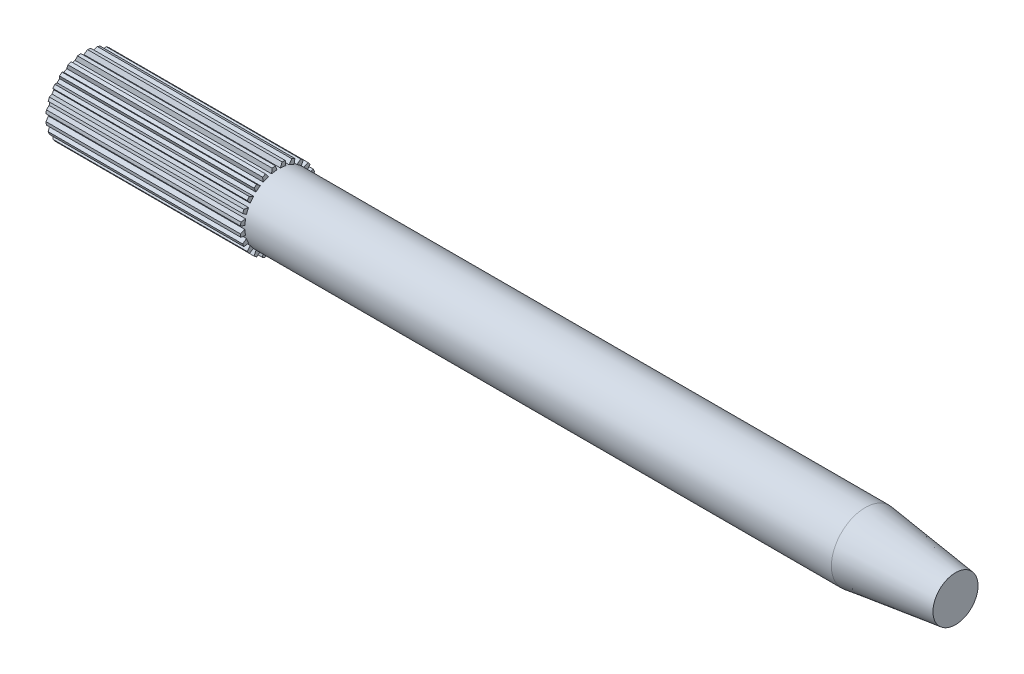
ISO-10303-21;
HEADER;
FILE_DESCRIPTION(('STEP AP214'),'2;1');
FILE_NAME('part.step','',(''),(''),'','','');
FILE_SCHEMA(('AUTOMOTIVE_DESIGN { 1 0 10303 214 1 1 1 1 }'));
ENDSEC;
DATA;
#1=APPLICATION_CONTEXT('core data for automotive mechanical design processes');
#2=APPLICATION_PROTOCOL_DEFINITION('international standard','automotive_design',2000,#1);
#3=PRODUCT_CONTEXT('',#1,'mechanical');
#4=PRODUCT('Part','Part','',(#3));
#5=PRODUCT_RELATED_PRODUCT_CATEGORY('part','',(#4));
#6=PRODUCT_DEFINITION_FORMATION('','',#4);
#7=PRODUCT_DEFINITION_CONTEXT('part definition',#1,'design');
#8=PRODUCT_DEFINITION('design','',#6,#7);
#9=PRODUCT_DEFINITION_SHAPE('','',#8);
#10=(LENGTH_UNIT() NAMED_UNIT(*) SI_UNIT(.MILLI.,.METRE.));
#11=(NAMED_UNIT(*) PLANE_ANGLE_UNIT() SI_UNIT($,.RADIAN.));
#12=(NAMED_UNIT(*) SI_UNIT($,.STERADIAN.) SOLID_ANGLE_UNIT());
#13=UNCERTAINTY_MEASURE_WITH_UNIT(LENGTH_MEASURE(1.E-05),#10,'distance_accuracy_value','');
#14=(GEOMETRIC_REPRESENTATION_CONTEXT(3) GLOBAL_UNCERTAINTY_ASSIGNED_CONTEXT((#13)) GLOBAL_UNIT_ASSIGNED_CONTEXT((#10,
#11,#12)) REPRESENTATION_CONTEXT('',''));
#15=CARTESIAN_POINT('',(0.,0.,0.));
#16=DIRECTION('',(0.,0.,1.));
#17=DIRECTION('',(1.,0.,0.));
#18=AXIS2_PLACEMENT_3D('',#15,#16,#17);
#19=CARTESIAN_POINT('',(9.00000000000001,1.7,0.));
#20=DIRECTION('',(-1.,0.,0.));
#21=DIRECTION('',(0.,0.,1.));
#22=AXIS2_PLACEMENT_3D('',#19,#20,#21);
#23=PLANE('',#22);
#24=CARTESIAN_POINT('',(9.00000000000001,0.,0.));
#25=DIRECTION('',(-1.,0.,0.));
#26=DIRECTION('',(0.,0.,1.));
#27=AXIS2_PLACEMENT_3D('',#24,#25,#26);
#28=CIRCLE('',#27,1.7);
#29=CARTESIAN_POINT('',(9.00000000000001,1.67449211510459,0.293387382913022));
#30=VERTEX_POINT('',#29);
#31=CARTESIAN_POINT('',(9.00000000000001,1.69336942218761,0.15));
#32=VERTEX_POINT('',#31);
#33=EDGE_CURVE('E656',#30,#32,#28,.T.);
#34=ORIENTED_EDGE('',*,*,#33,.F.);
#35=DIRECTION('',(0.,0.994497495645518,-0.104760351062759));
#36=VECTOR('',#35,1.);
#37=CARTESIAN_POINT('',(9.00000000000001,1.67449211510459,0.293387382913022));
#38=LINE('',#37,#36);
#39=CARTESIAN_POINT('',(9.00000000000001,1.46648792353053,0.315298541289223));
#40=VERTEX_POINT('',#39);
#41=EDGE_CURVE('E641',#40,#30,#38,.T.);
#42=ORIENTED_EDGE('',*,*,#41,.F.);
#43=CARTESIAN_POINT('',(9.00000000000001,0.,0.));
#44=DIRECTION('',(-1.,0.,0.));
#45=DIRECTION('',(0.,0.,1.));
#46=AXIS2_PLACEMENT_3D('',#43,#44,#45);
#47=CIRCLE('',#46,1.5);
#48=CARTESIAN_POINT('',(9.00000000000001,1.49812382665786,0.075));
#49=VERTEX_POINT('',#48);
#50=EDGE_CURVE('E665',#40,#49,#47,.T.);
#51=ORIENTED_EDGE('',*,*,#50,.T.);
#52=DIRECTION('',(0.,-0.933496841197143,-0.358585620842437));
#53=VECTOR('',#52,1.);
#54=CARTESIAN_POINT('',(9.00000000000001,1.69336942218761,0.15));
#55=LINE('',#54,#53);
#56=EDGE_CURVE('E1194',#32,#49,#55,.T.);
#57=ORIENTED_EDGE('',*,*,#56,.F.);
#58=EDGE_LOOP('',(#34,#42,#51,#57));
#59=FACE_BOUND('',#58,.T.);
#60=ADVANCED_FACE('F39',(#59),#23,.F.);
#61=CARTESIAN_POINT('',(-5.,0.,0.));
#62=DIRECTION('',(-1.,0.,0.));
#63=DIRECTION('',(0.,0.,1.));
#64=AXIS2_PLACEMENT_3D('',#61,#62,#63);
#65=CYLINDRICAL_SURFACE('',#64,1.7);
#66=CARTESIAN_POINT('',(0.379226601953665,0.,0.));
#67=DIRECTION('',(-1.,0.,0.));
#68=DIRECTION('',(0.,0.,1.));
#69=AXIS2_PLACEMENT_3D('',#66,#67,#68);
#70=CIRCLE('',#69,1.7);
#71=CARTESIAN_POINT('',(0.379226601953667,1.67449211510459,0.293387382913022));
#72=VERTEX_POINT('',#71);
#73=CARTESIAN_POINT('',(0.379226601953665,1.69336942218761,0.15));
#74=VERTEX_POINT('',#73);
#75=EDGE_CURVE('E1211',#72,#74,#70,.T.);
#76=ORIENTED_EDGE('',*,*,#75,.F.);
#77=DIRECTION('',(1.,0.,0.));
#78=VECTOR('',#77,1.);
#79=CARTESIAN_POINT('',(-0.999999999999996,1.67449211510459,0.293387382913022));
#80=LINE('',#79,#78);
#81=EDGE_CURVE('E1292',#72,#30,#80,.T.);
#82=ORIENTED_EDGE('',*,*,#81,.T.);
#83=ORIENTED_EDGE('',*,*,#33,.T.);
#84=DIRECTION('',(-1.,0.,0.));
#85=VECTOR('',#84,1.);
#86=CARTESIAN_POINT('',(-5.,1.69336942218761,0.15));
#87=LINE('',#86,#85);
#88=EDGE_CURVE('E678',#32,#74,#87,.T.);
#89=ORIENTED_EDGE('',*,*,#88,.T.);
#90=EDGE_LOOP('',(#76,#82,#83,#89));
#91=FACE_BOUND('',#90,.T.);
#92=ADVANCED_FACE('F1307',(#91),#65,.T.);
#93=CARTESIAN_POINT('',(9.00000000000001,1.33491329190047,0.684110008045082));
#94=VERTEX_POINT('',#93);
#95=CARTESIAN_POINT('',(9.00000000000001,1.42766506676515,0.460187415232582));
#96=VERTEX_POINT('',#95);
#97=EDGE_CURVE('E650',#94,#96,#47,.T.);
#98=ORIENTED_EDGE('',*,*,#97,.T.);
#99=DIRECTION('',(0.,-0.808879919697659,-0.587973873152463));
#100=VECTOR('',#99,1.);
#101=CARTESIAN_POINT('',(9.00000000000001,1.59684640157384,0.583165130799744));
#102=LINE('',#101,#100);
#103=CARTESIAN_POINT('',(9.00000000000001,1.59684640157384,0.583165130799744));
#104=VERTEX_POINT('',#103);
#105=EDGE_CURVE('E54',#104,#96,#102,.T.);
#106=ORIENTED_EDGE('',*,*,#105,.F.);
#107=CARTESIAN_POINT('',(9.00000000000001,1.54150093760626,0.71678090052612));
#108=VERTEX_POINT('',#107);
#109=EDGE_CURVE('E648',#108,#104,#28,.T.);
#110=ORIENTED_EDGE('',*,*,#109,.F.);
#111=DIRECTION('',(0.,0.987724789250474,0.156204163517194));
#112=VECTOR('',#111,1.);
#113=CARTESIAN_POINT('',(9.00000000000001,1.54150093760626,0.71678090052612));
#114=LINE('',#113,#112);
#115=EDGE_CURVE('E770',#94,#108,#114,.T.);
#116=ORIENTED_EDGE('',*,*,#115,.F.);
#117=EDGE_LOOP('',(#98,#106,#110,#116));
#118=FACE_BOUND('',#117,.T.);
#119=ADVANCED_FACE('F646',(#118),#23,.F.);
#120=ORIENTED_EDGE('',*,*,#109,.T.);
#121=DIRECTION('',(1.,0.,0.));
#122=VECTOR('',#121,1.);
#123=CARTESIAN_POINT('',(-0.999999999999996,1.59684640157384,0.583165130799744));
#124=LINE('',#123,#122);
#125=CARTESIAN_POINT('',(0.379226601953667,1.59684640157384,0.583165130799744));
#126=VERTEX_POINT('',#125);
#127=EDGE_CURVE('E632',#126,#104,#124,.T.);
#128=ORIENTED_EDGE('',*,*,#127,.F.);
#129=CARTESIAN_POINT('',(0.379226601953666,1.54150093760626,0.71678090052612));
#130=VERTEX_POINT('',#129);
#131=EDGE_CURVE('E1212',#130,#126,#70,.T.);
#132=ORIENTED_EDGE('',*,*,#131,.F.);
#133=DIRECTION('',(1.,0.,0.));
#134=VECTOR('',#133,1.);
#135=CARTESIAN_POINT('',(-0.999999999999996,1.54150093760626,0.71678090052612));
#136=LINE('',#135,#134);
#137=EDGE_CURVE('E654',#130,#108,#136,.T.);
#138=ORIENTED_EDGE('',*,*,#137,.T.);
#139=EDGE_LOOP('',(#120,#128,#132,#138));
#140=FACE_BOUND('',#139,.T.);
#141=ADVANCED_FACE('F653',(#140),#65,.T.);
#142=CARTESIAN_POINT('',(9.00000000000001,1.11236652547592,1.00630050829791));
#143=VERTEX_POINT('',#142);
#144=CARTESIAN_POINT('',(9.00000000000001,1.25991329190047,0.814013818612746));
#145=VERTEX_POINT('',#144);
#146=EDGE_CURVE('E1286',#143,#145,#47,.T.);
#147=ORIENTED_EDGE('',*,*,#146,.T.);
#148=DIRECTION('',(0.,-0.629139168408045,-0.777292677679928));
#149=VECTOR('',#148,1.);
#150=CARTESIAN_POINT('',(9.00000000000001,1.39150093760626,0.976588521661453));
#151=LINE('',#150,#149);
#152=CARTESIAN_POINT('',(9.00000000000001,1.39150093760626,0.976588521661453));
#153=VERTEX_POINT('',#152);
#154=EDGE_CURVE('E62',#153,#145,#151,.T.);
#155=ORIENTED_EDGE('',*,*,#154,.F.);
#156=CARTESIAN_POINT('',(9.00000000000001,1.3034590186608,1.09132698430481));
#157=VERTEX_POINT('',#156);
#158=EDGE_CURVE('E655',#157,#153,#28,.T.);
#159=ORIENTED_EDGE('',*,*,#158,.F.);
#160=DIRECTION('',(0.,0.913640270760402,0.406523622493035));
#161=VECTOR('',#160,1.);
#162=CARTESIAN_POINT('',(9.00000000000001,1.3034590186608,1.09132698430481));
#163=LINE('',#162,#161);
#164=EDGE_CURVE('E778',#143,#157,#163,.T.);
#165=ORIENTED_EDGE('',*,*,#164,.F.);
#166=EDGE_LOOP('',(#147,#155,#159,#165));
#167=FACE_BOUND('',#166,.T.);
#168=ADVANCED_FACE('F1284',(#167),#23,.F.);
#169=ORIENTED_EDGE('',*,*,#158,.T.);
#170=DIRECTION('',(1.,0.,0.));
#171=VECTOR('',#170,1.);
#172=CARTESIAN_POINT('',(-0.999999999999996,1.39150093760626,0.976588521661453));
#173=LINE('',#172,#171);
#174=CARTESIAN_POINT('',(0.379226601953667,1.39150093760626,0.976588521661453));
#175=VERTEX_POINT('',#174);
#176=EDGE_CURVE('E767',#175,#153,#173,.T.);
#177=ORIENTED_EDGE('',*,*,#176,.F.);
#178=CARTESIAN_POINT('',(0.379226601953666,1.3034590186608,1.09132698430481));
#179=VERTEX_POINT('',#178);
#180=EDGE_CURVE('E1216',#179,#175,#70,.T.);
#181=ORIENTED_EDGE('',*,*,#180,.F.);
#182=DIRECTION('',(1.,0.,0.));
#183=VECTOR('',#182,1.);
#184=CARTESIAN_POINT('',(-0.999999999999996,1.3034590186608,1.09132698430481));
#185=LINE('',#184,#183);
#186=EDGE_CURVE('E781',#179,#157,#185,.T.);
#187=ORIENTED_EDGE('',*,*,#186,.T.);
#188=EDGE_LOOP('',(#169,#177,#181,#187));
#189=FACE_BOUND('',#188,.T.);
#190=ADVANCED_FACE('F1281',(#189),#65,.T.);
#191=CARTESIAN_POINT('',(9.00000000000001,0.814013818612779,1.25991329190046));
#192=VERTEX_POINT('',#191);
#193=CARTESIAN_POINT('',(9.00000000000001,1.00630050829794,1.11236652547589));
#194=VERTEX_POINT('',#193);
#195=EDGE_CURVE('E1440',#192,#194,#47,.T.);
#196=ORIENTED_EDGE('',*,*,#195,.T.);
#197=DIRECTION('',(0.,-0.406523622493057,-0.913640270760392));
#198=VECTOR('',#197,1.);
#199=CARTESIAN_POINT('',(9.00000000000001,1.09132698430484,1.30345901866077));
#200=LINE('',#199,#198);
#201=CARTESIAN_POINT('',(9.00000000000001,1.09132698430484,1.30345901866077));
#202=VERTEX_POINT('',#201);
#203=EDGE_CURVE('E776',#202,#194,#200,.T.);
#204=ORIENTED_EDGE('',*,*,#203,.F.);
#205=CARTESIAN_POINT('',(9.00000000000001,0.976588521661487,1.39150093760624));
#206=VERTEX_POINT('',#205);
#207=EDGE_CURVE('E659',#206,#202,#28,.T.);
#208=ORIENTED_EDGE('',*,*,#207,.F.);
#209=DIRECTION('',(0.,0.777292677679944,0.629139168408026));
#210=VECTOR('',#209,1.);
#211=CARTESIAN_POINT('',(9.00000000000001,0.976588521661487,1.39150093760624));
#212=LINE('',#211,#210);
#213=EDGE_CURVE('E798',#192,#206,#212,.T.);
#214=ORIENTED_EDGE('',*,*,#213,.F.);
#215=EDGE_LOOP('',(#196,#204,#208,#214));
#216=FACE_BOUND('',#215,.T.);
#217=ADVANCED_FACE('F1438',(#216),#23,.F.);
#218=ORIENTED_EDGE('',*,*,#207,.T.);
#219=DIRECTION('',(1.,0.,0.));
#220=VECTOR('',#219,1.);
#221=CARTESIAN_POINT('',(-0.999999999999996,1.09132698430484,1.30345901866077));
#222=LINE('',#221,#220);
#223=CARTESIAN_POINT('',(0.379226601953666,1.09132698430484,1.30345901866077));
#224=VERTEX_POINT('',#223);
#225=EDGE_CURVE('E780',#224,#202,#222,.T.);
#226=ORIENTED_EDGE('',*,*,#225,.F.);
#227=CARTESIAN_POINT('',(0.379226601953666,0.976588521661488,1.39150093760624));
#228=VERTEX_POINT('',#227);
#229=EDGE_CURVE('E1275',#228,#224,#70,.T.);
#230=ORIENTED_EDGE('',*,*,#229,.F.);
#231=DIRECTION('',(1.,0.,0.));
#232=VECTOR('',#231,1.);
#233=CARTESIAN_POINT('',(-0.999999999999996,0.976588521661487,1.39150093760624));
#234=LINE('',#233,#232);
#235=EDGE_CURVE('E801',#228,#206,#234,.T.);
#236=ORIENTED_EDGE('',*,*,#235,.T.);
#237=EDGE_LOOP('',(#218,#226,#230,#236));
#238=FACE_BOUND('',#237,.T.);
#239=ADVANCED_FACE('F1433',(#238),#65,.T.);
#240=CARTESIAN_POINT('',(9.00000000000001,0.460187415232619,1.42766506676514));
#241=VERTEX_POINT('',#240);
#242=CARTESIAN_POINT('',(9.00000000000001,0.684110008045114,1.33491329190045));
#243=VERTEX_POINT('',#242);
#244=EDGE_CURVE('E1796',#241,#243,#47,.T.);
#245=ORIENTED_EDGE('',*,*,#244,.T.);
#246=DIRECTION('',(0.,-0.156204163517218,-0.987724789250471));
#247=VECTOR('',#246,1.);
#248=CARTESIAN_POINT('',(9.00000000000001,0.716780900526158,1.54150093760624));
#249=LINE('',#248,#247);
#250=CARTESIAN_POINT('',(9.00000000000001,0.716780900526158,1.54150093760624));
#251=VERTEX_POINT('',#250);
#252=EDGE_CURVE('E796',#251,#243,#249,.T.);
#253=ORIENTED_EDGE('',*,*,#252,.F.);
#254=CARTESIAN_POINT('',(9.00000000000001,0.583165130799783,1.59684640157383));
#255=VERTEX_POINT('',#254);
#256=EDGE_CURVE('E1421',#255,#251,#28,.T.);
#257=ORIENTED_EDGE('',*,*,#256,.F.);
#258=DIRECTION('',(0.,0.587973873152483,0.808879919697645));
#259=VECTOR('',#258,1.);
#260=CARTESIAN_POINT('',(9.00000000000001,0.583165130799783,1.59684640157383));
#261=LINE('',#260,#259);
#262=EDGE_CURVE('E818',#241,#255,#261,.T.);
#263=ORIENTED_EDGE('',*,*,#262,.F.);
#264=EDGE_LOOP('',(#245,#253,#257,#263));
#265=FACE_BOUND('',#264,.T.);
#266=ADVANCED_FACE('F1614',(#265),#23,.F.);
#267=ORIENTED_EDGE('',*,*,#256,.T.);
#268=DIRECTION('',(1.,0.,0.));
#269=VECTOR('',#268,1.);
#270=CARTESIAN_POINT('',(-0.999999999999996,0.716780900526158,1.54150093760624));
#271=LINE('',#270,#269);
#272=CARTESIAN_POINT('',(0.379226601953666,0.716780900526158,1.54150093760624));
#273=VERTEX_POINT('',#272);
#274=EDGE_CURVE('E800',#273,#251,#271,.T.);
#275=ORIENTED_EDGE('',*,*,#274,.F.);
#276=CARTESIAN_POINT('',(0.379226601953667,0.583165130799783,1.59684640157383));
#277=VERTEX_POINT('',#276);
#278=EDGE_CURVE('E1272',#277,#273,#70,.T.);
#279=ORIENTED_EDGE('',*,*,#278,.F.);
#280=DIRECTION('',(1.,0.,0.));
#281=VECTOR('',#280,1.);
#282=CARTESIAN_POINT('',(-0.999999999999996,0.583165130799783,1.59684640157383));
#283=LINE('',#282,#281);
#284=EDGE_CURVE('E821',#277,#255,#283,.T.);
#285=ORIENTED_EDGE('',*,*,#284,.T.);
#286=EDGE_LOOP('',(#267,#275,#279,#285));
#287=FACE_BOUND('',#286,.T.);
#288=ADVANCED_FACE('F1610',(#287),#65,.T.);
#289=CARTESIAN_POINT('',(9.00000000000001,0.0750000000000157,1.49812382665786));
#290=VERTEX_POINT('',#289);
#291=CARTESIAN_POINT('',(9.00000000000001,0.315298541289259,1.46648792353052));
#292=VERTEX_POINT('',#291);
#293=EDGE_CURVE('E1798',#290,#292,#47,.T.);
#294=ORIENTED_EDGE('',*,*,#293,.T.);
#295=DIRECTION('',(0.,0.104760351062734,-0.994497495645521));
#296=VECTOR('',#295,1.);
#297=CARTESIAN_POINT('',(9.00000000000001,0.293387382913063,1.67449211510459));
#298=LINE('',#297,#296);
#299=CARTESIAN_POINT('',(9.00000000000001,0.293387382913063,1.67449211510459));
#300=VERTEX_POINT('',#299);
#301=EDGE_CURVE('E816',#300,#292,#298,.T.);
#302=ORIENTED_EDGE('',*,*,#301,.F.);
#303=CARTESIAN_POINT('',(9.00000000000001,0.150000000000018,1.69336942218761));
#304=VERTEX_POINT('',#303);
#305=EDGE_CURVE('E1416',#304,#300,#28,.T.);
#306=ORIENTED_EDGE('',*,*,#305,.F.);
#307=DIRECTION('',(0.,0.358585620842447,0.933496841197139));
#308=VECTOR('',#307,1.);
#309=CARTESIAN_POINT('',(9.00000000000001,0.150000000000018,1.69336942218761));
#310=LINE('',#309,#308);
#311=EDGE_CURVE('E838',#290,#304,#310,.T.);
#312=ORIENTED_EDGE('',*,*,#311,.F.);
#313=EDGE_LOOP('',(#294,#302,#306,#312));
#314=FACE_BOUND('',#313,.T.);
#315=ADVANCED_FACE('F1606',(#314),#23,.F.);
#316=ORIENTED_EDGE('',*,*,#305,.T.);
#317=DIRECTION('',(1.,0.,0.));
#318=VECTOR('',#317,1.);
#319=CARTESIAN_POINT('',(-0.999999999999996,0.293387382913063,1.67449211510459));
#320=LINE('',#319,#318);
#321=CARTESIAN_POINT('',(0.379226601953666,0.293387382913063,1.67449211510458));
#322=VERTEX_POINT('',#321);
#323=EDGE_CURVE('E820',#322,#300,#320,.T.);
#324=ORIENTED_EDGE('',*,*,#323,.F.);
#325=CARTESIAN_POINT('',(0.379226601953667,0.150000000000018,1.69336942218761));
#326=VERTEX_POINT('',#325);
#327=EDGE_CURVE('E1269',#326,#322,#70,.T.);
#328=ORIENTED_EDGE('',*,*,#327,.F.);
#329=DIRECTION('',(1.,0.,0.));
#330=VECTOR('',#329,1.);
#331=CARTESIAN_POINT('',(-0.999999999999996,0.150000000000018,1.69336942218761));
#332=LINE('',#331,#330);
#333=EDGE_CURVE('E841',#326,#304,#332,.T.);
#334=ORIENTED_EDGE('',*,*,#333,.T.);
#335=EDGE_LOOP('',(#316,#324,#328,#334));
#336=FACE_BOUND('',#335,.T.);
#337=ADVANCED_FACE('F1602',(#336),#65,.T.);
#338=CARTESIAN_POINT('',(9.00000000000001,-0.315298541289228,1.46648792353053));
#339=VERTEX_POINT('',#338);
#340=CARTESIAN_POINT('',(9.00000000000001,-0.0749999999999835,1.49812382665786));
#341=VERTEX_POINT('',#340);
#342=EDGE_CURVE('E1799',#339,#341,#47,.T.);
#343=ORIENTED_EDGE('',*,*,#342,.T.);
#344=DIRECTION('',(0.,0.358585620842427,-0.933496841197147));
#345=VECTOR('',#344,1.);
#346=CARTESIAN_POINT('',(9.00000000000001,-0.149999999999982,1.69336942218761));
#347=LINE('',#346,#345);
#348=CARTESIAN_POINT('',(9.00000000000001,-0.149999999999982,1.69336942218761));
#349=VERTEX_POINT('',#348);
#350=EDGE_CURVE('E836',#349,#341,#347,.T.);
#351=ORIENTED_EDGE('',*,*,#350,.F.);
#352=CARTESIAN_POINT('',(9.00000000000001,-0.293387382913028,1.67449211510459));
#353=VERTEX_POINT('',#352);
#354=EDGE_CURVE('E1411',#353,#349,#28,.T.);
#355=ORIENTED_EDGE('',*,*,#354,.F.);
#356=DIRECTION('',(0.,0.104760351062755,0.994497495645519));
#357=VECTOR('',#356,1.);
#358=CARTESIAN_POINT('',(9.00000000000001,-0.293387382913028,1.67449211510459));
#359=LINE('',#358,#357);
#360=EDGE_CURVE('E858',#339,#353,#359,.T.);
#361=ORIENTED_EDGE('',*,*,#360,.F.);
#362=EDGE_LOOP('',(#343,#351,#355,#361));
#363=FACE_BOUND('',#362,.T.);
#364=ADVANCED_FACE('F1598',(#363),#23,.F.);
#365=ORIENTED_EDGE('',*,*,#354,.T.);
#366=DIRECTION('',(1.,0.,0.));
#367=VECTOR('',#366,1.);
#368=CARTESIAN_POINT('',(-0.999999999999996,-0.149999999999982,1.69336942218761));
#369=LINE('',#368,#367);
#370=CARTESIAN_POINT('',(0.379226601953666,-0.149999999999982,1.69336942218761));
#371=VERTEX_POINT('',#370);
#372=EDGE_CURVE('E840',#371,#349,#369,.T.);
#373=ORIENTED_EDGE('',*,*,#372,.F.);
#374=CARTESIAN_POINT('',(0.379226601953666,-0.293387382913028,1.67449211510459));
#375=VERTEX_POINT('',#374);
#376=EDGE_CURVE('E1266',#375,#371,#70,.T.);
#377=ORIENTED_EDGE('',*,*,#376,.F.);
#378=DIRECTION('',(1.,0.,0.));
#379=VECTOR('',#378,1.);
#380=CARTESIAN_POINT('',(-0.999999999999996,-0.293387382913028,1.67449211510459));
#381=LINE('',#380,#379);
#382=EDGE_CURVE('E861',#375,#353,#381,.T.);
#383=ORIENTED_EDGE('',*,*,#382,.T.);
#384=EDGE_LOOP('',(#365,#373,#377,#383));
#385=FACE_BOUND('',#384,.T.);
#386=ADVANCED_FACE('F1594',(#385),#65,.T.);
#387=CARTESIAN_POINT('',(9.00000000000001,-0.684110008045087,1.33491329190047));
#388=VERTEX_POINT('',#387);
#389=CARTESIAN_POINT('',(9.00000000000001,-0.460187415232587,1.42766506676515));
#390=VERTEX_POINT('',#389);
#391=EDGE_CURVE('E1803',#388,#390,#47,.T.);
#392=ORIENTED_EDGE('',*,*,#391,.T.);
#393=DIRECTION('',(0.,0.587973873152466,-0.808879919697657));
#394=VECTOR('',#393,1.);
#395=CARTESIAN_POINT('',(9.00000000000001,-0.583165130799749,1.59684640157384));
#396=LINE('',#395,#394);
#397=CARTESIAN_POINT('',(9.00000000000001,-0.583165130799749,1.59684640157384));
#398=VERTEX_POINT('',#397);
#399=EDGE_CURVE('E856',#398,#390,#396,.T.);
#400=ORIENTED_EDGE('',*,*,#399,.F.);
#401=CARTESIAN_POINT('',(9.00000000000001,-0.716780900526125,1.54150093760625));
#402=VERTEX_POINT('',#401);
#403=EDGE_CURVE('E1406',#402,#398,#28,.T.);
#404=ORIENTED_EDGE('',*,*,#403,.F.);
#405=DIRECTION('',(0.,-0.156204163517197,0.987724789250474));
#406=VECTOR('',#405,1.);
#407=CARTESIAN_POINT('',(9.00000000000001,-0.716780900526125,1.54150093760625));
#408=LINE('',#407,#406);
#409=EDGE_CURVE('E878',#388,#402,#408,.T.);
#410=ORIENTED_EDGE('',*,*,#409,.F.);
#411=EDGE_LOOP('',(#392,#400,#404,#410));
#412=FACE_BOUND('',#411,.T.);
#413=ADVANCED_FACE('F1590',(#412),#23,.F.);
#414=ORIENTED_EDGE('',*,*,#403,.T.);
#415=DIRECTION('',(1.,0.,0.));
#416=VECTOR('',#415,1.);
#417=CARTESIAN_POINT('',(-0.999999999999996,-0.583165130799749,1.59684640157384));
#418=LINE('',#417,#416);
#419=CARTESIAN_POINT('',(0.379226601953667,-0.583165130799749,1.59684640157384));
#420=VERTEX_POINT('',#419);
#421=EDGE_CURVE('E860',#420,#398,#418,.T.);
#422=ORIENTED_EDGE('',*,*,#421,.F.);
#423=CARTESIAN_POINT('',(0.379226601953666,-0.716780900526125,1.54150093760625));
#424=VERTEX_POINT('',#423);
#425=EDGE_CURVE('E1263',#424,#420,#70,.T.);
#426=ORIENTED_EDGE('',*,*,#425,.F.);
#427=DIRECTION('',(1.,0.,0.));
#428=VECTOR('',#427,1.);
#429=CARTESIAN_POINT('',(-0.999999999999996,-0.716780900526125,1.54150093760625));
#430=LINE('',#429,#428);
#431=EDGE_CURVE('E881',#424,#402,#430,.T.);
#432=ORIENTED_EDGE('',*,*,#431,.T.);
#433=EDGE_LOOP('',(#414,#422,#426,#432));
#434=FACE_BOUND('',#433,.T.);
#435=ADVANCED_FACE('F1586',(#434),#65,.T.);
#436=CARTESIAN_POINT('',(9.00000000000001,-1.00630050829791,1.11236652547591));
#437=VERTEX_POINT('',#436);
#438=CARTESIAN_POINT('',(9.00000000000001,-0.814013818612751,1.25991329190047));
#439=VERTEX_POINT('',#438);
#440=EDGE_CURVE('E1807',#437,#439,#47,.T.);
#441=ORIENTED_EDGE('',*,*,#440,.T.);
#442=DIRECTION('',(0.,0.777292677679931,-0.629139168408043));
#443=VECTOR('',#442,1.);
#444=CARTESIAN_POINT('',(9.00000000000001,-0.976588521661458,1.39150093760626));
#445=LINE('',#444,#443);
#446=CARTESIAN_POINT('',(9.00000000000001,-0.976588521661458,1.39150093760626));
#447=VERTEX_POINT('',#446);
#448=EDGE_CURVE('E876',#447,#439,#445,.T.);
#449=ORIENTED_EDGE('',*,*,#448,.F.);
#450=CARTESIAN_POINT('',(9.00000000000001,-1.09132698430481,1.3034590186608));
#451=VERTEX_POINT('',#450);
#452=EDGE_CURVE('E1401',#451,#447,#28,.T.);
#453=ORIENTED_EDGE('',*,*,#452,.F.);
#454=DIRECTION('',(0.,-0.406523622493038,0.913640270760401));
#455=VECTOR('',#454,1.);
#456=CARTESIAN_POINT('',(9.00000000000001,-1.09132698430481,1.3034590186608));
#457=LINE('',#456,#455);
#458=EDGE_CURVE('E898',#437,#451,#457,.T.);
#459=ORIENTED_EDGE('',*,*,#458,.F.);
#460=EDGE_LOOP('',(#441,#449,#453,#459));
#461=FACE_BOUND('',#460,.T.);
#462=ADVANCED_FACE('F1582',(#461),#23,.F.);
#463=ORIENTED_EDGE('',*,*,#452,.T.);
#464=DIRECTION('',(1.,0.,0.));
#465=VECTOR('',#464,1.);
#466=CARTESIAN_POINT('',(-0.999999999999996,-0.976588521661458,1.39150093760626));
#467=LINE('',#466,#465);
#468=CARTESIAN_POINT('',(0.379226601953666,-0.976588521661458,1.39150093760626));
#469=VERTEX_POINT('',#468);
#470=EDGE_CURVE('E880',#469,#447,#467,.T.);
#471=ORIENTED_EDGE('',*,*,#470,.F.);
#472=CARTESIAN_POINT('',(0.379226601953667,-1.09132698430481,1.3034590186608));
#473=VERTEX_POINT('',#472);
#474=EDGE_CURVE('E1260',#473,#469,#70,.T.);
#475=ORIENTED_EDGE('',*,*,#474,.F.);
#476=DIRECTION('',(1.,0.,0.));
#477=VECTOR('',#476,1.);
#478=CARTESIAN_POINT('',(-0.999999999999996,-1.09132698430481,1.3034590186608));
#479=LINE('',#478,#477);
#480=EDGE_CURVE('E901',#473,#451,#479,.T.);
#481=ORIENTED_EDGE('',*,*,#480,.T.);
#482=EDGE_LOOP('',(#463,#471,#475,#481));
#483=FACE_BOUND('',#482,.T.);
#484=ADVANCED_FACE('F1578',(#483),#65,.T.);
#485=CARTESIAN_POINT('',(9.00000000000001,-1.25991329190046,0.814013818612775));
#486=VERTEX_POINT('',#485);
#487=CARTESIAN_POINT('',(9.00000000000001,-1.11236652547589,1.00630050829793));
#488=VERTEX_POINT('',#487);
#489=EDGE_CURVE('E1811',#486,#488,#47,.T.);
#490=ORIENTED_EDGE('',*,*,#489,.T.);
#491=DIRECTION('',(0.,0.913640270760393,-0.406523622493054));
#492=VECTOR('',#491,1.);
#493=CARTESIAN_POINT('',(9.00000000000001,-1.30345901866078,1.09132698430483));
#494=LINE('',#493,#492);
#495=CARTESIAN_POINT('',(9.00000000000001,-1.30345901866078,1.09132698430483));
#496=VERTEX_POINT('',#495);
#497=EDGE_CURVE('E896',#496,#488,#494,.T.);
#498=ORIENTED_EDGE('',*,*,#497,.F.);
#499=CARTESIAN_POINT('',(9.00000000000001,-1.39150093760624,0.976588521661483));
#500=VERTEX_POINT('',#499);
#501=EDGE_CURVE('E1396',#500,#496,#28,.T.);
#502=ORIENTED_EDGE('',*,*,#501,.F.);
#503=DIRECTION('',(0.,-0.629139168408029,0.777292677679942));
#504=VECTOR('',#503,1.);
#505=CARTESIAN_POINT('',(9.00000000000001,-1.39150093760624,0.976588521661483));
#506=LINE('',#505,#504);
#507=EDGE_CURVE('E918',#486,#500,#506,.T.);
#508=ORIENTED_EDGE('',*,*,#507,.F.);
#509=EDGE_LOOP('',(#490,#498,#502,#508));
#510=FACE_BOUND('',#509,.T.);
#511=ADVANCED_FACE('F1574',(#510),#23,.F.);
#512=ORIENTED_EDGE('',*,*,#501,.T.);
#513=DIRECTION('',(1.,0.,0.));
#514=VECTOR('',#513,1.);
#515=CARTESIAN_POINT('',(-0.999999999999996,-1.30345901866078,1.09132698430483));
#516=LINE('',#515,#514);
#517=CARTESIAN_POINT('',(0.379226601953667,-1.30345901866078,1.09132698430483));
#518=VERTEX_POINT('',#517);
#519=EDGE_CURVE('E900',#518,#496,#516,.T.);
#520=ORIENTED_EDGE('',*,*,#519,.F.);
#521=CARTESIAN_POINT('',(0.379226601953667,-1.39150093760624,0.976588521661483));
#522=VERTEX_POINT('',#521);
#523=EDGE_CURVE('E1257',#522,#518,#70,.T.);
#524=ORIENTED_EDGE('',*,*,#523,.F.);
#525=DIRECTION('',(1.,0.,0.));
#526=VECTOR('',#525,1.);
#527=CARTESIAN_POINT('',(-0.999999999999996,-1.39150093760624,0.976588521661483));
#528=LINE('',#527,#526);
#529=EDGE_CURVE('E921',#522,#500,#528,.T.);
#530=ORIENTED_EDGE('',*,*,#529,.T.);
#531=EDGE_LOOP('',(#512,#520,#524,#530));
#532=FACE_BOUND('',#531,.T.);
#533=ADVANCED_FACE('F1570',(#532),#65,.T.);
#534=CARTESIAN_POINT('',(9.00000000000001,-1.42766506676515,0.460187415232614));
#535=VERTEX_POINT('',#534);
#536=CARTESIAN_POINT('',(9.00000000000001,-1.33491329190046,0.684110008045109));
#537=VERTEX_POINT('',#536);
#538=EDGE_CURVE('E1815',#535,#537,#47,.T.);
#539=ORIENTED_EDGE('',*,*,#538,.T.);
#540=DIRECTION('',(0.,0.987724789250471,-0.156204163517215));
#541=VECTOR('',#540,1.);
#542=CARTESIAN_POINT('',(9.00000000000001,-1.54150093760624,0.716780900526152));
#543=LINE('',#542,#541);
#544=CARTESIAN_POINT('',(9.00000000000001,-1.54150093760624,0.716780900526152));
#545=VERTEX_POINT('',#544);
#546=EDGE_CURVE('E916',#545,#537,#543,.T.);
#547=ORIENTED_EDGE('',*,*,#546,.F.);
#548=CARTESIAN_POINT('',(9.00000000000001,-1.59684640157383,0.583165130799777));
#549=VERTEX_POINT('',#548);
#550=EDGE_CURVE('E1391',#549,#545,#28,.T.);
#551=ORIENTED_EDGE('',*,*,#550,.F.);
#552=DIRECTION('',(0.,-0.808879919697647,0.58797387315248));
#553=VECTOR('',#552,1.);
#554=CARTESIAN_POINT('',(9.00000000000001,-1.59684640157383,0.583165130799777));
#555=LINE('',#554,#553);
#556=EDGE_CURVE('E938',#535,#549,#555,.T.);
#557=ORIENTED_EDGE('',*,*,#556,.F.);
#558=EDGE_LOOP('',(#539,#547,#551,#557));
#559=FACE_BOUND('',#558,.T.);
#560=ADVANCED_FACE('F1566',(#559),#23,.F.);
#561=ORIENTED_EDGE('',*,*,#550,.T.);
#562=DIRECTION('',(1.,0.,0.));
#563=VECTOR('',#562,1.);
#564=CARTESIAN_POINT('',(-0.999999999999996,-1.54150093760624,0.716780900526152));
#565=LINE('',#564,#563);
#566=CARTESIAN_POINT('',(0.379226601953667,-1.54150093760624,0.716780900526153));
#567=VERTEX_POINT('',#566);
#568=EDGE_CURVE('E920',#567,#545,#565,.T.);
#569=ORIENTED_EDGE('',*,*,#568,.F.);
#570=CARTESIAN_POINT('',(0.379226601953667,-1.59684640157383,0.583165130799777));
#571=VERTEX_POINT('',#570);
#572=EDGE_CURVE('E1254',#571,#567,#70,.T.);
#573=ORIENTED_EDGE('',*,*,#572,.F.);
#574=DIRECTION('',(1.,0.,0.));
#575=VECTOR('',#574,1.);
#576=CARTESIAN_POINT('',(-0.999999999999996,-1.59684640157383,0.583165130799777));
#577=LINE('',#576,#575);
#578=EDGE_CURVE('E941',#571,#549,#577,.T.);
#579=ORIENTED_EDGE('',*,*,#578,.T.);
#580=EDGE_LOOP('',(#561,#569,#573,#579));
#581=FACE_BOUND('',#580,.T.);
#582=ADVANCED_FACE('F1562',(#581),#65,.T.);
#583=CARTESIAN_POINT('',(9.00000000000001,-1.49812382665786,0.0750000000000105));
#584=VERTEX_POINT('',#583);
#585=CARTESIAN_POINT('',(9.00000000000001,-1.46648792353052,0.315298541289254));
#586=VERTEX_POINT('',#585);
#587=EDGE_CURVE('E1819',#584,#586,#47,.T.);
#588=ORIENTED_EDGE('',*,*,#587,.T.);
#589=DIRECTION('',(0.,0.994497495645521,0.104760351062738));
#590=VECTOR('',#589,1.);
#591=CARTESIAN_POINT('',(9.00000000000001,-1.67449211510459,0.293387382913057));
#592=LINE('',#591,#590);
#593=CARTESIAN_POINT('',(9.00000000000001,-1.67449211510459,0.293387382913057));
#594=VERTEX_POINT('',#593);
#595=EDGE_CURVE('E936',#594,#586,#592,.T.);
#596=ORIENTED_EDGE('',*,*,#595,.F.);
#597=CARTESIAN_POINT('',(9.00000000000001,-1.69336942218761,0.150000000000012));
#598=VERTEX_POINT('',#597);
#599=EDGE_CURVE('E1386',#598,#594,#28,.T.);
#600=ORIENTED_EDGE('',*,*,#599,.F.);
#601=DIRECTION('',(0.,-0.933496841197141,0.358585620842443));
#602=VECTOR('',#601,1.);
#603=CARTESIAN_POINT('',(9.00000000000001,-1.69336942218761,0.150000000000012));
#604=LINE('',#603,#602);
#605=EDGE_CURVE('E958',#584,#598,#604,.T.);
#606=ORIENTED_EDGE('',*,*,#605,.F.);
#607=EDGE_LOOP('',(#588,#596,#600,#606));
#608=FACE_BOUND('',#607,.T.);
#609=ADVANCED_FACE('F1558',(#608),#23,.F.);
#610=ORIENTED_EDGE('',*,*,#599,.T.);
#611=DIRECTION('',(1.,0.,0.));
#612=VECTOR('',#611,1.);
#613=CARTESIAN_POINT('',(-0.999999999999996,-1.67449211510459,0.293387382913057));
#614=LINE('',#613,#612);
#615=CARTESIAN_POINT('',(0.379226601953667,-1.67449211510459,0.293387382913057));
#616=VERTEX_POINT('',#615);
#617=EDGE_CURVE('E940',#616,#594,#614,.T.);
#618=ORIENTED_EDGE('',*,*,#617,.F.);
#619=CARTESIAN_POINT('',(0.379226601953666,-1.69336942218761,0.150000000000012));
#620=VERTEX_POINT('',#619);
#621=EDGE_CURVE('E1251',#620,#616,#70,.T.);
#622=ORIENTED_EDGE('',*,*,#621,.F.);
#623=DIRECTION('',(1.,0.,0.));
#624=VECTOR('',#623,1.);
#625=CARTESIAN_POINT('',(-0.999999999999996,-1.69336942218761,0.150000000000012));
#626=LINE('',#625,#624);
#627=EDGE_CURVE('E961',#620,#598,#626,.T.);
#628=ORIENTED_EDGE('',*,*,#627,.T.);
#629=EDGE_LOOP('',(#610,#618,#622,#628));
#630=FACE_BOUND('',#629,.T.);
#631=ADVANCED_FACE('F1554',(#630),#65,.T.);
#632=CARTESIAN_POINT('',(9.00000000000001,-1.46648792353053,-0.315298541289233));
#633=VERTEX_POINT('',#632);
#634=CARTESIAN_POINT('',(9.00000000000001,-1.49812382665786,-0.0749999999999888));
#635=VERTEX_POINT('',#634);
#636=EDGE_CURVE('E1823',#633,#635,#47,.T.);
#637=ORIENTED_EDGE('',*,*,#636,.T.);
#638=DIRECTION('',(0.,0.933496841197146,0.35858562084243));
#639=VECTOR('',#638,1.);
#640=CARTESIAN_POINT('',(9.00000000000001,-1.69336942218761,-0.149999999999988));
#641=LINE('',#640,#639);
#642=CARTESIAN_POINT('',(9.00000000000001,-1.69336942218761,-0.149999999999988));
#643=VERTEX_POINT('',#642);
#644=EDGE_CURVE('E956',#643,#635,#641,.T.);
#645=ORIENTED_EDGE('',*,*,#644,.F.);
#646=CARTESIAN_POINT('',(9.00000000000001,-1.67449211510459,-0.293387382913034));
#647=VERTEX_POINT('',#646);
#648=EDGE_CURVE('E1381',#647,#643,#28,.T.);
#649=ORIENTED_EDGE('',*,*,#648,.F.);
#650=DIRECTION('',(0.,-0.994497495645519,0.104760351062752));
#651=VECTOR('',#650,1.);
#652=CARTESIAN_POINT('',(9.00000000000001,-1.67449211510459,-0.293387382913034));
#653=LINE('',#652,#651);
#654=EDGE_CURVE('E978',#633,#647,#653,.T.);
#655=ORIENTED_EDGE('',*,*,#654,.F.);
#656=EDGE_LOOP('',(#637,#645,#649,#655));
#657=FACE_BOUND('',#656,.T.);
#658=ADVANCED_FACE('F1550',(#657),#23,.F.);
#659=ORIENTED_EDGE('',*,*,#648,.T.);
#660=DIRECTION('',(1.,0.,0.));
#661=VECTOR('',#660,1.);
#662=CARTESIAN_POINT('',(-0.999999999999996,-1.69336942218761,-0.149999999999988));
#663=LINE('',#662,#661);
#664=CARTESIAN_POINT('',(0.379226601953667,-1.69336942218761,-0.149999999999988));
#665=VERTEX_POINT('',#664);
#666=EDGE_CURVE('E960',#665,#643,#663,.T.);
#667=ORIENTED_EDGE('',*,*,#666,.F.);
#668=CARTESIAN_POINT('',(0.379226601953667,-1.67449211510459,-0.293387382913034));
#669=VERTEX_POINT('',#668);
#670=EDGE_CURVE('E1248',#669,#665,#70,.T.);
#671=ORIENTED_EDGE('',*,*,#670,.F.);
#672=DIRECTION('',(1.,0.,0.));
#673=VECTOR('',#672,1.);
#674=CARTESIAN_POINT('',(-0.999999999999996,-1.67449211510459,-0.293387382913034));
#675=LINE('',#674,#673);
#676=EDGE_CURVE('E981',#669,#647,#675,.T.);
#677=ORIENTED_EDGE('',*,*,#676,.T.);
#678=EDGE_LOOP('',(#659,#667,#671,#677));
#679=FACE_BOUND('',#678,.T.);
#680=ADVANCED_FACE('F1546',(#679),#65,.T.);
#681=CARTESIAN_POINT('',(9.00000000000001,-1.33491329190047,-0.684110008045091));
#682=VERTEX_POINT('',#681);
#683=CARTESIAN_POINT('',(9.00000000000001,-1.42766506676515,-0.460187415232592));
#684=VERTEX_POINT('',#683);
#685=EDGE_CURVE('E1827',#682,#684,#47,.T.);
#686=ORIENTED_EDGE('',*,*,#685,.T.);
#687=DIRECTION('',(0.,0.808879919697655,0.587973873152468));
#688=VECTOR('',#687,1.);
#689=CARTESIAN_POINT('',(9.00000000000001,-1.59684640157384,-0.583165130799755));
#690=LINE('',#689,#688);
#691=CARTESIAN_POINT('',(9.00000000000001,-1.59684640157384,-0.583165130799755));
#692=VERTEX_POINT('',#691);
#693=EDGE_CURVE('E976',#692,#684,#690,.T.);
#694=ORIENTED_EDGE('',*,*,#693,.F.);
#695=CARTESIAN_POINT('',(9.00000000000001,-1.54150093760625,-0.716780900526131));
#696=VERTEX_POINT('',#695);
#697=EDGE_CURVE('E1376',#696,#692,#28,.T.);
#698=ORIENTED_EDGE('',*,*,#697,.F.);
#699=DIRECTION('',(0.,-0.987724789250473,-0.156204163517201));
#700=VECTOR('',#699,1.);
#701=CARTESIAN_POINT('',(9.00000000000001,-1.54150093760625,-0.716780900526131));
#702=LINE('',#701,#700);
#703=EDGE_CURVE('E998',#682,#696,#702,.T.);
#704=ORIENTED_EDGE('',*,*,#703,.F.);
#705=EDGE_LOOP('',(#686,#694,#698,#704));
#706=FACE_BOUND('',#705,.T.);
#707=ADVANCED_FACE('F1542',(#706),#23,.F.);
#708=ORIENTED_EDGE('',*,*,#697,.T.);
#709=DIRECTION('',(1.,0.,0.));
#710=VECTOR('',#709,1.);
#711=CARTESIAN_POINT('',(-0.999999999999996,-1.59684640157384,-0.583165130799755));
#712=LINE('',#711,#710);
#713=CARTESIAN_POINT('',(0.379226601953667,-1.59684640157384,-0.583165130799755));
#714=VERTEX_POINT('',#713);
#715=EDGE_CURVE('E980',#714,#692,#712,.T.);
#716=ORIENTED_EDGE('',*,*,#715,.F.);
#717=CARTESIAN_POINT('',(0.379226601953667,-1.54150093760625,-0.716780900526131));
#718=VERTEX_POINT('',#717);
#719=EDGE_CURVE('E1245',#718,#714,#70,.T.);
#720=ORIENTED_EDGE('',*,*,#719,.F.);
#721=DIRECTION('',(1.,0.,0.));
#722=VECTOR('',#721,1.);
#723=CARTESIAN_POINT('',(-0.999999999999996,-1.54150093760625,-0.716780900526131));
#724=LINE('',#723,#722);
#725=EDGE_CURVE('E1001',#718,#696,#724,.T.);
#726=ORIENTED_EDGE('',*,*,#725,.T.);
#727=EDGE_LOOP('',(#708,#716,#720,#726));
#728=FACE_BOUND('',#727,.T.);
#729=ADVANCED_FACE('F1538',(#728),#65,.T.);
#730=CARTESIAN_POINT('',(9.00000000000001,-1.11236652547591,-1.00630050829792));
#731=VERTEX_POINT('',#730);
#732=CARTESIAN_POINT('',(9.00000000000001,-1.25991329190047,-0.814013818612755));
#733=VERTEX_POINT('',#732);
#734=EDGE_CURVE('E1831',#731,#733,#47,.T.);
#735=ORIENTED_EDGE('',*,*,#734,.T.);
#736=DIRECTION('',(0.,0.62913916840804,0.777292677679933));
#737=VECTOR('',#736,1.);
#738=CARTESIAN_POINT('',(9.00000000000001,-1.39150093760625,-0.976588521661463));
#739=LINE('',#738,#737);
#740=CARTESIAN_POINT('',(9.00000000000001,-1.39150093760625,-0.976588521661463));
#741=VERTEX_POINT('',#740);
#742=EDGE_CURVE('E996',#741,#733,#739,.T.);
#743=ORIENTED_EDGE('',*,*,#742,.F.);
#744=CARTESIAN_POINT('',(9.00000000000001,-1.30345901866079,-1.09132698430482));
#745=VERTEX_POINT('',#744);
#746=EDGE_CURVE('E1371',#745,#741,#28,.T.);
#747=ORIENTED_EDGE('',*,*,#746,.F.);
#748=DIRECTION('',(0.,-0.913640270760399,-0.406523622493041));
#749=VECTOR('',#748,1.);
#750=CARTESIAN_POINT('',(9.00000000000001,-1.30345901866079,-1.09132698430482));
#751=LINE('',#750,#749);
#752=EDGE_CURVE('E1018',#731,#745,#751,.T.);
#753=ORIENTED_EDGE('',*,*,#752,.F.);
#754=EDGE_LOOP('',(#735,#743,#747,#753));
#755=FACE_BOUND('',#754,.T.);
#756=ADVANCED_FACE('F1534',(#755),#23,.F.);
#757=ORIENTED_EDGE('',*,*,#746,.T.);
#758=DIRECTION('',(1.,0.,0.));
#759=VECTOR('',#758,1.);
#760=CARTESIAN_POINT('',(-0.999999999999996,-1.39150093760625,-0.976588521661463));
#761=LINE('',#760,#759);
#762=CARTESIAN_POINT('',(0.379226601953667,-1.39150093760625,-0.976588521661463));
#763=VERTEX_POINT('',#762);
#764=EDGE_CURVE('E1000',#763,#741,#761,.T.);
#765=ORIENTED_EDGE('',*,*,#764,.F.);
#766=CARTESIAN_POINT('',(0.379226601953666,-1.30345901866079,-1.09132698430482));
#767=VERTEX_POINT('',#766);
#768=EDGE_CURVE('E1242',#767,#763,#70,.T.);
#769=ORIENTED_EDGE('',*,*,#768,.F.);
#770=DIRECTION('',(1.,0.,0.));
#771=VECTOR('',#770,1.);
#772=CARTESIAN_POINT('',(-0.999999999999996,-1.30345901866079,-1.09132698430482));
#773=LINE('',#772,#771);
#774=EDGE_CURVE('E1021',#767,#745,#773,.T.);
#775=ORIENTED_EDGE('',*,*,#774,.T.);
#776=EDGE_LOOP('',(#757,#765,#769,#775));
#777=FACE_BOUND('',#776,.T.);
#778=ADVANCED_FACE('F1530',(#777),#65,.T.);
#779=CARTESIAN_POINT('',(9.00000000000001,-0.814013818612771,-1.25991329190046));
#780=VERTEX_POINT('',#779);
#781=CARTESIAN_POINT('',(9.00000000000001,-1.00630050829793,-1.1123665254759));
#782=VERTEX_POINT('',#781);
#783=EDGE_CURVE('E1835',#780,#782,#47,.T.);
#784=ORIENTED_EDGE('',*,*,#783,.T.);
#785=DIRECTION('',(0.,0.406523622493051,0.913640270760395));
#786=VECTOR('',#785,1.);
#787=CARTESIAN_POINT('',(9.00000000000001,-1.09132698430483,-1.30345901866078));
#788=LINE('',#787,#786);
#789=CARTESIAN_POINT('',(9.00000000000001,-1.09132698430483,-1.30345901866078));
#790=VERTEX_POINT('',#789);
#791=EDGE_CURVE('E1016',#790,#782,#788,.T.);
#792=ORIENTED_EDGE('',*,*,#791,.F.);
#793=CARTESIAN_POINT('',(9.00000000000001,-0.976588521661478,-1.39150093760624));
#794=VERTEX_POINT('',#793);
#795=EDGE_CURVE('E1366',#794,#790,#28,.T.);
#796=ORIENTED_EDGE('',*,*,#795,.F.);
#797=DIRECTION('',(0.,-0.77729267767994,-0.629139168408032));
#798=VECTOR('',#797,1.);
#799=CARTESIAN_POINT('',(9.00000000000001,-0.976588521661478,-1.39150093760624));
#800=LINE('',#799,#798);
#801=EDGE_CURVE('E1038',#780,#794,#800,.T.);
#802=ORIENTED_EDGE('',*,*,#801,.F.);
#803=EDGE_LOOP('',(#784,#792,#796,#802));
#804=FACE_BOUND('',#803,.T.);
#805=ADVANCED_FACE('F1526',(#804),#23,.F.);
#806=ORIENTED_EDGE('',*,*,#795,.T.);
#807=DIRECTION('',(1.,0.,0.));
#808=VECTOR('',#807,1.);
#809=CARTESIAN_POINT('',(-0.999999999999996,-1.09132698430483,-1.30345901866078));
#810=LINE('',#809,#808);
#811=CARTESIAN_POINT('',(0.379226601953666,-1.09132698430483,-1.30345901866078));
#812=VERTEX_POINT('',#811);
#813=EDGE_CURVE('E1020',#812,#790,#810,.T.);
#814=ORIENTED_EDGE('',*,*,#813,.F.);
#815=CARTESIAN_POINT('',(0.379226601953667,-0.976588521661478,-1.39150093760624));
#816=VERTEX_POINT('',#815);
#817=EDGE_CURVE('E1239',#816,#812,#70,.T.);
#818=ORIENTED_EDGE('',*,*,#817,.F.);
#819=DIRECTION('',(1.,0.,0.));
#820=VECTOR('',#819,1.);
#821=CARTESIAN_POINT('',(-0.999999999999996,-0.976588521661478,-1.39150093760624));
#822=LINE('',#821,#820);
#823=EDGE_CURVE('E1041',#816,#794,#822,.T.);
#824=ORIENTED_EDGE('',*,*,#823,.T.);
#825=EDGE_LOOP('',(#806,#814,#818,#824));
#826=FACE_BOUND('',#825,.T.);
#827=ADVANCED_FACE('F1522',(#826),#65,.T.);
#828=CARTESIAN_POINT('',(9.00000000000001,-0.460187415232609,-1.42766506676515));
#829=VERTEX_POINT('',#828);
#830=CARTESIAN_POINT('',(9.00000000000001,-0.684110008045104,-1.33491329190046));
#831=VERTEX_POINT('',#830);
#832=EDGE_CURVE('E1839',#829,#831,#47,.T.);
#833=ORIENTED_EDGE('',*,*,#832,.T.);
#834=DIRECTION('',(0.,0.156204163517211,0.987724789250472));
#835=VECTOR('',#834,1.);
#836=CARTESIAN_POINT('',(9.00000000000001,-0.716780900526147,-1.54150093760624));
#837=LINE('',#836,#835);
#838=CARTESIAN_POINT('',(9.00000000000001,-0.716780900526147,-1.54150093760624));
#839=VERTEX_POINT('',#838);
#840=EDGE_CURVE('E1036',#839,#831,#837,.T.);
#841=ORIENTED_EDGE('',*,*,#840,.F.);
#842=CARTESIAN_POINT('',(9.00000000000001,-0.583165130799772,-1.59684640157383));
#843=VERTEX_POINT('',#842);
#844=EDGE_CURVE('E1361',#843,#839,#28,.T.);
#845=ORIENTED_EDGE('',*,*,#844,.F.);
#846=DIRECTION('',(0.,-0.587973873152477,-0.808879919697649));
#847=VECTOR('',#846,1.);
#848=CARTESIAN_POINT('',(9.00000000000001,-0.583165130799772,-1.59684640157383));
#849=LINE('',#848,#847);
#850=EDGE_CURVE('E1058',#829,#843,#849,.T.);
#851=ORIENTED_EDGE('',*,*,#850,.F.);
#852=EDGE_LOOP('',(#833,#841,#845,#851));
#853=FACE_BOUND('',#852,.T.);
#854=ADVANCED_FACE('F1518',(#853),#23,.F.);
#855=ORIENTED_EDGE('',*,*,#844,.T.);
#856=DIRECTION('',(1.,0.,0.));
#857=VECTOR('',#856,1.);
#858=CARTESIAN_POINT('',(-0.999999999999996,-0.716780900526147,-1.54150093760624));
#859=LINE('',#858,#857);
#860=CARTESIAN_POINT('',(0.379226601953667,-0.716780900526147,-1.54150093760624));
#861=VERTEX_POINT('',#860);
#862=EDGE_CURVE('E1040',#861,#839,#859,.T.);
#863=ORIENTED_EDGE('',*,*,#862,.F.);
#864=CARTESIAN_POINT('',(0.379226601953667,-0.583165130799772,-1.59684640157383));
#865=VERTEX_POINT('',#864);
#866=EDGE_CURVE('E1236',#865,#861,#70,.T.);
#867=ORIENTED_EDGE('',*,*,#866,.F.);
#868=DIRECTION('',(1.,0.,0.));
#869=VECTOR('',#868,1.);
#870=CARTESIAN_POINT('',(-0.999999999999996,-0.583165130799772,-1.59684640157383));
#871=LINE('',#870,#869);
#872=EDGE_CURVE('E1061',#865,#843,#871,.T.);
#873=ORIENTED_EDGE('',*,*,#872,.T.);
#874=EDGE_LOOP('',(#855,#863,#867,#873));
#875=FACE_BOUND('',#874,.T.);
#876=ADVANCED_FACE('F1514',(#875),#65,.T.);
#877=CARTESIAN_POINT('',(9.00000000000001,-0.0750000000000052,-1.49812382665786));
#878=VERTEX_POINT('',#877);
#879=CARTESIAN_POINT('',(9.00000000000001,-0.315298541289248,-1.46648792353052));
#880=VERTEX_POINT('',#879);
#881=EDGE_CURVE('E1843',#878,#880,#47,.T.);
#882=ORIENTED_EDGE('',*,*,#881,.T.);
#883=DIRECTION('',(0.,-0.104760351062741,0.99449749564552));
#884=VECTOR('',#883,1.);
#885=CARTESIAN_POINT('',(9.00000000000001,-0.293387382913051,-1.67449211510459));
#886=LINE('',#885,#884);
#887=CARTESIAN_POINT('',(9.00000000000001,-0.293387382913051,-1.67449211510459));
#888=VERTEX_POINT('',#887);
#889=EDGE_CURVE('E1056',#888,#880,#886,.T.);
#890=ORIENTED_EDGE('',*,*,#889,.F.);
#891=CARTESIAN_POINT('',(9.00000000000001,-0.150000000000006,-1.69336942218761));
#892=VERTEX_POINT('',#891);
#893=EDGE_CURVE('E1356',#892,#888,#28,.T.);
#894=ORIENTED_EDGE('',*,*,#893,.F.);
#895=DIRECTION('',(0.,-0.35858562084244,-0.933496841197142));
#896=VECTOR('',#895,1.);
#897=CARTESIAN_POINT('',(9.00000000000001,-0.150000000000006,-1.69336942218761));
#898=LINE('',#897,#896);
#899=EDGE_CURVE('E1078',#878,#892,#898,.T.);
#900=ORIENTED_EDGE('',*,*,#899,.F.);
#901=EDGE_LOOP('',(#882,#890,#894,#900));
#902=FACE_BOUND('',#901,.T.);
#903=ADVANCED_FACE('F1510',(#902),#23,.F.);
#904=ORIENTED_EDGE('',*,*,#893,.T.);
#905=DIRECTION('',(1.,0.,0.));
#906=VECTOR('',#905,1.);
#907=CARTESIAN_POINT('',(-0.999999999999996,-0.293387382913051,-1.67449211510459));
#908=LINE('',#907,#906);
#909=CARTESIAN_POINT('',(0.379226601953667,-0.293387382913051,-1.67449211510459));
#910=VERTEX_POINT('',#909);
#911=EDGE_CURVE('E1060',#910,#888,#908,.T.);
#912=ORIENTED_EDGE('',*,*,#911,.F.);
#913=CARTESIAN_POINT('',(0.379226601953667,-0.150000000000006,-1.69336942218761));
#914=VERTEX_POINT('',#913);
#915=EDGE_CURVE('E1233',#914,#910,#70,.T.);
#916=ORIENTED_EDGE('',*,*,#915,.F.);
#917=DIRECTION('',(1.,0.,0.));
#918=VECTOR('',#917,1.);
#919=CARTESIAN_POINT('',(-0.999999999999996,-0.150000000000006,-1.69336942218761));
#920=LINE('',#919,#918);
#921=EDGE_CURVE('E1081',#914,#892,#920,.T.);
#922=ORIENTED_EDGE('',*,*,#921,.T.);
#923=EDGE_LOOP('',(#904,#912,#916,#922));
#924=FACE_BOUND('',#923,.T.);
#925=ADVANCED_FACE('F1506',(#924),#65,.T.);
#926=CARTESIAN_POINT('',(9.00000000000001,0.315298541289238,-1.46648792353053));
#927=VERTEX_POINT('',#926);
#928=CARTESIAN_POINT('',(9.00000000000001,0.0749999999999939,-1.49812382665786));
#929=VERTEX_POINT('',#928);
#930=EDGE_CURVE('E1847',#927,#929,#47,.T.);
#931=ORIENTED_EDGE('',*,*,#930,.T.);
#932=DIRECTION('',(0.,-0.358585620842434,0.933496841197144));
#933=VECTOR('',#932,1.);
#934=CARTESIAN_POINT('',(9.00000000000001,0.149999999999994,-1.69336942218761));
#935=LINE('',#934,#933);
#936=CARTESIAN_POINT('',(9.00000000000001,0.149999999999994,-1.69336942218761));
#937=VERTEX_POINT('',#936);
#938=EDGE_CURVE('E1076',#937,#929,#935,.T.);
#939=ORIENTED_EDGE('',*,*,#938,.F.);
#940=CARTESIAN_POINT('',(9.00000000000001,0.29338738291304,-1.67449211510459));
#941=VERTEX_POINT('',#940);
#942=EDGE_CURVE('E1351',#941,#937,#28,.T.);
#943=ORIENTED_EDGE('',*,*,#942,.F.);
#944=DIRECTION('',(0.,-0.104760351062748,-0.994497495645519));
#945=VECTOR('',#944,1.);
#946=CARTESIAN_POINT('',(9.00000000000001,0.29338738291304,-1.67449211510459));
#947=LINE('',#946,#945);
#948=EDGE_CURVE('E1098',#927,#941,#947,.T.);
#949=ORIENTED_EDGE('',*,*,#948,.F.);
#950=EDGE_LOOP('',(#931,#939,#943,#949));
#951=FACE_BOUND('',#950,.T.);
#952=ADVANCED_FACE('F1502',(#951),#23,.F.);
#953=ORIENTED_EDGE('',*,*,#942,.T.);
#954=DIRECTION('',(1.,0.,0.));
#955=VECTOR('',#954,1.);
#956=CARTESIAN_POINT('',(-0.999999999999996,0.149999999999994,-1.69336942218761));
#957=LINE('',#956,#955);
#958=CARTESIAN_POINT('',(0.379226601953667,0.149999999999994,-1.69336942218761));
#959=VERTEX_POINT('',#958);
#960=EDGE_CURVE('E1080',#959,#937,#957,.T.);
#961=ORIENTED_EDGE('',*,*,#960,.F.);
#962=CARTESIAN_POINT('',(0.379226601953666,0.29338738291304,-1.67449211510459));
#963=VERTEX_POINT('',#962);
#964=EDGE_CURVE('E1230',#963,#959,#70,.T.);
#965=ORIENTED_EDGE('',*,*,#964,.F.);
#966=DIRECTION('',(1.,0.,0.));
#967=VECTOR('',#966,1.);
#968=CARTESIAN_POINT('',(-0.999999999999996,0.29338738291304,-1.67449211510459));
#969=LINE('',#968,#967);
#970=EDGE_CURVE('E1101',#963,#941,#969,.T.);
#971=ORIENTED_EDGE('',*,*,#970,.T.);
#972=EDGE_LOOP('',(#953,#961,#965,#971));
#973=FACE_BOUND('',#972,.T.);
#974=ADVANCED_FACE('F1498',(#973),#65,.T.);
#975=CARTESIAN_POINT('',(9.00000000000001,0.684110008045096,-1.33491329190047));
#976=VERTEX_POINT('',#975);
#977=CARTESIAN_POINT('',(9.00000000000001,0.460187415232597,-1.42766506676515));
#978=VERTEX_POINT('',#977);
#979=EDGE_CURVE('E1851',#976,#978,#47,.T.);
#980=ORIENTED_EDGE('',*,*,#979,.T.);
#981=DIRECTION('',(0.,-0.587973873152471,0.808879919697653));
#982=VECTOR('',#981,1.);
#983=CARTESIAN_POINT('',(9.00000000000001,0.58316513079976,-1.59684640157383));
#984=LINE('',#983,#982);
#985=CARTESIAN_POINT('',(9.00000000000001,0.58316513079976,-1.59684640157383));
#986=VERTEX_POINT('',#985);
#987=EDGE_CURVE('E1096',#986,#978,#984,.T.);
#988=ORIENTED_EDGE('',*,*,#987,.F.);
#989=CARTESIAN_POINT('',(9.00000000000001,0.716780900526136,-1.54150093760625));
#990=VERTEX_POINT('',#989);
#991=EDGE_CURVE('E1346',#990,#986,#28,.T.);
#992=ORIENTED_EDGE('',*,*,#991,.F.);
#993=DIRECTION('',(0.,0.156204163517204,-0.987724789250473));
#994=VECTOR('',#993,1.);
#995=CARTESIAN_POINT('',(9.00000000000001,0.716780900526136,-1.54150093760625));
#996=LINE('',#995,#994);
#997=EDGE_CURVE('E1118',#976,#990,#996,.T.);
#998=ORIENTED_EDGE('',*,*,#997,.F.);
#999=EDGE_LOOP('',(#980,#988,#992,#998));
#1000=FACE_BOUND('',#999,.T.);
#1001=ADVANCED_FACE('F1494',(#1000),#23,.F.);
#1002=ORIENTED_EDGE('',*,*,#991,.T.);
#1003=DIRECTION('',(1.,0.,0.));
#1004=VECTOR('',#1003,1.);
#1005=CARTESIAN_POINT('',(-0.999999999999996,0.58316513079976,-1.59684640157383));
#1006=LINE('',#1005,#1004);
#1007=CARTESIAN_POINT('',(0.379226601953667,0.583165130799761,-1.59684640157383));
#1008=VERTEX_POINT('',#1007);
#1009=EDGE_CURVE('E1100',#1008,#986,#1006,.T.);
#1010=ORIENTED_EDGE('',*,*,#1009,.F.);
#1011=CARTESIAN_POINT('',(0.379226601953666,0.716780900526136,-1.54150093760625));
#1012=VERTEX_POINT('',#1011);
#1013=EDGE_CURVE('E1227',#1012,#1008,#70,.T.);
#1014=ORIENTED_EDGE('',*,*,#1013,.F.);
#1015=DIRECTION('',(1.,0.,0.));
#1016=VECTOR('',#1015,1.);
#1017=CARTESIAN_POINT('',(-0.999999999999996,0.716780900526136,-1.54150093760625));
#1018=LINE('',#1017,#1016);
#1019=EDGE_CURVE('E1121',#1012,#990,#1018,.T.);
#1020=ORIENTED_EDGE('',*,*,#1019,.T.);
#1021=EDGE_LOOP('',(#1002,#1010,#1014,#1020));
#1022=FACE_BOUND('',#1021,.T.);
#1023=ADVANCED_FACE('F1490',(#1022),#65,.T.);
#1024=CARTESIAN_POINT('',(9.00000000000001,1.00630050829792,-1.11236652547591));
#1025=VERTEX_POINT('',#1024);
#1026=CARTESIAN_POINT('',(9.00000000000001,0.81401381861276,-1.25991329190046));
#1027=VERTEX_POINT('',#1026);
#1028=EDGE_CURVE('E1855',#1025,#1027,#47,.T.);
#1029=ORIENTED_EDGE('',*,*,#1028,.T.);
#1030=DIRECTION('',(0.,-0.777292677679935,0.629139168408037));
#1031=VECTOR('',#1030,1.);
#1032=CARTESIAN_POINT('',(9.00000000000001,0.976588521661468,-1.39150093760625));
#1033=LINE('',#1032,#1031);
#1034=CARTESIAN_POINT('',(9.00000000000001,0.976588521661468,-1.39150093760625));
#1035=VERTEX_POINT('',#1034);
#1036=EDGE_CURVE('E1116',#1035,#1027,#1033,.T.);
#1037=ORIENTED_EDGE('',*,*,#1036,.F.);
#1038=CARTESIAN_POINT('',(9.00000000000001,1.09132698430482,-1.30345901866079));
#1039=VERTEX_POINT('',#1038);
#1040=EDGE_CURVE('E1341',#1039,#1035,#28,.T.);
#1041=ORIENTED_EDGE('',*,*,#1040,.F.);
#1042=DIRECTION('',(0.,0.406523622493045,-0.913640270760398));
#1043=VECTOR('',#1042,1.);
#1044=CARTESIAN_POINT('',(9.00000000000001,1.09132698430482,-1.30345901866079));
#1045=LINE('',#1044,#1043);
#1046=EDGE_CURVE('E1138',#1025,#1039,#1045,.T.);
#1047=ORIENTED_EDGE('',*,*,#1046,.F.);
#1048=EDGE_LOOP('',(#1029,#1037,#1041,#1047));
#1049=FACE_BOUND('',#1048,.T.);
#1050=ADVANCED_FACE('F1486',(#1049),#23,.F.);
#1051=ORIENTED_EDGE('',*,*,#1040,.T.);
#1052=DIRECTION('',(1.,0.,0.));
#1053=VECTOR('',#1052,1.);
#1054=CARTESIAN_POINT('',(-0.999999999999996,0.976588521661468,-1.39150093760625));
#1055=LINE('',#1054,#1053);
#1056=CARTESIAN_POINT('',(0.379226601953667,0.976588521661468,-1.39150093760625));
#1057=VERTEX_POINT('',#1056);
#1058=EDGE_CURVE('E1120',#1057,#1035,#1055,.T.);
#1059=ORIENTED_EDGE('',*,*,#1058,.F.);
#1060=CARTESIAN_POINT('',(0.379226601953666,1.09132698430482,-1.30345901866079));
#1061=VERTEX_POINT('',#1060);
#1062=EDGE_CURVE('E1224',#1061,#1057,#70,.T.);
#1063=ORIENTED_EDGE('',*,*,#1062,.F.);
#1064=DIRECTION('',(1.,0.,0.));
#1065=VECTOR('',#1064,1.);
#1066=CARTESIAN_POINT('',(-0.999999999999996,1.09132698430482,-1.30345901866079));
#1067=LINE('',#1066,#1065);
#1068=EDGE_CURVE('E1141',#1061,#1039,#1067,.T.);
#1069=ORIENTED_EDGE('',*,*,#1068,.T.);
#1070=EDGE_LOOP('',(#1051,#1059,#1063,#1069));
#1071=FACE_BOUND('',#1070,.T.);
#1072=ADVANCED_FACE('F1483',(#1071),#65,.T.);
#1073=CARTESIAN_POINT('',(9.00000000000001,1.25991329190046,-0.814013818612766));
#1074=VERTEX_POINT('',#1073);
#1075=CARTESIAN_POINT('',(9.00000000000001,1.1123665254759,-1.00630050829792));
#1076=VERTEX_POINT('',#1075);
#1077=EDGE_CURVE('E1859',#1074,#1076,#47,.T.);
#1078=ORIENTED_EDGE('',*,*,#1077,.T.);
#1079=DIRECTION('',(0.,-0.913640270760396,0.406523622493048));
#1080=VECTOR('',#1079,1.);
#1081=CARTESIAN_POINT('',(9.00000000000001,1.30345901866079,-1.09132698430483));
#1082=LINE('',#1081,#1080);
#1083=CARTESIAN_POINT('',(9.00000000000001,1.30345901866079,-1.09132698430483));
#1084=VERTEX_POINT('',#1083);
#1085=EDGE_CURVE('E1136',#1084,#1076,#1082,.T.);
#1086=ORIENTED_EDGE('',*,*,#1085,.F.);
#1087=CARTESIAN_POINT('',(9.00000000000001,1.39150093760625,-0.976588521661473));
#1088=VERTEX_POINT('',#1087);
#1089=EDGE_CURVE('E1339',#1088,#1084,#28,.T.);
#1090=ORIENTED_EDGE('',*,*,#1089,.F.);
#1091=DIRECTION('',(0.,0.629139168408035,-0.777292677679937));
#1092=VECTOR('',#1091,1.);
#1093=CARTESIAN_POINT('',(9.00000000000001,1.39150093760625,-0.976588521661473));
#1094=LINE('',#1093,#1092);
#1095=EDGE_CURVE('E1158',#1074,#1088,#1094,.T.);
#1096=ORIENTED_EDGE('',*,*,#1095,.F.);
#1097=EDGE_LOOP('',(#1078,#1086,#1090,#1096));
#1098=FACE_BOUND('',#1097,.T.);
#1099=ADVANCED_FACE('F1478',(#1098),#23,.F.);
#1100=ORIENTED_EDGE('',*,*,#1089,.T.);
#1101=DIRECTION('',(1.,0.,0.));
#1102=VECTOR('',#1101,1.);
#1103=CARTESIAN_POINT('',(-0.999999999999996,1.30345901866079,-1.09132698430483));
#1104=LINE('',#1103,#1102);
#1105=CARTESIAN_POINT('',(0.379226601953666,1.30345901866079,-1.09132698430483));
#1106=VERTEX_POINT('',#1105);
#1107=EDGE_CURVE('E1140',#1106,#1084,#1104,.T.);
#1108=ORIENTED_EDGE('',*,*,#1107,.F.);
#1109=CARTESIAN_POINT('',(0.379226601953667,1.39150093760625,-0.976588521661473));
#1110=VERTEX_POINT('',#1109);
#1111=EDGE_CURVE('E1221',#1110,#1106,#70,.T.);
#1112=ORIENTED_EDGE('',*,*,#1111,.F.);
#1113=DIRECTION('',(1.,0.,0.));
#1114=VECTOR('',#1113,1.);
#1115=CARTESIAN_POINT('',(-0.999999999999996,1.39150093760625,-0.976588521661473));
#1116=LINE('',#1115,#1114);
#1117=EDGE_CURVE('E1161',#1110,#1088,#1116,.T.);
#1118=ORIENTED_EDGE('',*,*,#1117,.T.);
#1119=EDGE_LOOP('',(#1100,#1108,#1112,#1118));
#1120=FACE_BOUND('',#1119,.T.);
#1121=ADVANCED_FACE('F1477',(#1120),#65,.T.);
#1122=CARTESIAN_POINT('',(9.00000000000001,1.42766506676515,-0.460187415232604));
#1123=VERTEX_POINT('',#1122);
#1124=CARTESIAN_POINT('',(9.00000000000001,1.33491329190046,-0.6841100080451));
#1125=VERTEX_POINT('',#1124);
#1126=EDGE_CURVE('E672',#1123,#1125,#47,.T.);
#1127=ORIENTED_EDGE('',*,*,#1126,.T.);
#1128=DIRECTION('',(0.,-0.987724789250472,0.156204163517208));
#1129=VECTOR('',#1128,1.);
#1130=CARTESIAN_POINT('',(9.00000000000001,1.54150093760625,-0.716780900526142));
#1131=LINE('',#1130,#1129);
#1132=CARTESIAN_POINT('',(9.00000000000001,1.54150093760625,-0.716780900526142));
#1133=VERTEX_POINT('',#1132);
#1134=EDGE_CURVE('E1156',#1133,#1125,#1131,.T.);
#1135=ORIENTED_EDGE('',*,*,#1134,.F.);
#1136=CARTESIAN_POINT('',(9.00000000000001,1.59684640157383,-0.583165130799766));
#1137=VERTEX_POINT('',#1136);
#1138=EDGE_CURVE('E666',#1137,#1133,#28,.T.);
#1139=ORIENTED_EDGE('',*,*,#1138,.F.);
#1140=DIRECTION('',(0.,0.808879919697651,-0.587973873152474));
#1141=VECTOR('',#1140,1.);
#1142=CARTESIAN_POINT('',(9.00000000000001,1.59684640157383,-0.583165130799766));
#1143=LINE('',#1142,#1141);
#1144=EDGE_CURVE('E1179',#1123,#1137,#1143,.T.);
#1145=ORIENTED_EDGE('',*,*,#1144,.F.);
#1146=EDGE_LOOP('',(#1127,#1135,#1139,#1145));
#1147=FACE_BOUND('',#1146,.T.);
#1148=ADVANCED_FACE('F1334',(#1147),#23,.F.);
#1149=ORIENTED_EDGE('',*,*,#1138,.T.);
#1150=DIRECTION('',(1.,0.,0.));
#1151=VECTOR('',#1150,1.);
#1152=CARTESIAN_POINT('',(-0.999999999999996,1.54150093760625,-0.716780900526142));
#1153=LINE('',#1152,#1151);
#1154=CARTESIAN_POINT('',(0.379226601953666,1.54150093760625,-0.716780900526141));
#1155=VERTEX_POINT('',#1154);
#1156=EDGE_CURVE('E1160',#1155,#1133,#1153,.T.);
#1157=ORIENTED_EDGE('',*,*,#1156,.F.);
#1158=CARTESIAN_POINT('',(0.379226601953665,1.59684640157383,-0.583165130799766));
#1159=VERTEX_POINT('',#1158);
#1160=EDGE_CURVE('E1218',#1159,#1155,#70,.T.);
#1161=ORIENTED_EDGE('',*,*,#1160,.F.);
#1162=DIRECTION('',(-1.,0.,0.));
#1163=VECTOR('',#1162,1.);
#1164=CARTESIAN_POINT('',(-5.,1.59684640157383,-0.583165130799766));
#1165=LINE('',#1164,#1163);
#1166=EDGE_CURVE('E687',#1159,#1137,#1165,.F.);
#1167=ORIENTED_EDGE('',*,*,#1166,.T.);
#1168=EDGE_LOOP('',(#1149,#1157,#1161,#1167));
#1169=FACE_BOUND('',#1168,.T.);
#1170=ADVANCED_FACE('F1474',(#1169),#65,.T.);
#1171=CARTESIAN_POINT('',(4.,0.,0.));
#1172=DIRECTION('',(-1.,0.,0.));
#1173=DIRECTION('',(0.,1.,0.));
#1174=AXIS2_PLACEMENT_3D('',#1171,#1172,#1173);
#1175=SPHERICAL_SURFACE('',#1174,4.);
#1176=CARTESIAN_POINT('',(0.291900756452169,0.,0.));
#1177=DIRECTION('',(1.,0.,0.));
#1178=DIRECTION('',(0.,0.,-1.));
#1179=AXIS2_PLACEMENT_3D('',#1176,#1177,#1178);
#1180=CIRCLE('',#1179,1.5);
#1181=CARTESIAN_POINT('',(0.291900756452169,1.42766506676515,0.460187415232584));
#1182=VERTEX_POINT('',#1181);
#1183=CARTESIAN_POINT('',(0.291900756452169,1.46648792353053,0.315298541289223));
#1184=VERTEX_POINT('',#1183);
#1185=EDGE_CURVE('E11',#1182,#1184,#1180,.F.);
#1186=ORIENTED_EDGE('',*,*,#1185,.T.);
#1187=CARTESIAN_POINT('',(4.,0.0489433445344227,0.464622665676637));
#1188=DIRECTION('',(0.,-0.104760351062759,-0.994497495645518));
#1189=DIRECTION('',(0.,0.994497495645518,-0.104760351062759));
#1190=AXIS2_PLACEMENT_3D('',#1187,#1188,#1189);
#1191=CIRCLE('',#1190,3.97262260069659);
#1192=EDGE_CURVE('E1287',#1184,#72,#1191,.T.);
#1193=ORIENTED_EDGE('',*,*,#1192,.T.);
#1194=ORIENTED_EDGE('',*,*,#75,.T.);
#1195=CARTESIAN_POINT('',(4.,0.167528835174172,-0.436123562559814));
#1196=DIRECTION('',(0.,-0.358585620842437,0.933496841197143));
#1197=DIRECTION('',(0.,-0.933496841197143,-0.358585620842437));
#1198=AXIS2_PLACEMENT_3D('',#1195,#1196,#1197);
#1199=CIRCLE('',#1198,3.97262260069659);
#1200=CARTESIAN_POINT('',(0.291900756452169,1.49812382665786,0.0750000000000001));
#1201=VERTEX_POINT('',#1200);
#1202=EDGE_CURVE('E1202',#74,#1201,#1199,.T.);
#1203=ORIENTED_EDGE('',*,*,#1202,.T.);
#1204=CARTESIAN_POINT('',(0.291900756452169,0.,0.));
#1205=DIRECTION('',(1.,0.,0.));
#1206=DIRECTION('',(0.,0.,-1.));
#1207=AXIS2_PLACEMENT_3D('',#1204,#1205,#1206);
#1208=CIRCLE('',#1207,1.5);
#1209=CARTESIAN_POINT('',(0.291900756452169,1.49812382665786,-0.075));
#1210=VERTEX_POINT('',#1209);
#1211=EDGE_CURVE('E1209',#1201,#1210,#1208,.F.);
#1212=ORIENTED_EDGE('',*,*,#1211,.T.);
#1213=CARTESIAN_POINT('',(4.,0.167528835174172,0.436123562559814));
#1214=DIRECTION('',(0.,-0.358585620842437,-0.933496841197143));
#1215=DIRECTION('',(0.,0.933496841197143,-0.358585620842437));
#1216=AXIS2_PLACEMENT_3D('',#1213,#1214,#1215);
#1217=CIRCLE('',#1216,3.97262260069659);
#1218=CARTESIAN_POINT('',(0.379226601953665,1.69336942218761,-0.15));
#1219=VERTEX_POINT('',#1218);
#1220=EDGE_CURVE('E1207',#1210,#1219,#1217,.T.);
#1221=ORIENTED_EDGE('',*,*,#1220,.T.);
#1222=CARTESIAN_POINT('',(0.379226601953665,1.67449211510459,-0.293387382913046));
#1223=VERTEX_POINT('',#1222);
#1224=EDGE_CURVE('E660',#1219,#1223,#70,.T.);
#1225=ORIENTED_EDGE('',*,*,#1224,.T.);
#1226=CARTESIAN_POINT('',(4.,0.0489433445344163,-0.464622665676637));
#1227=DIRECTION('',(0.,-0.104760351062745,0.99449749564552));
#1228=DIRECTION('',(0.,-0.99449749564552,-0.104760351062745));
#1229=AXIS2_PLACEMENT_3D('',#1226,#1227,#1228);
#1230=CIRCLE('',#1229,3.97262260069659);
#1231=CARTESIAN_POINT('',(0.291900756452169,1.46648792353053,-0.315298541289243));
#1232=VERTEX_POINT('',#1231);
#1233=EDGE_CURVE('E1184',#1223,#1232,#1230,.T.);
#1234=ORIENTED_EDGE('',*,*,#1233,.T.);
#1235=CARTESIAN_POINT('',(0.291900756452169,0.,0.));
#1236=DIRECTION('',(1.,0.,0.));
#1237=DIRECTION('',(0.,0.,-1.));
#1238=AXIS2_PLACEMENT_3D('',#1235,#1236,#1237);
#1239=CIRCLE('',#1238,1.5);
#1240=CARTESIAN_POINT('',(0.291900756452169,1.42766506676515,-0.460187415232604));
#1241=VERTEX_POINT('',#1240);
#1242=EDGE_CURVE('E1191',#1232,#1241,#1239,.F.);
#1243=ORIENTED_EDGE('',*,*,#1242,.T.);
#1244=CARTESIAN_POINT('',(4.,0.274697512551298,0.377903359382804));
#1245=DIRECTION('',(0.,-0.587973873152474,-0.808879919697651));
#1246=DIRECTION('',(0.,0.808879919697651,-0.587973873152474));
#1247=AXIS2_PLACEMENT_3D('',#1244,#1245,#1246);
#1248=CIRCLE('',#1247,3.97262260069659);
#1249=EDGE_CURVE('E1188',#1241,#1159,#1248,.T.);
#1250=ORIENTED_EDGE('',*,*,#1249,.T.);
#1251=ORIENTED_EDGE('',*,*,#1160,.T.);
#1252=CARTESIAN_POINT('',(4.,-0.0729775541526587,-0.461458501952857));
#1253=DIRECTION('',(0.,0.156204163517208,0.987724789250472));
#1254=DIRECTION('',(0.,-0.987724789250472,0.156204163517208));
#1255=AXIS2_PLACEMENT_3D('',#1252,#1253,#1254);
#1256=CIRCLE('',#1255,3.97262260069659);
#1257=CARTESIAN_POINT('',(0.291900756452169,1.33491329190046,-0.6841100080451));
#1258=VERTEX_POINT('',#1257);
#1259=EDGE_CURVE('E1164',#1155,#1258,#1256,.T.);
#1260=ORIENTED_EDGE('',*,*,#1259,.T.);
#1261=CARTESIAN_POINT('',(0.291900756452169,0.,0.));
#1262=DIRECTION('',(1.,0.,0.));
#1263=DIRECTION('',(0.,0.,-1.));
#1264=AXIS2_PLACEMENT_3D('',#1261,#1262,#1263);
#1265=CIRCLE('',#1264,1.5);
#1266=CARTESIAN_POINT('',(0.291900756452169,1.25991329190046,-0.814013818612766));
#1267=VERTEX_POINT('',#1266);
#1268=EDGE_CURVE('E690',#1258,#1267,#1265,.F.);
#1269=ORIENTED_EDGE('',*,*,#1268,.T.);
#1270=CARTESIAN_POINT('',(4.,0.363146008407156,0.293929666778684));
#1271=DIRECTION('',(0.,-0.777292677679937,-0.629139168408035));
#1272=DIRECTION('',(0.,0.629139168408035,-0.777292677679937));
#1273=AXIS2_PLACEMENT_3D('',#1270,#1271,#1272);
#1274=CIRCLE('',#1273,3.97262260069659);
#1275=EDGE_CURVE('E1173',#1267,#1110,#1274,.T.);
#1276=ORIENTED_EDGE('',*,*,#1275,.T.);
#1277=ORIENTED_EDGE('',*,*,#1111,.T.);
#1278=CARTESIAN_POINT('',(4.,-0.18992515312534,-0.42684670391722));
#1279=DIRECTION('',(0.,0.406523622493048,0.913640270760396));
#1280=DIRECTION('',(0.,-0.913640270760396,0.406523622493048));
#1281=AXIS2_PLACEMENT_3D('',#1278,#1279,#1280);
#1282=CIRCLE('',#1281,3.97262260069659);
#1283=CARTESIAN_POINT('',(0.291900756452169,1.1123665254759,-1.00630050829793));
#1284=VERTEX_POINT('',#1283);
#1285=EDGE_CURVE('E1144',#1106,#1284,#1282,.T.);
#1286=ORIENTED_EDGE('',*,*,#1285,.T.);
#1287=CARTESIAN_POINT('',(0.291900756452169,0.,0.));
#1288=DIRECTION('',(1.,0.,0.));
#1289=DIRECTION('',(0.,0.,-1.));
#1290=AXIS2_PLACEMENT_3D('',#1287,#1288,#1289);
#1291=CIRCLE('',#1290,1.5);
#1292=CARTESIAN_POINT('',(0.291900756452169,1.00630050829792,-1.11236652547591));
#1293=VERTEX_POINT('',#1292);
#1294=EDGE_CURVE('E693',#1284,#1293,#1291,.F.);
#1295=ORIENTED_EDGE('',*,*,#1294,.T.);
#1296=CARTESIAN_POINT('',(4.,0.426846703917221,0.189925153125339));
#1297=DIRECTION('',(0.,-0.913640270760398,-0.406523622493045));
#1298=DIRECTION('',(0.,0.406523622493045,-0.913640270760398));
#1299=AXIS2_PLACEMENT_3D('',#1296,#1297,#1298);
#1300=CIRCLE('',#1299,3.97262260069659);
#1301=EDGE_CURVE('E1153',#1293,#1061,#1300,.T.);
#1302=ORIENTED_EDGE('',*,*,#1301,.T.);
#1303=ORIENTED_EDGE('',*,*,#1062,.T.);
#1304=CARTESIAN_POINT('',(4.,-0.293929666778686,-0.363146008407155));
#1305=DIRECTION('',(0.,0.629139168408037,0.777292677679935));
#1306=DIRECTION('',(0.,-0.777292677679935,0.629139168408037));
#1307=AXIS2_PLACEMENT_3D('',#1304,#1305,#1306);
#1308=CIRCLE('',#1307,3.97262260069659);
#1309=CARTESIAN_POINT('',(0.291900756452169,0.814013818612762,-1.25991329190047));
#1310=VERTEX_POINT('',#1309);
#1311=EDGE_CURVE('E1124',#1057,#1310,#1308,.T.);
#1312=ORIENTED_EDGE('',*,*,#1311,.T.);
#1313=CARTESIAN_POINT('',(0.291900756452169,0.,0.));
#1314=DIRECTION('',(1.,0.,0.));
#1315=DIRECTION('',(0.,0.,-1.));
#1316=AXIS2_PLACEMENT_3D('',#1313,#1314,#1315);
#1317=CIRCLE('',#1316,1.5);
#1318=CARTESIAN_POINT('',(0.291900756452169,0.684110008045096,-1.33491329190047));
#1319=VERTEX_POINT('',#1318);
#1320=EDGE_CURVE('E696',#1310,#1319,#1317,.F.);
#1321=ORIENTED_EDGE('',*,*,#1320,.T.);
#1322=CARTESIAN_POINT('',(4.,0.461458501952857,0.072977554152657));
#1323=DIRECTION('',(0.,-0.987724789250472,-0.156204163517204));
#1324=DIRECTION('',(0.,0.156204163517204,-0.987724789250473));
#1325=AXIS2_PLACEMENT_3D('',#1322,#1323,#1324);
#1326=CIRCLE('',#1325,3.97262260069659);
#1327=EDGE_CURVE('E1133',#1319,#1012,#1326,.T.);
#1328=ORIENTED_EDGE('',*,*,#1327,.T.);
#1329=ORIENTED_EDGE('',*,*,#1013,.T.);
#1330=CARTESIAN_POINT('',(4.,-0.377903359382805,-0.274697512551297));
#1331=DIRECTION('',(0.,0.808879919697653,0.587973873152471));
#1332=DIRECTION('',(0.,-0.587973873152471,0.808879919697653));
#1333=AXIS2_PLACEMENT_3D('',#1330,#1331,#1332);
#1334=CIRCLE('',#1333,3.97262260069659);
#1335=CARTESIAN_POINT('',(0.291900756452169,0.460187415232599,-1.42766506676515));
#1336=VERTEX_POINT('',#1335);
#1337=EDGE_CURVE('E1104',#1008,#1336,#1334,.T.);
#1338=ORIENTED_EDGE('',*,*,#1337,.T.);
#1339=CARTESIAN_POINT('',(0.291900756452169,0.,0.));
#1340=DIRECTION('',(1.,0.,0.));
#1341=DIRECTION('',(0.,0.,-1.));
#1342=AXIS2_PLACEMENT_3D('',#1339,#1340,#1341);
#1343=CIRCLE('',#1342,1.5);
#1344=CARTESIAN_POINT('',(0.291900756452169,0.315298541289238,-1.46648792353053));
#1345=VERTEX_POINT('',#1344);
#1346=EDGE_CURVE('E699',#1336,#1345,#1343,.F.);
#1347=ORIENTED_EDGE('',*,*,#1346,.T.);
#1348=CARTESIAN_POINT('',(4.,0.464622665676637,-0.0489433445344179));
#1349=DIRECTION('',(0.,-0.994497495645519,0.104760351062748));
#1350=DIRECTION('',(0.,-0.104760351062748,-0.994497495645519));
#1351=AXIS2_PLACEMENT_3D('',#1348,#1349,#1350);
#1352=CIRCLE('',#1351,3.97262260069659);
#1353=EDGE_CURVE('E1113',#1345,#963,#1352,.T.);
#1354=ORIENTED_EDGE('',*,*,#1353,.T.);
#1355=ORIENTED_EDGE('',*,*,#964,.T.);
#1356=CARTESIAN_POINT('',(4.,-0.436123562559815,-0.16752883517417));
#1357=DIRECTION('',(0.,0.933496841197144,0.358585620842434));
#1358=DIRECTION('',(0.,-0.358585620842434,0.933496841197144));
#1359=AXIS2_PLACEMENT_3D('',#1356,#1357,#1358);
#1360=CIRCLE('',#1359,3.97262260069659);
#1361=CARTESIAN_POINT('',(0.291900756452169,0.0749999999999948,-1.49812382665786));
#1362=VERTEX_POINT('',#1361);
#1363=EDGE_CURVE('E1084',#959,#1362,#1360,.T.);
#1364=ORIENTED_EDGE('',*,*,#1363,.T.);
#1365=CARTESIAN_POINT('',(0.291900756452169,0.,0.));
#1366=DIRECTION('',(1.,0.,0.));
#1367=DIRECTION('',(0.,0.,-1.));
#1368=AXIS2_PLACEMENT_3D('',#1365,#1366,#1367);
#1369=CIRCLE('',#1368,1.5);
#1370=CARTESIAN_POINT('',(0.291900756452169,-0.0750000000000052,-1.49812382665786));
#1371=VERTEX_POINT('',#1370);
#1372=EDGE_CURVE('E702',#1362,#1371,#1369,.F.);
#1373=ORIENTED_EDGE('',*,*,#1372,.T.);
#1374=CARTESIAN_POINT('',(4.,0.436123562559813,-0.167528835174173));
#1375=DIRECTION('',(0.,-0.933496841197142,0.35858562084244));
#1376=DIRECTION('',(0.,-0.35858562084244,-0.933496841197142));
#1377=AXIS2_PLACEMENT_3D('',#1374,#1375,#1376);
#1378=CIRCLE('',#1377,3.97262260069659);
#1379=EDGE_CURVE('E1093',#1371,#914,#1378,.T.);
#1380=ORIENTED_EDGE('',*,*,#1379,.T.);
#1381=ORIENTED_EDGE('',*,*,#915,.T.);
#1382=CARTESIAN_POINT('',(4.,-0.464622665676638,-0.0489433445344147));
#1383=DIRECTION('',(0.,0.99449749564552,0.104760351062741));
#1384=DIRECTION('',(0.,-0.104760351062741,0.99449749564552));
#1385=AXIS2_PLACEMENT_3D('',#1382,#1383,#1384);
#1386=CIRCLE('',#1385,3.97262260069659);
#1387=CARTESIAN_POINT('',(0.291900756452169,-0.315298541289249,-1.46648792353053));
#1388=VERTEX_POINT('',#1387);
#1389=EDGE_CURVE('E1064',#910,#1388,#1386,.T.);
#1390=ORIENTED_EDGE('',*,*,#1389,.T.);
#1391=CARTESIAN_POINT('',(0.291900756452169,0.,0.));
#1392=DIRECTION('',(1.,0.,0.));
#1393=DIRECTION('',(0.,0.,-1.));
#1394=AXIS2_PLACEMENT_3D('',#1391,#1392,#1393);
#1395=CIRCLE('',#1394,1.5);
#1396=CARTESIAN_POINT('',(0.291900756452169,-0.460187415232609,-1.42766506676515));
#1397=VERTEX_POINT('',#1396);
#1398=EDGE_CURVE('E705',#1388,#1397,#1395,.F.);
#1399=ORIENTED_EDGE('',*,*,#1398,.T.);
#1400=CARTESIAN_POINT('',(4.,0.377903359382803,-0.274697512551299));
#1401=DIRECTION('',(0.,-0.808879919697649,0.587973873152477));
#1402=DIRECTION('',(0.,-0.587973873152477,-0.808879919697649));
#1403=AXIS2_PLACEMENT_3D('',#1400,#1401,#1402);
#1404=CIRCLE('',#1403,3.97262260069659);
#1405=EDGE_CURVE('E1073',#1397,#865,#1404,.T.);
#1406=ORIENTED_EDGE('',*,*,#1405,.T.);
#1407=ORIENTED_EDGE('',*,*,#866,.T.);
#1408=CARTESIAN_POINT('',(4.,-0.461458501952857,0.0729775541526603));
#1409=DIRECTION('',(0.,0.987724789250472,-0.156204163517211));
#1410=DIRECTION('',(0.,0.156204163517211,0.987724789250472));
#1411=AXIS2_PLACEMENT_3D('',#1408,#1409,#1410);
#1412=CIRCLE('',#1411,3.97262260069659);
#1413=CARTESIAN_POINT('',(0.291900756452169,-0.684110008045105,-1.33491329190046));
#1414=VERTEX_POINT('',#1413);
#1415=EDGE_CURVE('E1044',#861,#1414,#1412,.T.);
#1416=ORIENTED_EDGE('',*,*,#1415,.T.);
#1417=CARTESIAN_POINT('',(0.291900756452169,0.,0.));
#1418=DIRECTION('',(1.,0.,0.));
#1419=DIRECTION('',(0.,0.,-1.));
#1420=AXIS2_PLACEMENT_3D('',#1417,#1418,#1419);
#1421=CIRCLE('',#1420,1.5);
#1422=CARTESIAN_POINT('',(0.291900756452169,-0.814013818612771,-1.25991329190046));
#1423=VERTEX_POINT('',#1422);
#1424=EDGE_CURVE('E708',#1414,#1423,#1421,.F.);
#1425=ORIENTED_EDGE('',*,*,#1424,.T.);
#1426=CARTESIAN_POINT('',(4.,0.293929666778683,-0.363146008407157));
#1427=DIRECTION('',(0.,-0.629139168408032,0.77729267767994));
#1428=DIRECTION('',(0.,-0.77729267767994,-0.629139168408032));
#1429=AXIS2_PLACEMENT_3D('',#1426,#1427,#1428);
#1430=CIRCLE('',#1429,3.97262260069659);
#1431=EDGE_CURVE('E1053',#1423,#816,#1430,.T.);
#1432=ORIENTED_EDGE('',*,*,#1431,.T.);
#1433=ORIENTED_EDGE('',*,*,#817,.T.);
#1434=CARTESIAN_POINT('',(4.,-0.426846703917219,0.189925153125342));
#1435=DIRECTION('',(0.,0.913640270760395,-0.406523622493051));
#1436=DIRECTION('',(0.,0.406523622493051,0.913640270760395));
#1437=AXIS2_PLACEMENT_3D('',#1434,#1435,#1436);
#1438=CIRCLE('',#1437,3.97262260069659);
#1439=CARTESIAN_POINT('',(0.291900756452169,-1.00630050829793,-1.1123665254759));
#1440=VERTEX_POINT('',#1439);
#1441=EDGE_CURVE('E1024',#812,#1440,#1438,.T.);
#1442=ORIENTED_EDGE('',*,*,#1441,.T.);
#1443=CARTESIAN_POINT('',(0.291900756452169,0.,0.));
#1444=DIRECTION('',(1.,0.,0.));
#1445=DIRECTION('',(0.,0.,-1.));
#1446=AXIS2_PLACEMENT_3D('',#1443,#1444,#1445);
#1447=CIRCLE('',#1446,1.5);
#1448=CARTESIAN_POINT('',(0.291900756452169,-1.11236652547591,-1.00630050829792));
#1449=VERTEX_POINT('',#1448);
#1450=EDGE_CURVE('E711',#1440,#1449,#1447,.F.);
#1451=ORIENTED_EDGE('',*,*,#1450,.T.);
#1452=CARTESIAN_POINT('',(4.,0.189925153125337,-0.426846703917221));
#1453=DIRECTION('',(0.,-0.406523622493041,0.913640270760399));
#1454=DIRECTION('',(0.,-0.913640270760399,-0.406523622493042));
#1455=AXIS2_PLACEMENT_3D('',#1452,#1453,#1454);
#1456=CIRCLE('',#1455,3.97262260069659);
#1457=EDGE_CURVE('E1033',#1449,#767,#1456,.T.);
#1458=ORIENTED_EDGE('',*,*,#1457,.T.);
#1459=ORIENTED_EDGE('',*,*,#768,.T.);
#1460=CARTESIAN_POINT('',(4.,-0.363146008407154,0.293929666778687));
#1461=DIRECTION('',(0.,0.777292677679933,-0.62913916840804));
#1462=DIRECTION('',(0.,0.62913916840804,0.777292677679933));
#1463=AXIS2_PLACEMENT_3D('',#1460,#1461,#1462);
#1464=CIRCLE('',#1463,3.97262260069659);
#1465=CARTESIAN_POINT('',(0.291900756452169,-1.25991329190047,-0.814013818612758));
#1466=VERTEX_POINT('',#1465);
#1467=EDGE_CURVE('E1004',#763,#1466,#1464,.T.);
#1468=ORIENTED_EDGE('',*,*,#1467,.T.);
#1469=CARTESIAN_POINT('',(0.291900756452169,0.,0.));
#1470=DIRECTION('',(1.,0.,0.));
#1471=DIRECTION('',(0.,0.,-1.));
#1472=AXIS2_PLACEMENT_3D('',#1469,#1470,#1471);
#1473=CIRCLE('',#1472,1.5);
#1474=CARTESIAN_POINT('',(0.291900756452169,-1.33491329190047,-0.684110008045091));
#1475=VERTEX_POINT('',#1474);
#1476=EDGE_CURVE('E714',#1466,#1475,#1473,.F.);
#1477=ORIENTED_EDGE('',*,*,#1476,.T.);
#1478=CARTESIAN_POINT('',(4.,0.0729775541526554,-0.461458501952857));
#1479=DIRECTION('',(0.,-0.156204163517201,0.987724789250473));
#1480=DIRECTION('',(0.,-0.987724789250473,-0.156204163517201));
#1481=AXIS2_PLACEMENT_3D('',#1478,#1479,#1480);
#1482=CIRCLE('',#1481,3.97262260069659);
#1483=EDGE_CURVE('E1013',#1475,#718,#1482,.T.);
#1484=ORIENTED_EDGE('',*,*,#1483,.T.);
#1485=ORIENTED_EDGE('',*,*,#719,.T.);
#1486=CARTESIAN_POINT('',(4.,-0.274697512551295,0.377903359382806));
#1487=DIRECTION('',(0.,0.587973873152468,-0.808879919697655));
#1488=DIRECTION('',(0.,0.808879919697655,0.587973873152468));
#1489=AXIS2_PLACEMENT_3D('',#1486,#1487,#1488);
#1490=CIRCLE('',#1489,3.97262260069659);
#1491=CARTESIAN_POINT('',(0.291900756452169,-1.42766506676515,-0.460187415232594));
#1492=VERTEX_POINT('',#1491);
#1493=EDGE_CURVE('E984',#714,#1492,#1490,.T.);
#1494=ORIENTED_EDGE('',*,*,#1493,.T.);
#1495=CARTESIAN_POINT('',(0.291900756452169,0.,0.));
#1496=DIRECTION('',(1.,0.,0.));
#1497=DIRECTION('',(0.,0.,-1.));
#1498=AXIS2_PLACEMENT_3D('',#1495,#1496,#1497);
#1499=CIRCLE('',#1498,1.5);
#1500=CARTESIAN_POINT('',(0.291900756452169,-1.46648792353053,-0.315298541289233));
#1501=VERTEX_POINT('',#1500);
#1502=EDGE_CURVE('E717',#1492,#1501,#1499,.F.);
#1503=ORIENTED_EDGE('',*,*,#1502,.T.);
#1504=CARTESIAN_POINT('',(4.,-0.0489433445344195,-0.464622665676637));
#1505=DIRECTION('',(0.,0.104760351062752,0.994497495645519));
#1506=DIRECTION('',(0.,-0.994497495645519,0.104760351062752));
#1507=AXIS2_PLACEMENT_3D('',#1504,#1505,#1506);
#1508=CIRCLE('',#1507,3.97262260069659);
#1509=EDGE_CURVE('E993',#1501,#669,#1508,.T.);
#1510=ORIENTED_EDGE('',*,*,#1509,.T.);
#1511=ORIENTED_EDGE('',*,*,#670,.T.);
#1512=CARTESIAN_POINT('',(4.,-0.167528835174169,0.436123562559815));
#1513=DIRECTION('',(0.,0.35858562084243,-0.933496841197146));
#1514=DIRECTION('',(0.,0.933496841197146,0.35858562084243));
#1515=AXIS2_PLACEMENT_3D('',#1512,#1513,#1514);
#1516=CIRCLE('',#1515,3.97262260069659);
#1517=CARTESIAN_POINT('',(0.291900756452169,-1.49812382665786,-0.0749999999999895));
#1518=VERTEX_POINT('',#1517);
#1519=EDGE_CURVE('E964',#665,#1518,#1516,.T.);
#1520=ORIENTED_EDGE('',*,*,#1519,.T.);
#1521=CARTESIAN_POINT('',(0.291900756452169,0.,0.));
#1522=DIRECTION('',(1.,0.,0.));
#1523=DIRECTION('',(0.,0.,-1.));
#1524=AXIS2_PLACEMENT_3D('',#1521,#1522,#1523);
#1525=CIRCLE('',#1524,1.5);
#1526=CARTESIAN_POINT('',(0.291900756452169,-1.49812382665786,0.0750000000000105));
#1527=VERTEX_POINT('',#1526);
#1528=EDGE_CURVE('E720',#1518,#1527,#1525,.F.);
#1529=ORIENTED_EDGE('',*,*,#1528,.T.);
#1530=CARTESIAN_POINT('',(4.,-0.167528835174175,-0.436123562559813));
#1531=DIRECTION('',(0.,0.358585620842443,0.933496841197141));
#1532=DIRECTION('',(0.,-0.933496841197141,0.358585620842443));
#1533=AXIS2_PLACEMENT_3D('',#1530,#1531,#1532);
#1534=CIRCLE('',#1533,3.97262260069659);
#1535=EDGE_CURVE('E973',#1527,#620,#1534,.T.);
#1536=ORIENTED_EDGE('',*,*,#1535,.T.);
#1537=ORIENTED_EDGE('',*,*,#621,.T.);
#1538=CARTESIAN_POINT('',(4.,-0.0489433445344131,0.464622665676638));
#1539=DIRECTION('',(0.,0.104760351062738,-0.994497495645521));
#1540=DIRECTION('',(0.,0.994497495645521,0.104760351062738));
#1541=AXIS2_PLACEMENT_3D('',#1538,#1539,#1540);
#1542=CIRCLE('',#1541,3.97262260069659);
#1543=CARTESIAN_POINT('',(0.291900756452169,-1.46648792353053,0.315298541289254));
#1544=VERTEX_POINT('',#1543);
#1545=EDGE_CURVE('E944',#616,#1544,#1542,.T.);
#1546=ORIENTED_EDGE('',*,*,#1545,.T.);
#1547=CARTESIAN_POINT('',(0.291900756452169,0.,0.));
#1548=DIRECTION('',(1.,0.,0.));
#1549=DIRECTION('',(0.,0.,-1.));
#1550=AXIS2_PLACEMENT_3D('',#1547,#1548,#1549);
#1551=CIRCLE('',#1550,1.5);
#1552=CARTESIAN_POINT('',(0.291900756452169,-1.42766506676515,0.460187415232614));
#1553=VERTEX_POINT('',#1552);
#1554=EDGE_CURVE('E723',#1544,#1553,#1551,.F.);
#1555=ORIENTED_EDGE('',*,*,#1554,.T.);
#1556=CARTESIAN_POINT('',(4.,-0.274697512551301,-0.377903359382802));
#1557=DIRECTION('',(0.,0.58797387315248,0.808879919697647));
#1558=DIRECTION('',(0.,-0.808879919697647,0.58797387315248));
#1559=AXIS2_PLACEMENT_3D('',#1556,#1557,#1558);
#1560=CIRCLE('',#1559,3.97262260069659);
#1561=EDGE_CURVE('E953',#1553,#571,#1560,.T.);
#1562=ORIENTED_EDGE('',*,*,#1561,.T.);
#1563=ORIENTED_EDGE('',*,*,#572,.T.);
#1564=CARTESIAN_POINT('',(4.,0.0729775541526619,0.461458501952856));
#1565=DIRECTION('',(0.,-0.156204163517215,-0.987724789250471));
#1566=DIRECTION('',(0.,0.987724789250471,-0.156204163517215));
#1567=AXIS2_PLACEMENT_3D('',#1564,#1565,#1566);
#1568=CIRCLE('',#1567,3.97262260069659);
#1569=CARTESIAN_POINT('',(0.291900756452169,-1.33491329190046,0.68411000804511));
#1570=VERTEX_POINT('',#1569);
#1571=EDGE_CURVE('E924',#567,#1570,#1568,.T.);
#1572=ORIENTED_EDGE('',*,*,#1571,.T.);
#1573=CARTESIAN_POINT('',(0.291900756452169,0.,0.));
#1574=DIRECTION('',(1.,0.,0.));
#1575=DIRECTION('',(0.,0.,-1.));
#1576=AXIS2_PLACEMENT_3D('',#1573,#1574,#1575);
#1577=CIRCLE('',#1576,1.5);
#1578=CARTESIAN_POINT('',(0.291900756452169,-1.25991329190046,0.814013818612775));
#1579=VERTEX_POINT('',#1578);
#1580=EDGE_CURVE('E726',#1570,#1579,#1577,.F.);
#1581=ORIENTED_EDGE('',*,*,#1580,.T.);
#1582=CARTESIAN_POINT('',(4.,-0.363146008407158,-0.293929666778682));
#1583=DIRECTION('',(0.,0.777292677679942,0.629139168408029));
#1584=DIRECTION('',(0.,-0.629139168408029,0.777292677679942));
#1585=AXIS2_PLACEMENT_3D('',#1582,#1583,#1584);
#1586=CIRCLE('',#1585,3.97262260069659);
#1587=EDGE_CURVE('E933',#1579,#522,#1586,.T.);
#1588=ORIENTED_EDGE('',*,*,#1587,.T.);
#1589=ORIENTED_EDGE('',*,*,#523,.T.);
#1590=CARTESIAN_POINT('',(4.,0.189925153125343,0.426846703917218));
#1591=DIRECTION('',(0.,-0.406523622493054,-0.913640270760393));
#1592=DIRECTION('',(0.,0.913640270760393,-0.406523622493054));
#1593=AXIS2_PLACEMENT_3D('',#1590,#1591,#1592);
#1594=CIRCLE('',#1593,3.97262260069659);
#1595=CARTESIAN_POINT('',(0.291900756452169,-1.1123665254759,1.00630050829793));
#1596=VERTEX_POINT('',#1595);
#1597=EDGE_CURVE('E904',#518,#1596,#1594,.T.);
#1598=ORIENTED_EDGE('',*,*,#1597,.T.);
#1599=CARTESIAN_POINT('',(0.291900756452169,0.,0.));
#1600=DIRECTION('',(1.,0.,0.));
#1601=DIRECTION('',(0.,0.,-1.));
#1602=AXIS2_PLACEMENT_3D('',#1599,#1600,#1601);
#1603=CIRCLE('',#1602,1.5);
#1604=CARTESIAN_POINT('',(0.291900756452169,-1.00630050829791,1.11236652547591));
#1605=VERTEX_POINT('',#1604);
#1606=EDGE_CURVE('E729',#1596,#1605,#1603,.F.);
#1607=ORIENTED_EDGE('',*,*,#1606,.T.);
#1608=CARTESIAN_POINT('',(4.,-0.426846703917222,-0.189925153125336));
#1609=DIRECTION('',(0.,0.913640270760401,0.406523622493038));
#1610=DIRECTION('',(0.,-0.406523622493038,0.9136402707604));
#1611=AXIS2_PLACEMENT_3D('',#1608,#1609,#1610);
#1612=CIRCLE('',#1611,3.97262260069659);
#1613=EDGE_CURVE('E913',#1605,#473,#1612,.T.);
#1614=ORIENTED_EDGE('',*,*,#1613,.T.);
#1615=ORIENTED_EDGE('',*,*,#474,.T.);
#1616=CARTESIAN_POINT('',(4.,0.293929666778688,0.363146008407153));
#1617=DIRECTION('',(0.,-0.629139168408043,-0.777292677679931));
#1618=DIRECTION('',(0.,0.777292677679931,-0.629139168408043));
#1619=AXIS2_PLACEMENT_3D('',#1616,#1617,#1618);
#1620=CIRCLE('',#1619,3.97262260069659);
#1621=CARTESIAN_POINT('',(0.291900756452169,-0.814013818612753,1.25991329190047));
#1622=VERTEX_POINT('',#1621);
#1623=EDGE_CURVE('E884',#469,#1622,#1620,.T.);
#1624=ORIENTED_EDGE('',*,*,#1623,.T.);
#1625=CARTESIAN_POINT('',(0.291900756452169,0.,0.));
#1626=DIRECTION('',(1.,0.,0.));
#1627=DIRECTION('',(0.,0.,-1.));
#1628=AXIS2_PLACEMENT_3D('',#1625,#1626,#1627);
#1629=CIRCLE('',#1628,1.5);
#1630=CARTESIAN_POINT('',(0.291900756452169,-0.684110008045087,1.33491329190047));
#1631=VERTEX_POINT('',#1630);
#1632=EDGE_CURVE('E732',#1622,#1631,#1629,.F.);
#1633=ORIENTED_EDGE('',*,*,#1632,.T.);
#1634=CARTESIAN_POINT('',(4.,-0.461458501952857,-0.0729775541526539));
#1635=DIRECTION('',(0.,0.987724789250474,0.156204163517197));
#1636=DIRECTION('',(0.,-0.156204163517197,0.987724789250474));
#1637=AXIS2_PLACEMENT_3D('',#1634,#1635,#1636);
#1638=CIRCLE('',#1637,3.97262260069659);
#1639=EDGE_CURVE('E893',#1631,#424,#1638,.T.);
#1640=ORIENTED_EDGE('',*,*,#1639,.T.);
#1641=ORIENTED_EDGE('',*,*,#425,.T.);
#1642=CARTESIAN_POINT('',(4.,0.377903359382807,0.274697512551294));
#1643=DIRECTION('',(0.,-0.808879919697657,-0.587973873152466));
#1644=DIRECTION('',(0.,0.587973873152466,-0.808879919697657));
#1645=AXIS2_PLACEMENT_3D('',#1642,#1643,#1644);
#1646=CIRCLE('',#1645,3.97262260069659);
#1647=CARTESIAN_POINT('',(0.291900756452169,-0.460187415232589,1.42766506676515));
#1648=VERTEX_POINT('',#1647);
#1649=EDGE_CURVE('E864',#420,#1648,#1646,.T.);
#1650=ORIENTED_EDGE('',*,*,#1649,.T.);
#1651=CARTESIAN_POINT('',(0.291900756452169,0.,0.));
#1652=DIRECTION('',(1.,0.,0.));
#1653=DIRECTION('',(0.,0.,-1.));
#1654=AXIS2_PLACEMENT_3D('',#1651,#1652,#1653);
#1655=CIRCLE('',#1654,1.5);
#1656=CARTESIAN_POINT('',(0.291900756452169,-0.315298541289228,1.46648792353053));
#1657=VERTEX_POINT('',#1656);
#1658=EDGE_CURVE('E735',#1648,#1657,#1655,.F.);
#1659=ORIENTED_EDGE('',*,*,#1658,.T.);
#1660=CARTESIAN_POINT('',(4.,-0.464622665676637,0.0489433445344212));
#1661=DIRECTION('',(0.,0.994497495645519,-0.104760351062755));
#1662=DIRECTION('',(0.,0.104760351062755,0.994497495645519));
#1663=AXIS2_PLACEMENT_3D('',#1660,#1661,#1662);
#1664=CIRCLE('',#1663,3.97262260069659);
#1665=EDGE_CURVE('E873',#1657,#375,#1664,.T.);
#1666=ORIENTED_EDGE('',*,*,#1665,.T.);
#1667=ORIENTED_EDGE('',*,*,#376,.T.);
#1668=CARTESIAN_POINT('',(4.,0.436123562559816,0.167528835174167));
#1669=DIRECTION('',(0.,-0.933496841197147,-0.358585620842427));
#1670=DIRECTION('',(0.,0.358585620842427,-0.933496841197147));
#1671=AXIS2_PLACEMENT_3D('',#1668,#1669,#1670);
#1672=CIRCLE('',#1671,3.97262260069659);
#1673=CARTESIAN_POINT('',(0.291900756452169,-0.0749999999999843,1.49812382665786));
#1674=VERTEX_POINT('',#1673);
#1675=EDGE_CURVE('E844',#371,#1674,#1672,.T.);
#1676=ORIENTED_EDGE('',*,*,#1675,.T.);
#1677=CARTESIAN_POINT('',(0.291900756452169,0.,0.));
#1678=DIRECTION('',(1.,0.,0.));
#1679=DIRECTION('',(0.,0.,-1.));
#1680=AXIS2_PLACEMENT_3D('',#1677,#1678,#1679);
#1681=CIRCLE('',#1680,1.5);
#1682=CARTESIAN_POINT('',(0.291900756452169,0.0750000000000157,1.49812382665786));
#1683=VERTEX_POINT('',#1682);
#1684=EDGE_CURVE('E738',#1674,#1683,#1681,.F.);
#1685=ORIENTED_EDGE('',*,*,#1684,.T.);
#1686=CARTESIAN_POINT('',(4.,-0.436123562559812,0.167528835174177));
#1687=DIRECTION('',(0.,0.933496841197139,-0.358585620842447));
#1688=DIRECTION('',(0.,0.358585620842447,0.933496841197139));
#1689=AXIS2_PLACEMENT_3D('',#1686,#1687,#1688);
#1690=CIRCLE('',#1689,3.97262260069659);
#1691=EDGE_CURVE('E853',#1683,#326,#1690,.T.);
#1692=ORIENTED_EDGE('',*,*,#1691,.T.);
#1693=ORIENTED_EDGE('',*,*,#327,.T.);
#1694=CARTESIAN_POINT('',(4.,0.464622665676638,0.0489433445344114));
#1695=DIRECTION('',(0.,-0.994497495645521,-0.104760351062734));
#1696=DIRECTION('',(0.,0.104760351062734,-0.994497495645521));
#1697=AXIS2_PLACEMENT_3D('',#1694,#1695,#1696);
#1698=CIRCLE('',#1697,3.97262260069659);
#1699=CARTESIAN_POINT('',(0.291900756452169,0.315298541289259,1.46648792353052));
#1700=VERTEX_POINT('',#1699);
#1701=EDGE_CURVE('E824',#322,#1700,#1698,.T.);
#1702=ORIENTED_EDGE('',*,*,#1701,.T.);
#1703=CARTESIAN_POINT('',(0.291900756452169,0.,0.));
#1704=DIRECTION('',(1.,0.,0.));
#1705=DIRECTION('',(0.,0.,-1.));
#1706=AXIS2_PLACEMENT_3D('',#1703,#1704,#1705);
#1707=CIRCLE('',#1706,1.5);
#1708=CARTESIAN_POINT('',(0.291900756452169,0.460187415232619,1.42766506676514));
#1709=VERTEX_POINT('',#1708);
#1710=EDGE_CURVE('E741',#1700,#1709,#1707,.F.);
#1711=ORIENTED_EDGE('',*,*,#1710,.T.);
#1712=CARTESIAN_POINT('',(4.,-0.377903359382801,0.274697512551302));
#1713=DIRECTION('',(0.,0.808879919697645,-0.587973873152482));
#1714=DIRECTION('',(0.,0.587973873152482,0.808879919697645));
#1715=AXIS2_PLACEMENT_3D('',#1712,#1713,#1714);
#1716=CIRCLE('',#1715,3.97262260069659);
#1717=EDGE_CURVE('E833',#1709,#277,#1716,.T.);
#1718=ORIENTED_EDGE('',*,*,#1717,.T.);
#1719=ORIENTED_EDGE('',*,*,#278,.T.);
#1720=CARTESIAN_POINT('',(4.,0.461458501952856,-0.0729775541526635));
#1721=DIRECTION('',(0.,-0.98772478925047,0.156204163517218));
#1722=DIRECTION('',(0.,-0.156204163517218,-0.98772478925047));
#1723=AXIS2_PLACEMENT_3D('',#1720,#1721,#1722);
#1724=CIRCLE('',#1723,3.97262260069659);
#1725=CARTESIAN_POINT('',(0.291900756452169,0.684110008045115,1.33491329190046));
#1726=VERTEX_POINT('',#1725);
#1727=EDGE_CURVE('E804',#273,#1726,#1724,.T.);
#1728=ORIENTED_EDGE('',*,*,#1727,.T.);
#1729=CARTESIAN_POINT('',(0.291900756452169,0.,0.));
#1730=DIRECTION('',(1.,0.,0.));
#1731=DIRECTION('',(0.,0.,-1.));
#1732=AXIS2_PLACEMENT_3D('',#1729,#1730,#1731);
#1733=CIRCLE('',#1732,1.5);
#1734=CARTESIAN_POINT('',(0.291900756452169,0.814013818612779,1.25991329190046));
#1735=VERTEX_POINT('',#1734);
#1736=EDGE_CURVE('E744',#1726,#1735,#1733,.F.);
#1737=ORIENTED_EDGE('',*,*,#1736,.T.);
#1738=CARTESIAN_POINT('',(4.,-0.293929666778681,0.363146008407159));
#1739=DIRECTION('',(0.,0.629139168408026,-0.777292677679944));
#1740=DIRECTION('',(0.,0.777292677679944,0.629139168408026));
#1741=AXIS2_PLACEMENT_3D('',#1738,#1739,#1740);
#1742=CIRCLE('',#1741,3.97262260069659);
#1743=EDGE_CURVE('E813',#1735,#228,#1742,.T.);
#1744=ORIENTED_EDGE('',*,*,#1743,.T.);
#1745=ORIENTED_EDGE('',*,*,#229,.T.);
#1746=CARTESIAN_POINT('',(4.,0.426846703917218,-0.189925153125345));
#1747=DIRECTION('',(0.,-0.913640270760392,0.406523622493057));
#1748=DIRECTION('',(0.,-0.406523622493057,-0.913640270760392));
#1749=AXIS2_PLACEMENT_3D('',#1746,#1747,#1748);
#1750=CIRCLE('',#1749,3.97262260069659);
#1751=CARTESIAN_POINT('',(0.291900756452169,1.00630050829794,1.11236652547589));
#1752=VERTEX_POINT('',#1751);
#1753=EDGE_CURVE('E784',#224,#1752,#1750,.T.);
#1754=ORIENTED_EDGE('',*,*,#1753,.T.);
#1755=CARTESIAN_POINT('',(0.291900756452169,0.,0.));
#1756=DIRECTION('',(1.,0.,0.));
#1757=DIRECTION('',(0.,0.,-1.));
#1758=AXIS2_PLACEMENT_3D('',#1755,#1756,#1757);
#1759=CIRCLE('',#1758,1.5);
#1760=CARTESIAN_POINT('',(0.291900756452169,1.11236652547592,1.00630050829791));
#1761=VERTEX_POINT('',#1760);
#1762=EDGE_CURVE('E747',#1752,#1761,#1759,.F.);
#1763=ORIENTED_EDGE('',*,*,#1762,.T.);
#1764=CARTESIAN_POINT('',(4.,-0.189925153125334,0.426846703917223));
#1765=DIRECTION('',(0.,0.406523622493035,-0.913640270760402));
#1766=DIRECTION('',(0.,0.913640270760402,0.406523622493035));
#1767=AXIS2_PLACEMENT_3D('',#1764,#1765,#1766);
#1768=CIRCLE('',#1767,3.97262260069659);
#1769=EDGE_CURVE('E793',#1761,#179,#1768,.T.);
#1770=ORIENTED_EDGE('',*,*,#1769,.T.);
#1771=ORIENTED_EDGE('',*,*,#180,.T.);
#1772=CARTESIAN_POINT('',(4.,0.363146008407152,-0.29392966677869));
#1773=DIRECTION('',(0.,-0.777292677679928,0.629139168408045));
#1774=DIRECTION('',(0.,-0.629139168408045,-0.777292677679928));
#1775=AXIS2_PLACEMENT_3D('',#1772,#1773,#1774);
#1776=CIRCLE('',#1775,3.97262260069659);
#1777=CARTESIAN_POINT('',(0.291900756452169,1.25991329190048,0.814013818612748));
#1778=VERTEX_POINT('',#1777);
#1779=EDGE_CURVE('E755',#175,#1778,#1776,.T.);
#1780=ORIENTED_EDGE('',*,*,#1779,.T.);
#1781=CARTESIAN_POINT('',(0.291900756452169,0.,0.));
#1782=DIRECTION('',(1.,0.,0.));
#1783=DIRECTION('',(0.,0.,-1.));
#1784=AXIS2_PLACEMENT_3D('',#1781,#1782,#1783);
#1785=CIRCLE('',#1784,1.5);
#1786=CARTESIAN_POINT('',(0.291900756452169,1.33491329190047,0.684110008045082));
#1787=VERTEX_POINT('',#1786);
#1788=EDGE_CURVE('E47',#1778,#1787,#1785,.F.);
#1789=ORIENTED_EDGE('',*,*,#1788,.T.);
#1790=CARTESIAN_POINT('',(4.,-0.0729775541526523,0.461458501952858));
#1791=DIRECTION('',(0.,0.156204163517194,-0.987724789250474));
#1792=DIRECTION('',(0.,0.987724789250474,0.156204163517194));
#1793=AXIS2_PLACEMENT_3D('',#1790,#1791,#1792);
#1794=CIRCLE('',#1793,3.97262260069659);
#1795=EDGE_CURVE('E753',#1787,#130,#1794,.T.);
#1796=ORIENTED_EDGE('',*,*,#1795,.T.);
#1797=ORIENTED_EDGE('',*,*,#131,.T.);
#1798=CARTESIAN_POINT('',(4.,0.274697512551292,-0.377903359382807));
#1799=DIRECTION('',(0.,-0.587973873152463,0.808879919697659));
#1800=DIRECTION('',(0.,-0.808879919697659,-0.587973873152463));
#1801=AXIS2_PLACEMENT_3D('',#1798,#1799,#1800);
#1802=CIRCLE('',#1801,3.97262260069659);
#1803=EDGE_CURVE('E635',#126,#1182,#1802,.T.);
#1804=ORIENTED_EDGE('',*,*,#1803,.T.);
#1805=EDGE_LOOP('',(#1186,#1193,#1194,#1203,#1212,#1221,#1225,#1234,#1243,#1250,#1251,#1260,
#1269,#1276,#1277,#1286,#1295,#1302,#1303,#1312,#1321,#1328,#1329,#1338,#1347,#1354,#1355,#1364,
#1373,#1380,#1381,#1390,#1399,#1406,#1407,#1416,#1425,#1432,#1433,#1442,#1451,#1458,#1459,#1468,
#1477,#1484,#1485,#1494,#1503,#1510,#1511,#1520,#1529,#1536,#1537,#1546,#1555,#1562,#1563,#1572,
#1581,#1588,#1589,#1598,#1607,#1614,#1615,#1624,#1633,#1640,#1641,#1650,#1659,#1666,#1667,#1676,
#1685,#1692,#1693,#1702,#1711,#1718,#1719,#1728,#1737,#1744,#1745,#1754,#1763,#1770,#1771,#1780,
#1789,#1796,#1797,#1804));
#1806=FACE_BOUND('',#1805,.T.);
#1807=ADVANCED_FACE('F41',(#1806),#1175,.T.);
#1808=CARTESIAN_POINT('',(39.,0.,0.));
#1809=DIRECTION('',(-1.,0.,0.));
#1810=DIRECTION('',(0.,0.,1.));
#1811=AXIS2_PLACEMENT_3D('',#1808,#1809,#1810);
#1812=PLANE('',#1811);
#1813=CARTESIAN_POINT('',(39.,0.,0.));
#1814=DIRECTION('',(-1.,0.,0.));
#1815=DIRECTION('',(0.,0.,1.));
#1816=AXIS2_PLACEMENT_3D('',#1813,#1814,#1815);
#1817=CIRCLE('',#1816,1.);
#1818=CARTESIAN_POINT('',(39.,0.,1.));
#1819=VERTEX_POINT('',#1818);
#1820=EDGE_CURVE('E675',#1819,#1819,#1817,.T.);
#1821=ORIENTED_EDGE('',*,*,#1820,.F.);
#1822=EDGE_LOOP('',(#1821));
#1823=FACE_BOUND('',#1822,.T.);
#1824=ADVANCED_FACE('F2642',(#1823),#1812,.F.);
#1825=CARTESIAN_POINT('',(39.,0.,0.));
#1826=DIRECTION('',(-1.,0.,0.));
#1827=DIRECTION('',(0.,0.,1.));
#1828=AXIS2_PLACEMENT_3D('',#1825,#1826,#1827);
#1829=CONICAL_SURFACE('',#1828,1.,0.124354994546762);
#1830=CARTESIAN_POINT('',(35.,0.,0.));
#1831=DIRECTION('',(-1.,0.,0.));
#1832=DIRECTION('',(0.,0.,1.));
#1833=AXIS2_PLACEMENT_3D('',#1830,#1831,#1832);
#1834=CIRCLE('',#1833,1.5);
#1835=CARTESIAN_POINT('',(35.,0.,1.5));
#1836=VERTEX_POINT('',#1835);
#1837=EDGE_CURVE('E671',#1836,#1836,#1834,.T.);
#1838=ORIENTED_EDGE('',*,*,#1837,.F.);
#1839=EDGE_LOOP('',(#1838));
#1840=FACE_BOUND('',#1839,.T.);
#1841=ORIENTED_EDGE('',*,*,#1820,.T.);
#1842=EDGE_LOOP('',(#1841));
#1843=FACE_BOUND('',#1842,.T.);
#1844=ADVANCED_FACE('F1475',(#1840,#1843),#1829,.T.);
#1845=CARTESIAN_POINT('',(-5.,0.,0.));
#1846=DIRECTION('',(-1.,0.,0.));
#1847=DIRECTION('',(0.,0.,1.));
#1848=AXIS2_PLACEMENT_3D('',#1845,#1846,#1847);
#1849=CYLINDRICAL_SURFACE('',#1848,1.5);
#1850=CARTESIAN_POINT('',(9.00000000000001,1.49812382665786,-0.075));
#1851=VERTEX_POINT('',#1850);
#1852=CARTESIAN_POINT('',(9.00000000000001,1.46648792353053,-0.315298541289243));
#1853=VERTEX_POINT('',#1852);
#1854=EDGE_CURVE('E668',#1851,#1853,#47,.T.);
#1855=ORIENTED_EDGE('',*,*,#1854,.F.);
#1856=DIRECTION('',(1.,0.,0.));
#1857=VECTOR('',#1856,1.);
#1858=CARTESIAN_POINT('',(-0.999999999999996,1.49812382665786,-0.075));
#1859=LINE('',#1858,#1857);
#1860=EDGE_CURVE('E1200',#1210,#1851,#1859,.T.);
#1861=ORIENTED_EDGE('',*,*,#1860,.F.);
#1862=ORIENTED_EDGE('',*,*,#1211,.F.);
#1863=DIRECTION('',(1.,0.,0.));
#1864=VECTOR('',#1863,1.);
#1865=CARTESIAN_POINT('',(-0.999999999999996,1.49812382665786,0.075));
#1866=LINE('',#1865,#1864);
#1867=EDGE_CURVE('E1199',#1201,#49,#1866,.T.);
#1868=ORIENTED_EDGE('',*,*,#1867,.T.);
#1869=ORIENTED_EDGE('',*,*,#50,.F.);
#1870=DIRECTION('',(1.,0.,0.));
#1871=VECTOR('',#1870,1.);
#1872=CARTESIAN_POINT('',(-0.999999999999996,1.46648792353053,0.315298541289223));
#1873=LINE('',#1872,#1871);
#1874=EDGE_CURVE('E1295',#1184,#40,#1873,.T.);
#1875=ORIENTED_EDGE('',*,*,#1874,.F.);
#1876=ORIENTED_EDGE('',*,*,#1185,.F.);
#1877=DIRECTION('',(1.,0.,0.));
#1878=VECTOR('',#1877,1.);
#1879=CARTESIAN_POINT('',(-0.999999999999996,1.42766506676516,0.460187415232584));
#1880=LINE('',#1879,#1878);
#1881=EDGE_CURVE('E640',#1182,#96,#1880,.T.);
#1882=ORIENTED_EDGE('',*,*,#1881,.T.);
#1883=ORIENTED_EDGE('',*,*,#97,.F.);
#1884=DIRECTION('',(1.,0.,0.));
#1885=VECTOR('',#1884,1.);
#1886=CARTESIAN_POINT('',(-0.999999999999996,1.33491329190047,0.684110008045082));
#1887=LINE('',#1886,#1885);
#1888=EDGE_CURVE('E764',#1787,#94,#1887,.T.);
#1889=ORIENTED_EDGE('',*,*,#1888,.F.);
#1890=ORIENTED_EDGE('',*,*,#1788,.F.);
#1891=DIRECTION('',(1.,0.,0.));
#1892=VECTOR('',#1891,1.);
#1893=CARTESIAN_POINT('',(-0.999999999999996,1.25991329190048,0.814013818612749));
#1894=LINE('',#1893,#1892);
#1895=EDGE_CURVE('E762',#1778,#145,#1894,.T.);
#1896=ORIENTED_EDGE('',*,*,#1895,.T.);
#1897=ORIENTED_EDGE('',*,*,#146,.F.);
#1898=DIRECTION('',(1.,0.,0.));
#1899=VECTOR('',#1898,1.);
#1900=CARTESIAN_POINT('',(-0.999999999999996,1.11236652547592,1.00630050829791));
#1901=LINE('',#1900,#1899);
#1902=EDGE_CURVE('E785',#1761,#143,#1901,.T.);
#1903=ORIENTED_EDGE('',*,*,#1902,.F.);
#1904=ORIENTED_EDGE('',*,*,#1762,.F.);
#1905=DIRECTION('',(1.,0.,0.));
#1906=VECTOR('',#1905,1.);
#1907=CARTESIAN_POINT('',(-0.999999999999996,1.00630050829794,1.11236652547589));
#1908=LINE('',#1907,#1906);
#1909=EDGE_CURVE('E787',#1752,#194,#1908,.T.);
#1910=ORIENTED_EDGE('',*,*,#1909,.T.);
#1911=ORIENTED_EDGE('',*,*,#195,.F.);
#1912=DIRECTION('',(1.,0.,0.));
#1913=VECTOR('',#1912,1.);
#1914=CARTESIAN_POINT('',(-0.999999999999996,0.814013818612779,1.25991329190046));
#1915=LINE('',#1914,#1913);
#1916=EDGE_CURVE('E805',#1735,#192,#1915,.T.);
#1917=ORIENTED_EDGE('',*,*,#1916,.F.);
#1918=ORIENTED_EDGE('',*,*,#1736,.F.);
#1919=DIRECTION('',(1.,0.,0.));
#1920=VECTOR('',#1919,1.);
#1921=CARTESIAN_POINT('',(-0.999999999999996,0.684110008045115,1.33491329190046));
#1922=LINE('',#1921,#1920);
#1923=EDGE_CURVE('E807',#1726,#243,#1922,.T.);
#1924=ORIENTED_EDGE('',*,*,#1923,.T.);
#1925=ORIENTED_EDGE('',*,*,#244,.F.);
#1926=DIRECTION('',(1.,0.,0.));
#1927=VECTOR('',#1926,1.);
#1928=CARTESIAN_POINT('',(-0.999999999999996,0.460187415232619,1.42766506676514));
#1929=LINE('',#1928,#1927);
#1930=EDGE_CURVE('E825',#1709,#241,#1929,.T.);
#1931=ORIENTED_EDGE('',*,*,#1930,.F.);
#1932=ORIENTED_EDGE('',*,*,#1710,.F.);
#1933=DIRECTION('',(1.,0.,0.));
#1934=VECTOR('',#1933,1.);
#1935=CARTESIAN_POINT('',(-0.999999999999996,0.315298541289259,1.46648792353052));
#1936=LINE('',#1935,#1934);
#1937=EDGE_CURVE('E827',#1700,#292,#1936,.T.);
#1938=ORIENTED_EDGE('',*,*,#1937,.T.);
#1939=ORIENTED_EDGE('',*,*,#293,.F.);
#1940=DIRECTION('',(1.,0.,0.));
#1941=VECTOR('',#1940,1.);
#1942=CARTESIAN_POINT('',(-0.999999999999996,0.0750000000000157,1.49812382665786));
#1943=LINE('',#1942,#1941);
#1944=EDGE_CURVE('E845',#1683,#290,#1943,.T.);
#1945=ORIENTED_EDGE('',*,*,#1944,.F.);
#1946=ORIENTED_EDGE('',*,*,#1684,.F.);
#1947=DIRECTION('',(1.,0.,0.));
#1948=VECTOR('',#1947,1.);
#1949=CARTESIAN_POINT('',(-0.999999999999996,-0.0749999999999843,1.49812382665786));
#1950=LINE('',#1949,#1948);
#1951=EDGE_CURVE('E847',#1674,#341,#1950,.T.);
#1952=ORIENTED_EDGE('',*,*,#1951,.T.);
#1953=ORIENTED_EDGE('',*,*,#342,.F.);
#1954=DIRECTION('',(1.,0.,0.));
#1955=VECTOR('',#1954,1.);
#1956=CARTESIAN_POINT('',(-0.999999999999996,-0.315298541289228,1.46648792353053));
#1957=LINE('',#1956,#1955);
#1958=EDGE_CURVE('E865',#1657,#339,#1957,.T.);
#1959=ORIENTED_EDGE('',*,*,#1958,.F.);
#1960=ORIENTED_EDGE('',*,*,#1658,.F.);
#1961=DIRECTION('',(1.,0.,0.));
#1962=VECTOR('',#1961,1.);
#1963=CARTESIAN_POINT('',(-0.999999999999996,-0.460187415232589,1.42766506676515));
#1964=LINE('',#1963,#1962);
#1965=EDGE_CURVE('E867',#1648,#390,#1964,.T.);
#1966=ORIENTED_EDGE('',*,*,#1965,.T.);
#1967=ORIENTED_EDGE('',*,*,#391,.F.);
#1968=DIRECTION('',(1.,0.,0.));
#1969=VECTOR('',#1968,1.);
#1970=CARTESIAN_POINT('',(-0.999999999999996,-0.684110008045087,1.33491329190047));
#1971=LINE('',#1970,#1969);
#1972=EDGE_CURVE('E885',#1631,#388,#1971,.T.);
#1973=ORIENTED_EDGE('',*,*,#1972,.F.);
#1974=ORIENTED_EDGE('',*,*,#1632,.F.);
#1975=DIRECTION('',(1.,0.,0.));
#1976=VECTOR('',#1975,1.);
#1977=CARTESIAN_POINT('',(-0.999999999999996,-0.814013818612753,1.25991329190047));
#1978=LINE('',#1977,#1976);
#1979=EDGE_CURVE('E887',#1622,#439,#1978,.T.);
#1980=ORIENTED_EDGE('',*,*,#1979,.T.);
#1981=ORIENTED_EDGE('',*,*,#440,.F.);
#1982=DIRECTION('',(1.,0.,0.));
#1983=VECTOR('',#1982,1.);
#1984=CARTESIAN_POINT('',(-0.999999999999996,-1.00630050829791,1.11236652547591));
#1985=LINE('',#1984,#1983);
#1986=EDGE_CURVE('E905',#1605,#437,#1985,.T.);
#1987=ORIENTED_EDGE('',*,*,#1986,.F.);
#1988=ORIENTED_EDGE('',*,*,#1606,.F.);
#1989=DIRECTION('',(1.,0.,0.));
#1990=VECTOR('',#1989,1.);
#1991=CARTESIAN_POINT('',(-0.999999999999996,-1.1123665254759,1.00630050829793));
#1992=LINE('',#1991,#1990);
#1993=EDGE_CURVE('E907',#1596,#488,#1992,.T.);
#1994=ORIENTED_EDGE('',*,*,#1993,.T.);
#1995=ORIENTED_EDGE('',*,*,#489,.F.);
#1996=DIRECTION('',(1.,0.,0.));
#1997=VECTOR('',#1996,1.);
#1998=CARTESIAN_POINT('',(-0.999999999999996,-1.25991329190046,0.814013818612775));
#1999=LINE('',#1998,#1997);
#2000=EDGE_CURVE('E925',#1579,#486,#1999,.T.);
#2001=ORIENTED_EDGE('',*,*,#2000,.F.);
#2002=ORIENTED_EDGE('',*,*,#1580,.F.);
#2003=DIRECTION('',(1.,0.,0.));
#2004=VECTOR('',#2003,1.);
#2005=CARTESIAN_POINT('',(-0.999999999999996,-1.33491329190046,0.68411000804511));
#2006=LINE('',#2005,#2004);
#2007=EDGE_CURVE('E927',#1570,#537,#2006,.T.);
#2008=ORIENTED_EDGE('',*,*,#2007,.T.);
#2009=ORIENTED_EDGE('',*,*,#538,.F.);
#2010=DIRECTION('',(1.,0.,0.));
#2011=VECTOR('',#2010,1.);
#2012=CARTESIAN_POINT('',(-0.999999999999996,-1.42766506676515,0.460187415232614));
#2013=LINE('',#2012,#2011);
#2014=EDGE_CURVE('E945',#1553,#535,#2013,.T.);
#2015=ORIENTED_EDGE('',*,*,#2014,.F.);
#2016=ORIENTED_EDGE('',*,*,#1554,.F.);
#2017=DIRECTION('',(1.,0.,0.));
#2018=VECTOR('',#2017,1.);
#2019=CARTESIAN_POINT('',(-0.999999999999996,-1.46648792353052,0.315298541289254));
#2020=LINE('',#2019,#2018);
#2021=EDGE_CURVE('E947',#1544,#586,#2020,.T.);
#2022=ORIENTED_EDGE('',*,*,#2021,.T.);
#2023=ORIENTED_EDGE('',*,*,#587,.F.);
#2024=DIRECTION('',(1.,0.,0.));
#2025=VECTOR('',#2024,1.);
#2026=CARTESIAN_POINT('',(-0.999999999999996,-1.49812382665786,0.0750000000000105));
#2027=LINE('',#2026,#2025);
#2028=EDGE_CURVE('E965',#1527,#584,#2027,.T.);
#2029=ORIENTED_EDGE('',*,*,#2028,.F.);
#2030=ORIENTED_EDGE('',*,*,#1528,.F.);
#2031=DIRECTION('',(1.,0.,0.));
#2032=VECTOR('',#2031,1.);
#2033=CARTESIAN_POINT('',(-0.999999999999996,-1.49812382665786,-0.0749999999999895));
#2034=LINE('',#2033,#2032);
#2035=EDGE_CURVE('E967',#1518,#635,#2034,.T.);
#2036=ORIENTED_EDGE('',*,*,#2035,.T.);
#2037=ORIENTED_EDGE('',*,*,#636,.F.);
#2038=DIRECTION('',(1.,0.,0.));
#2039=VECTOR('',#2038,1.);
#2040=CARTESIAN_POINT('',(-0.999999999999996,-1.46648792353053,-0.315298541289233));
#2041=LINE('',#2040,#2039);
#2042=EDGE_CURVE('E985',#1501,#633,#2041,.T.);
#2043=ORIENTED_EDGE('',*,*,#2042,.F.);
#2044=ORIENTED_EDGE('',*,*,#1502,.F.);
#2045=DIRECTION('',(1.,0.,0.));
#2046=VECTOR('',#2045,1.);
#2047=CARTESIAN_POINT('',(-0.999999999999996,-1.42766506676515,-0.460187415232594));
#2048=LINE('',#2047,#2046);
#2049=EDGE_CURVE('E987',#1492,#684,#2048,.T.);
#2050=ORIENTED_EDGE('',*,*,#2049,.T.);
#2051=ORIENTED_EDGE('',*,*,#685,.F.);
#2052=DIRECTION('',(1.,0.,0.));
#2053=VECTOR('',#2052,1.);
#2054=CARTESIAN_POINT('',(-0.999999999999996,-1.33491329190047,-0.684110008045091));
#2055=LINE('',#2054,#2053);
#2056=EDGE_CURVE('E1005',#1475,#682,#2055,.T.);
#2057=ORIENTED_EDGE('',*,*,#2056,.F.);
#2058=ORIENTED_EDGE('',*,*,#1476,.F.);
#2059=DIRECTION('',(1.,0.,0.));
#2060=VECTOR('',#2059,1.);
#2061=CARTESIAN_POINT('',(-0.999999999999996,-1.25991329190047,-0.814013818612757));
#2062=LINE('',#2061,#2060);
#2063=EDGE_CURVE('E1007',#1466,#733,#2062,.T.);
#2064=ORIENTED_EDGE('',*,*,#2063,.T.);
#2065=ORIENTED_EDGE('',*,*,#734,.F.);
#2066=DIRECTION('',(1.,0.,0.));
#2067=VECTOR('',#2066,1.);
#2068=CARTESIAN_POINT('',(-0.999999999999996,-1.11236652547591,-1.00630050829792));
#2069=LINE('',#2068,#2067);
#2070=EDGE_CURVE('E1025',#1449,#731,#2069,.T.);
#2071=ORIENTED_EDGE('',*,*,#2070,.F.);
#2072=ORIENTED_EDGE('',*,*,#1450,.F.);
#2073=DIRECTION('',(1.,0.,0.));
#2074=VECTOR('',#2073,1.);
#2075=CARTESIAN_POINT('',(-0.999999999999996,-1.00630050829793,-1.1123665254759));
#2076=LINE('',#2075,#2074);
#2077=EDGE_CURVE('E1027',#1440,#782,#2076,.T.);
#2078=ORIENTED_EDGE('',*,*,#2077,.T.);
#2079=ORIENTED_EDGE('',*,*,#783,.F.);
#2080=DIRECTION('',(1.,0.,0.));
#2081=VECTOR('',#2080,1.);
#2082=CARTESIAN_POINT('',(-0.999999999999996,-0.814013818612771,-1.25991329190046));
#2083=LINE('',#2082,#2081);
#2084=EDGE_CURVE('E1045',#1423,#780,#2083,.T.);
#2085=ORIENTED_EDGE('',*,*,#2084,.F.);
#2086=ORIENTED_EDGE('',*,*,#1424,.F.);
#2087=DIRECTION('',(1.,0.,0.));
#2088=VECTOR('',#2087,1.);
#2089=CARTESIAN_POINT('',(-0.999999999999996,-0.684110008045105,-1.33491329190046));
#2090=LINE('',#2089,#2088);
#2091=EDGE_CURVE('E1047',#1414,#831,#2090,.T.);
#2092=ORIENTED_EDGE('',*,*,#2091,.T.);
#2093=ORIENTED_EDGE('',*,*,#832,.F.);
#2094=DIRECTION('',(1.,0.,0.));
#2095=VECTOR('',#2094,1.);
#2096=CARTESIAN_POINT('',(-0.999999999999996,-0.460187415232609,-1.42766506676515));
#2097=LINE('',#2096,#2095);
#2098=EDGE_CURVE('E1065',#1397,#829,#2097,.T.);
#2099=ORIENTED_EDGE('',*,*,#2098,.F.);
#2100=ORIENTED_EDGE('',*,*,#1398,.F.);
#2101=DIRECTION('',(1.,0.,0.));
#2102=VECTOR('',#2101,1.);
#2103=CARTESIAN_POINT('',(-0.999999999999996,-0.315298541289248,-1.46648792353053));
#2104=LINE('',#2103,#2102);
#2105=EDGE_CURVE('E1067',#1388,#880,#2104,.T.);
#2106=ORIENTED_EDGE('',*,*,#2105,.T.);
#2107=ORIENTED_EDGE('',*,*,#881,.F.);
#2108=DIRECTION('',(1.,0.,0.));
#2109=VECTOR('',#2108,1.);
#2110=CARTESIAN_POINT('',(-0.999999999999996,-0.0750000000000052,-1.49812382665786));
#2111=LINE('',#2110,#2109);
#2112=EDGE_CURVE('E1085',#1371,#878,#2111,.T.);
#2113=ORIENTED_EDGE('',*,*,#2112,.F.);
#2114=ORIENTED_EDGE('',*,*,#1372,.F.);
#2115=DIRECTION('',(1.,0.,0.));
#2116=VECTOR('',#2115,1.);
#2117=CARTESIAN_POINT('',(-0.999999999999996,0.0749999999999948,-1.49812382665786));
#2118=LINE('',#2117,#2116);
#2119=EDGE_CURVE('E1087',#1362,#929,#2118,.T.);
#2120=ORIENTED_EDGE('',*,*,#2119,.T.);
#2121=ORIENTED_EDGE('',*,*,#930,.F.);
#2122=DIRECTION('',(1.,0.,0.));
#2123=VECTOR('',#2122,1.);
#2124=CARTESIAN_POINT('',(-0.999999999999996,0.315298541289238,-1.46648792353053));
#2125=LINE('',#2124,#2123);
#2126=EDGE_CURVE('E1105',#1345,#927,#2125,.T.);
#2127=ORIENTED_EDGE('',*,*,#2126,.F.);
#2128=ORIENTED_EDGE('',*,*,#1346,.F.);
#2129=DIRECTION('',(1.,0.,0.));
#2130=VECTOR('',#2129,1.);
#2131=CARTESIAN_POINT('',(-0.999999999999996,0.460187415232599,-1.42766506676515));
#2132=LINE('',#2131,#2130);
#2133=EDGE_CURVE('E1107',#1336,#978,#2132,.T.);
#2134=ORIENTED_EDGE('',*,*,#2133,.T.);
#2135=ORIENTED_EDGE('',*,*,#979,.F.);
#2136=DIRECTION('',(1.,0.,0.));
#2137=VECTOR('',#2136,1.);
#2138=CARTESIAN_POINT('',(-0.999999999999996,0.684110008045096,-1.33491329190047));
#2139=LINE('',#2138,#2137);
#2140=EDGE_CURVE('E1125',#1319,#976,#2139,.T.);
#2141=ORIENTED_EDGE('',*,*,#2140,.F.);
#2142=ORIENTED_EDGE('',*,*,#1320,.F.);
#2143=DIRECTION('',(1.,0.,0.));
#2144=VECTOR('',#2143,1.);
#2145=CARTESIAN_POINT('',(-0.999999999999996,0.814013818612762,-1.25991329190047));
#2146=LINE('',#2145,#2144);
#2147=EDGE_CURVE('E1127',#1310,#1027,#2146,.T.);
#2148=ORIENTED_EDGE('',*,*,#2147,.T.);
#2149=ORIENTED_EDGE('',*,*,#1028,.F.);
#2150=DIRECTION('',(1.,0.,0.));
#2151=VECTOR('',#2150,1.);
#2152=CARTESIAN_POINT('',(-0.999999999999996,1.00630050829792,-1.11236652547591));
#2153=LINE('',#2152,#2151);
#2154=EDGE_CURVE('E1145',#1293,#1025,#2153,.T.);
#2155=ORIENTED_EDGE('',*,*,#2154,.F.);
#2156=ORIENTED_EDGE('',*,*,#1294,.F.);
#2157=DIRECTION('',(1.,0.,0.));
#2158=VECTOR('',#2157,1.);
#2159=CARTESIAN_POINT('',(-0.999999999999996,1.1123665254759,-1.00630050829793));
#2160=LINE('',#2159,#2158);
#2161=EDGE_CURVE('E1147',#1284,#1076,#2160,.T.);
#2162=ORIENTED_EDGE('',*,*,#2161,.T.);
#2163=ORIENTED_EDGE('',*,*,#1077,.F.);
#2164=DIRECTION('',(1.,0.,0.));
#2165=VECTOR('',#2164,1.);
#2166=CARTESIAN_POINT('',(-0.999999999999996,1.25991329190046,-0.814013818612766));
#2167=LINE('',#2166,#2165);
#2168=EDGE_CURVE('E1165',#1267,#1074,#2167,.T.);
#2169=ORIENTED_EDGE('',*,*,#2168,.F.);
#2170=ORIENTED_EDGE('',*,*,#1268,.F.);
#2171=DIRECTION('',(1.,0.,0.));
#2172=VECTOR('',#2171,1.);
#2173=CARTESIAN_POINT('',(-0.999999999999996,1.33491329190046,-0.684110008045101));
#2174=LINE('',#2173,#2172);
#2175=EDGE_CURVE('E1167',#1258,#1125,#2174,.T.);
#2176=ORIENTED_EDGE('',*,*,#2175,.T.);
#2177=ORIENTED_EDGE('',*,*,#1126,.F.);
#2178=DIRECTION('',(1.,0.,0.));
#2179=VECTOR('',#2178,1.);
#2180=CARTESIAN_POINT('',(-0.999999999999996,1.42766506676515,-0.460187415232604));
#2181=LINE('',#2180,#2179);
#2182=EDGE_CURVE('E1182',#1241,#1123,#2181,.T.);
#2183=ORIENTED_EDGE('',*,*,#2182,.F.);
#2184=ORIENTED_EDGE('',*,*,#1242,.F.);
#2185=DIRECTION('',(1.,0.,0.));
#2186=VECTOR('',#2185,1.);
#2187=CARTESIAN_POINT('',(-0.999999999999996,1.46648792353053,-0.315298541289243));
#2188=LINE('',#2187,#2186);
#2189=EDGE_CURVE('E1181',#1232,#1853,#2188,.T.);
#2190=ORIENTED_EDGE('',*,*,#2189,.T.);
#2191=EDGE_LOOP('',(#1855,#1861,#1862,#1868,#1869,#1875,#1876,#1882,#1883,#1889,#1890,#1896,
#1897,#1903,#1904,#1910,#1911,#1917,#1918,#1924,#1925,#1931,#1932,#1938,#1939,#1945,#1946,#1952,
#1953,#1959,#1960,#1966,#1967,#1973,#1974,#1980,#1981,#1987,#1988,#1994,#1995,#2001,#2002,#2008,
#2009,#2015,#2016,#2022,#2023,#2029,#2030,#2036,#2037,#2043,#2044,#2050,#2051,#2057,#2058,#2064,
#2065,#2071,#2072,#2078,#2079,#2085,#2086,#2092,#2093,#2099,#2100,#2106,#2107,#2113,#2114,#2120,
#2121,#2127,#2128,#2134,#2135,#2141,#2142,#2148,#2149,#2155,#2156,#2162,#2163,#2169,#2170,#2176,
#2177,#2183,#2184,#2190));
#2192=FACE_BOUND('',#2191,.T.);
#2193=ORIENTED_EDGE('',*,*,#1837,.T.);
#2194=EDGE_LOOP('',(#2193));
#2195=FACE_BOUND('',#2194,.T.);
#2196=ADVANCED_FACE('F759',(#2192,#2195),#1849,.T.);
#2197=ORIENTED_EDGE('',*,*,#1854,.T.);
#2198=DIRECTION('',(0.,-0.99449749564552,-0.104760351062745));
#2199=VECTOR('',#2198,1.);
#2200=CARTESIAN_POINT('',(9.00000000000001,1.67449211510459,-0.293387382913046));
#2201=LINE('',#2200,#2199);
#2202=CARTESIAN_POINT('',(9.00000000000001,1.67449211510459,-0.293387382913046));
#2203=VERTEX_POINT('',#2202);
#2204=EDGE_CURVE('E1176',#2203,#1853,#2201,.T.);
#2205=ORIENTED_EDGE('',*,*,#2204,.F.);
#2206=CARTESIAN_POINT('',(9.00000000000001,1.69336942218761,-0.15));
#2207=VERTEX_POINT('',#2206);
#2208=EDGE_CURVE('E661',#2207,#2203,#28,.T.);
#2209=ORIENTED_EDGE('',*,*,#2208,.F.);
#2210=DIRECTION('',(0.,0.933496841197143,-0.358585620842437));
#2211=VECTOR('',#2210,1.);
#2212=CARTESIAN_POINT('',(9.00000000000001,1.69336942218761,-0.15));
#2213=LINE('',#2212,#2211);
#2214=EDGE_CURVE('E1197',#1851,#2207,#2213,.T.);
#2215=ORIENTED_EDGE('',*,*,#2214,.F.);
#2216=EDGE_LOOP('',(#2197,#2205,#2209,#2215));
#2217=FACE_BOUND('',#2216,.T.);
#2218=ADVANCED_FACE('F1319',(#2217),#23,.F.);
#2219=ORIENTED_EDGE('',*,*,#2208,.T.);
#2220=DIRECTION('',(-1.,0.,0.));
#2221=VECTOR('',#2220,1.);
#2222=CARTESIAN_POINT('',(-5.,1.67449211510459,-0.293387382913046));
#2223=LINE('',#2222,#2221);
#2224=EDGE_CURVE('E684',#2203,#1223,#2223,.T.);
#2225=ORIENTED_EDGE('',*,*,#2224,.T.);
#2226=ORIENTED_EDGE('',*,*,#1224,.F.);
#2227=DIRECTION('',(-1.,0.,0.));
#2228=VECTOR('',#2227,1.);
#2229=CARTESIAN_POINT('',(-5.,1.69336942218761,-0.15));
#2230=LINE('',#2229,#2228);
#2231=EDGE_CURVE('E681',#1219,#2207,#2230,.F.);
#2232=ORIENTED_EDGE('',*,*,#2231,.T.);
#2233=EDGE_LOOP('',(#2219,#2225,#2226,#2232));
#2234=FACE_BOUND('',#2233,.T.);
#2235=ADVANCED_FACE('F1322',(#2234),#65,.T.);
#2236=CARTESIAN_POINT('',(-0.999999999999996,1.69336942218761,-0.15));
#2237=DIRECTION('',(0.,-0.358585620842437,-0.933496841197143));
#2238=DIRECTION('',(0.,0.933496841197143,-0.358585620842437));
#2239=AXIS2_PLACEMENT_3D('',#2236,#2237,#2238);
#2240=PLANE('',#2239);
#2241=ORIENTED_EDGE('',*,*,#1860,.T.);
#2242=ORIENTED_EDGE('',*,*,#2214,.T.);
#2243=ORIENTED_EDGE('',*,*,#2231,.F.);
#2244=ORIENTED_EDGE('',*,*,#1220,.F.);
#2245=EDGE_LOOP('',(#2241,#2242,#2243,#2244));
#2246=FACE_BOUND('',#2245,.T.);
#2247=ADVANCED_FACE('F1316',(#2246),#2240,.F.);
#2248=CARTESIAN_POINT('',(-0.999999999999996,1.69336942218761,0.15));
#2249=DIRECTION('',(0.,-0.358585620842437,0.933496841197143));
#2250=DIRECTION('',(0.,-0.933496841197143,-0.358585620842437));
#2251=AXIS2_PLACEMENT_3D('',#2248,#2249,#2250);
#2252=PLANE('',#2251);
#2253=ORIENTED_EDGE('',*,*,#88,.F.);
#2254=ORIENTED_EDGE('',*,*,#56,.T.);
#2255=ORIENTED_EDGE('',*,*,#1867,.F.);
#2256=ORIENTED_EDGE('',*,*,#1202,.F.);
#2257=EDGE_LOOP('',(#2253,#2254,#2255,#2256));
#2258=FACE_BOUND('',#2257,.T.);
#2259=ADVANCED_FACE('F1312',(#2258),#2252,.F.);
#2260=CARTESIAN_POINT('',(-0.999999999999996,1.59684640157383,-0.583165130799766));
#2261=DIRECTION('',(0.,-0.587973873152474,-0.808879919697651));
#2262=DIRECTION('',(0.,0.808879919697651,-0.587973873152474));
#2263=AXIS2_PLACEMENT_3D('',#2260,#2261,#2262);
#2264=PLANE('',#2263);
#2265=ORIENTED_EDGE('',*,*,#2182,.T.);
#2266=ORIENTED_EDGE('',*,*,#1144,.T.);
#2267=ORIENTED_EDGE('',*,*,#1166,.F.);
#2268=ORIENTED_EDGE('',*,*,#1249,.F.);
#2269=EDGE_LOOP('',(#2265,#2266,#2267,#2268));
#2270=FACE_BOUND('',#2269,.T.);
#2271=ADVANCED_FACE('F1331',(#2270),#2264,.F.);
#2272=CARTESIAN_POINT('',(-0.999999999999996,1.67449211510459,-0.293387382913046));
#2273=DIRECTION('',(0.,-0.104760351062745,0.99449749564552));
#2274=DIRECTION('',(0.,-0.99449749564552,-0.104760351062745));
#2275=AXIS2_PLACEMENT_3D('',#2272,#2273,#2274);
#2276=PLANE('',#2275);
#2277=ORIENTED_EDGE('',*,*,#2224,.F.);
#2278=ORIENTED_EDGE('',*,*,#2204,.T.);
#2279=ORIENTED_EDGE('',*,*,#2189,.F.);
#2280=ORIENTED_EDGE('',*,*,#1233,.F.);
#2281=EDGE_LOOP('',(#2277,#2278,#2279,#2280));
#2282=FACE_BOUND('',#2281,.T.);
#2283=ADVANCED_FACE('F1324',(#2282),#2276,.F.);
#2284=CARTESIAN_POINT('',(-0.999999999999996,1.39150093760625,-0.976588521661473));
#2285=DIRECTION('',(0.,-0.777292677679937,-0.629139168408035));
#2286=DIRECTION('',(0.,0.629139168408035,-0.777292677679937));
#2287=AXIS2_PLACEMENT_3D('',#2284,#2285,#2286);
#2288=PLANE('',#2287);
#2289=ORIENTED_EDGE('',*,*,#2168,.T.);
#2290=ORIENTED_EDGE('',*,*,#1095,.T.);
#2291=ORIENTED_EDGE('',*,*,#1117,.F.);
#2292=ORIENTED_EDGE('',*,*,#1275,.F.);
#2293=EDGE_LOOP('',(#2289,#2290,#2291,#2292));
#2294=FACE_BOUND('',#2293,.T.);
#2295=ADVANCED_FACE('F1642',(#2294),#2288,.F.);
#2296=CARTESIAN_POINT('',(-0.999999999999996,1.54150093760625,-0.716780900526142));
#2297=DIRECTION('',(0.,0.156204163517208,0.987724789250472));
#2298=DIRECTION('',(0.,-0.987724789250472,0.156204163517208));
#2299=AXIS2_PLACEMENT_3D('',#2296,#2297,#2298);
#2300=PLANE('',#2299);
#2301=ORIENTED_EDGE('',*,*,#1156,.T.);
#2302=ORIENTED_EDGE('',*,*,#1134,.T.);
#2303=ORIENTED_EDGE('',*,*,#2175,.F.);
#2304=ORIENTED_EDGE('',*,*,#1259,.F.);
#2305=EDGE_LOOP('',(#2301,#2302,#2303,#2304));
#2306=FACE_BOUND('',#2305,.T.);
#2307=ADVANCED_FACE('F1645',(#2306),#2300,.F.);
#2308=CARTESIAN_POINT('',(-0.999999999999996,1.09132698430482,-1.30345901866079));
#2309=DIRECTION('',(0.,-0.913640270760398,-0.406523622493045));
#2310=DIRECTION('',(0.,0.406523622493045,-0.913640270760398));
#2311=AXIS2_PLACEMENT_3D('',#2308,#2309,#2310);
#2312=PLANE('',#2311);
#2313=ORIENTED_EDGE('',*,*,#2154,.T.);
#2314=ORIENTED_EDGE('',*,*,#1046,.T.);
#2315=ORIENTED_EDGE('',*,*,#1068,.F.);
#2316=ORIENTED_EDGE('',*,*,#1301,.F.);
#2317=EDGE_LOOP('',(#2313,#2314,#2315,#2316));
#2318=FACE_BOUND('',#2317,.T.);
#2319=ADVANCED_FACE('F1648',(#2318),#2312,.F.);
#2320=CARTESIAN_POINT('',(-0.999999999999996,1.30345901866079,-1.09132698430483));
#2321=DIRECTION('',(0.,0.406523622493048,0.913640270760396));
#2322=DIRECTION('',(0.,-0.913640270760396,0.406523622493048));
#2323=AXIS2_PLACEMENT_3D('',#2320,#2321,#2322);
#2324=PLANE('',#2323);
#2325=ORIENTED_EDGE('',*,*,#1107,.T.);
#2326=ORIENTED_EDGE('',*,*,#1085,.T.);
#2327=ORIENTED_EDGE('',*,*,#2161,.F.);
#2328=ORIENTED_EDGE('',*,*,#1285,.F.);
#2329=EDGE_LOOP('',(#2325,#2326,#2327,#2328));
#2330=FACE_BOUND('',#2329,.T.);
#2331=ADVANCED_FACE('F1653',(#2330),#2324,.F.);
#2332=CARTESIAN_POINT('',(-0.999999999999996,0.716780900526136,-1.54150093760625));
#2333=DIRECTION('',(0.,-0.987724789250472,-0.156204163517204));
#2334=DIRECTION('',(0.,0.156204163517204,-0.987724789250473));
#2335=AXIS2_PLACEMENT_3D('',#2332,#2333,#2334);
#2336=PLANE('',#2335);
#2337=ORIENTED_EDGE('',*,*,#2140,.T.);
#2338=ORIENTED_EDGE('',*,*,#997,.T.);
#2339=ORIENTED_EDGE('',*,*,#1019,.F.);
#2340=ORIENTED_EDGE('',*,*,#1327,.F.);
#2341=EDGE_LOOP('',(#2337,#2338,#2339,#2340));
#2342=FACE_BOUND('',#2341,.T.);
#2343=ADVANCED_FACE('F1656',(#2342),#2336,.F.);
#2344=CARTESIAN_POINT('',(-0.999999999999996,0.976588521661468,-1.39150093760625));
#2345=DIRECTION('',(0.,0.629139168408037,0.777292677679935));
#2346=DIRECTION('',(0.,-0.777292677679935,0.629139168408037));
#2347=AXIS2_PLACEMENT_3D('',#2344,#2345,#2346);
#2348=PLANE('',#2347);
#2349=ORIENTED_EDGE('',*,*,#1058,.T.);
#2350=ORIENTED_EDGE('',*,*,#1036,.T.);
#2351=ORIENTED_EDGE('',*,*,#2147,.F.);
#2352=ORIENTED_EDGE('',*,*,#1311,.F.);
#2353=EDGE_LOOP('',(#2349,#2350,#2351,#2352));
#2354=FACE_BOUND('',#2353,.T.);
#2355=ADVANCED_FACE('F1661',(#2354),#2348,.F.);
#2356=CARTESIAN_POINT('',(-0.999999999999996,0.29338738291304,-1.67449211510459));
#2357=DIRECTION('',(0.,-0.994497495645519,0.104760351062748));
#2358=DIRECTION('',(0.,-0.104760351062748,-0.994497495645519));
#2359=AXIS2_PLACEMENT_3D('',#2356,#2357,#2358);
#2360=PLANE('',#2359);
#2361=ORIENTED_EDGE('',*,*,#2126,.T.);
#2362=ORIENTED_EDGE('',*,*,#948,.T.);
#2363=ORIENTED_EDGE('',*,*,#970,.F.);
#2364=ORIENTED_EDGE('',*,*,#1353,.F.);
#2365=EDGE_LOOP('',(#2361,#2362,#2363,#2364));
#2366=FACE_BOUND('',#2365,.T.);
#2367=ADVANCED_FACE('F1664',(#2366),#2360,.F.);
#2368=CARTESIAN_POINT('',(-0.999999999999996,0.58316513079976,-1.59684640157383));
#2369=DIRECTION('',(0.,0.808879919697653,0.587973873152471));
#2370=DIRECTION('',(0.,-0.587973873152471,0.808879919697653));
#2371=AXIS2_PLACEMENT_3D('',#2368,#2369,#2370);
#2372=PLANE('',#2371);
#2373=ORIENTED_EDGE('',*,*,#1009,.T.);
#2374=ORIENTED_EDGE('',*,*,#987,.T.);
#2375=ORIENTED_EDGE('',*,*,#2133,.F.);
#2376=ORIENTED_EDGE('',*,*,#1337,.F.);
#2377=EDGE_LOOP('',(#2373,#2374,#2375,#2376));
#2378=FACE_BOUND('',#2377,.T.);
#2379=ADVANCED_FACE('F1669',(#2378),#2372,.F.);
#2380=CARTESIAN_POINT('',(-0.999999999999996,-0.150000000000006,-1.69336942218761));
#2381=DIRECTION('',(0.,-0.933496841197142,0.35858562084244));
#2382=DIRECTION('',(0.,-0.35858562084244,-0.933496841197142));
#2383=AXIS2_PLACEMENT_3D('',#2380,#2381,#2382);
#2384=PLANE('',#2383);
#2385=ORIENTED_EDGE('',*,*,#2112,.T.);
#2386=ORIENTED_EDGE('',*,*,#899,.T.);
#2387=ORIENTED_EDGE('',*,*,#921,.F.);
#2388=ORIENTED_EDGE('',*,*,#1379,.F.);
#2389=EDGE_LOOP('',(#2385,#2386,#2387,#2388));
#2390=FACE_BOUND('',#2389,.T.);
#2391=ADVANCED_FACE('F1672',(#2390),#2384,.F.);
#2392=CARTESIAN_POINT('',(-0.999999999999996,0.149999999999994,-1.69336942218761));
#2393=DIRECTION('',(0.,0.933496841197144,0.358585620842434));
#2394=DIRECTION('',(0.,-0.358585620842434,0.933496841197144));
#2395=AXIS2_PLACEMENT_3D('',#2392,#2393,#2394);
#2396=PLANE('',#2395);
#2397=ORIENTED_EDGE('',*,*,#960,.T.);
#2398=ORIENTED_EDGE('',*,*,#938,.T.);
#2399=ORIENTED_EDGE('',*,*,#2119,.F.);
#2400=ORIENTED_EDGE('',*,*,#1363,.F.);
#2401=EDGE_LOOP('',(#2397,#2398,#2399,#2400));
#2402=FACE_BOUND('',#2401,.T.);
#2403=ADVANCED_FACE('F1677',(#2402),#2396,.F.);
#2404=CARTESIAN_POINT('',(-0.999999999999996,-0.583165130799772,-1.59684640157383));
#2405=DIRECTION('',(0.,-0.808879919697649,0.587973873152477));
#2406=DIRECTION('',(0.,-0.587973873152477,-0.808879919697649));
#2407=AXIS2_PLACEMENT_3D('',#2404,#2405,#2406);
#2408=PLANE('',#2407);
#2409=ORIENTED_EDGE('',*,*,#2098,.T.);
#2410=ORIENTED_EDGE('',*,*,#850,.T.);
#2411=ORIENTED_EDGE('',*,*,#872,.F.);
#2412=ORIENTED_EDGE('',*,*,#1405,.F.);
#2413=EDGE_LOOP('',(#2409,#2410,#2411,#2412));
#2414=FACE_BOUND('',#2413,.T.);
#2415=ADVANCED_FACE('F1680',(#2414),#2408,.F.);
#2416=CARTESIAN_POINT('',(-0.999999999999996,-0.293387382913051,-1.67449211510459));
#2417=DIRECTION('',(0.,0.99449749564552,0.104760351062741));
#2418=DIRECTION('',(0.,-0.104760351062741,0.99449749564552));
#2419=AXIS2_PLACEMENT_3D('',#2416,#2417,#2418);
#2420=PLANE('',#2419);
#2421=ORIENTED_EDGE('',*,*,#911,.T.);
#2422=ORIENTED_EDGE('',*,*,#889,.T.);
#2423=ORIENTED_EDGE('',*,*,#2105,.F.);
#2424=ORIENTED_EDGE('',*,*,#1389,.F.);
#2425=EDGE_LOOP('',(#2421,#2422,#2423,#2424));
#2426=FACE_BOUND('',#2425,.T.);
#2427=ADVANCED_FACE('F1685',(#2426),#2420,.F.);
#2428=CARTESIAN_POINT('',(-0.999999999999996,-0.976588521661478,-1.39150093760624));
#2429=DIRECTION('',(0.,-0.629139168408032,0.77729267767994));
#2430=DIRECTION('',(0.,-0.77729267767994,-0.629139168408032));
#2431=AXIS2_PLACEMENT_3D('',#2428,#2429,#2430);
#2432=PLANE('',#2431);
#2433=ORIENTED_EDGE('',*,*,#2084,.T.);
#2434=ORIENTED_EDGE('',*,*,#801,.T.);
#2435=ORIENTED_EDGE('',*,*,#823,.F.);
#2436=ORIENTED_EDGE('',*,*,#1431,.F.);
#2437=EDGE_LOOP('',(#2433,#2434,#2435,#2436));
#2438=FACE_BOUND('',#2437,.T.);
#2439=ADVANCED_FACE('F1688',(#2438),#2432,.F.);
#2440=CARTESIAN_POINT('',(-0.999999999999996,-0.716780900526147,-1.54150093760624));
#2441=DIRECTION('',(0.,0.987724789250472,-0.156204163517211));
#2442=DIRECTION('',(0.,0.156204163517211,0.987724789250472));
#2443=AXIS2_PLACEMENT_3D('',#2440,#2441,#2442);
#2444=PLANE('',#2443);
#2445=ORIENTED_EDGE('',*,*,#862,.T.);
#2446=ORIENTED_EDGE('',*,*,#840,.T.);
#2447=ORIENTED_EDGE('',*,*,#2091,.F.);
#2448=ORIENTED_EDGE('',*,*,#1415,.F.);
#2449=EDGE_LOOP('',(#2445,#2446,#2447,#2448));
#2450=FACE_BOUND('',#2449,.T.);
#2451=ADVANCED_FACE('F1693',(#2450),#2444,.F.);
#2452=CARTESIAN_POINT('',(-0.999999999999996,-1.30345901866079,-1.09132698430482));
#2453=DIRECTION('',(0.,-0.406523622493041,0.913640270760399));
#2454=DIRECTION('',(0.,-0.913640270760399,-0.406523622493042));
#2455=AXIS2_PLACEMENT_3D('',#2452,#2453,#2454);
#2456=PLANE('',#2455);
#2457=ORIENTED_EDGE('',*,*,#2070,.T.);
#2458=ORIENTED_EDGE('',*,*,#752,.T.);
#2459=ORIENTED_EDGE('',*,*,#774,.F.);
#2460=ORIENTED_EDGE('',*,*,#1457,.F.);
#2461=EDGE_LOOP('',(#2457,#2458,#2459,#2460));
#2462=FACE_BOUND('',#2461,.T.);
#2463=ADVANCED_FACE('F1696',(#2462),#2456,.F.);
#2464=CARTESIAN_POINT('',(-0.999999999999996,-1.09132698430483,-1.30345901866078));
#2465=DIRECTION('',(0.,0.913640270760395,-0.406523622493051));
#2466=DIRECTION('',(0.,0.406523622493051,0.913640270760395));
#2467=AXIS2_PLACEMENT_3D('',#2464,#2465,#2466);
#2468=PLANE('',#2467);
#2469=ORIENTED_EDGE('',*,*,#813,.T.);
#2470=ORIENTED_EDGE('',*,*,#791,.T.);
#2471=ORIENTED_EDGE('',*,*,#2077,.F.);
#2472=ORIENTED_EDGE('',*,*,#1441,.F.);
#2473=EDGE_LOOP('',(#2469,#2470,#2471,#2472));
#2474=FACE_BOUND('',#2473,.T.);
#2475=ADVANCED_FACE('F1701',(#2474),#2468,.F.);
#2476=CARTESIAN_POINT('',(-0.999999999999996,-1.54150093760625,-0.716780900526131));
#2477=DIRECTION('',(0.,-0.156204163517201,0.987724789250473));
#2478=DIRECTION('',(0.,-0.987724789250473,-0.156204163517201));
#2479=AXIS2_PLACEMENT_3D('',#2476,#2477,#2478);
#2480=PLANE('',#2479);
#2481=ORIENTED_EDGE('',*,*,#2056,.T.);
#2482=ORIENTED_EDGE('',*,*,#703,.T.);
#2483=ORIENTED_EDGE('',*,*,#725,.F.);
#2484=ORIENTED_EDGE('',*,*,#1483,.F.);
#2485=EDGE_LOOP('',(#2481,#2482,#2483,#2484));
#2486=FACE_BOUND('',#2485,.T.);
#2487=ADVANCED_FACE('F1704',(#2486),#2480,.F.);
#2488=CARTESIAN_POINT('',(-0.999999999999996,-1.39150093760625,-0.976588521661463));
#2489=DIRECTION('',(0.,0.777292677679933,-0.62913916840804));
#2490=DIRECTION('',(0.,0.62913916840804,0.777292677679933));
#2491=AXIS2_PLACEMENT_3D('',#2488,#2489,#2490);
#2492=PLANE('',#2491);
#2493=ORIENTED_EDGE('',*,*,#764,.T.);
#2494=ORIENTED_EDGE('',*,*,#742,.T.);
#2495=ORIENTED_EDGE('',*,*,#2063,.F.);
#2496=ORIENTED_EDGE('',*,*,#1467,.F.);
#2497=EDGE_LOOP('',(#2493,#2494,#2495,#2496));
#2498=FACE_BOUND('',#2497,.T.);
#2499=ADVANCED_FACE('F1709',(#2498),#2492,.F.);
#2500=CARTESIAN_POINT('',(-0.999999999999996,-1.67449211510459,-0.293387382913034));
#2501=DIRECTION('',(0.,0.104760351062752,0.994497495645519));
#2502=DIRECTION('',(0.,-0.994497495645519,0.104760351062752));
#2503=AXIS2_PLACEMENT_3D('',#2500,#2501,#2502);
#2504=PLANE('',#2503);
#2505=ORIENTED_EDGE('',*,*,#2042,.T.);
#2506=ORIENTED_EDGE('',*,*,#654,.T.);
#2507=ORIENTED_EDGE('',*,*,#676,.F.);
#2508=ORIENTED_EDGE('',*,*,#1509,.F.);
#2509=EDGE_LOOP('',(#2505,#2506,#2507,#2508));
#2510=FACE_BOUND('',#2509,.T.);
#2511=ADVANCED_FACE('F1712',(#2510),#2504,.F.);
#2512=CARTESIAN_POINT('',(-0.999999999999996,-1.59684640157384,-0.583165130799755));
#2513=DIRECTION('',(0.,0.587973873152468,-0.808879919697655));
#2514=DIRECTION('',(0.,0.808879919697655,0.587973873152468));
#2515=AXIS2_PLACEMENT_3D('',#2512,#2513,#2514);
#2516=PLANE('',#2515);
#2517=ORIENTED_EDGE('',*,*,#715,.T.);
#2518=ORIENTED_EDGE('',*,*,#693,.T.);
#2519=ORIENTED_EDGE('',*,*,#2049,.F.);
#2520=ORIENTED_EDGE('',*,*,#1493,.F.);
#2521=EDGE_LOOP('',(#2517,#2518,#2519,#2520));
#2522=FACE_BOUND('',#2521,.T.);
#2523=ADVANCED_FACE('F1717',(#2522),#2516,.F.);
#2524=CARTESIAN_POINT('',(-0.999999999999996,-1.69336942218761,0.150000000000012));
#2525=DIRECTION('',(0.,0.358585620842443,0.933496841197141));
#2526=DIRECTION('',(0.,-0.933496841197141,0.358585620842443));
#2527=AXIS2_PLACEMENT_3D('',#2524,#2525,#2526);
#2528=PLANE('',#2527);
#2529=ORIENTED_EDGE('',*,*,#2028,.T.);
#2530=ORIENTED_EDGE('',*,*,#605,.T.);
#2531=ORIENTED_EDGE('',*,*,#627,.F.);
#2532=ORIENTED_EDGE('',*,*,#1535,.F.);
#2533=EDGE_LOOP('',(#2529,#2530,#2531,#2532));
#2534=FACE_BOUND('',#2533,.T.);
#2535=ADVANCED_FACE('F1720',(#2534),#2528,.F.);
#2536=CARTESIAN_POINT('',(-0.999999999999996,-1.69336942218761,-0.149999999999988));
#2537=DIRECTION('',(0.,0.35858562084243,-0.933496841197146));
#2538=DIRECTION('',(0.,0.933496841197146,0.35858562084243));
#2539=AXIS2_PLACEMENT_3D('',#2536,#2537,#2538);
#2540=PLANE('',#2539);
#2541=ORIENTED_EDGE('',*,*,#666,.T.);
#2542=ORIENTED_EDGE('',*,*,#644,.T.);
#2543=ORIENTED_EDGE('',*,*,#2035,.F.);
#2544=ORIENTED_EDGE('',*,*,#1519,.F.);
#2545=EDGE_LOOP('',(#2541,#2542,#2543,#2544));
#2546=FACE_BOUND('',#2545,.T.);
#2547=ADVANCED_FACE('F1725',(#2546),#2540,.F.);
#2548=CARTESIAN_POINT('',(-0.999999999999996,-1.59684640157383,0.583165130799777));
#2549=DIRECTION('',(0.,0.58797387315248,0.808879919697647));
#2550=DIRECTION('',(0.,-0.808879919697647,0.58797387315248));
#2551=AXIS2_PLACEMENT_3D('',#2548,#2549,#2550);
#2552=PLANE('',#2551);
#2553=ORIENTED_EDGE('',*,*,#2014,.T.);
#2554=ORIENTED_EDGE('',*,*,#556,.T.);
#2555=ORIENTED_EDGE('',*,*,#578,.F.);
#2556=ORIENTED_EDGE('',*,*,#1561,.F.);
#2557=EDGE_LOOP('',(#2553,#2554,#2555,#2556));
#2558=FACE_BOUND('',#2557,.T.);
#2559=ADVANCED_FACE('F1728',(#2558),#2552,.F.);
#2560=CARTESIAN_POINT('',(-0.999999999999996,-1.67449211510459,0.293387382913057));
#2561=DIRECTION('',(0.,0.104760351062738,-0.994497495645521));
#2562=DIRECTION('',(0.,0.994497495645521,0.104760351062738));
#2563=AXIS2_PLACEMENT_3D('',#2560,#2561,#2562);
#2564=PLANE('',#2563);
#2565=ORIENTED_EDGE('',*,*,#617,.T.);
#2566=ORIENTED_EDGE('',*,*,#595,.T.);
#2567=ORIENTED_EDGE('',*,*,#2021,.F.);
#2568=ORIENTED_EDGE('',*,*,#1545,.F.);
#2569=EDGE_LOOP('',(#2565,#2566,#2567,#2568));
#2570=FACE_BOUND('',#2569,.T.);
#2571=ADVANCED_FACE('F1733',(#2570),#2564,.F.);
#2572=CARTESIAN_POINT('',(-0.999999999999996,-1.39150093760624,0.976588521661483));
#2573=DIRECTION('',(0.,0.777292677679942,0.629139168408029));
#2574=DIRECTION('',(0.,-0.629139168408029,0.777292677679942));
#2575=AXIS2_PLACEMENT_3D('',#2572,#2573,#2574);
#2576=PLANE('',#2575);
#2577=ORIENTED_EDGE('',*,*,#2000,.T.);
#2578=ORIENTED_EDGE('',*,*,#507,.T.);
#2579=ORIENTED_EDGE('',*,*,#529,.F.);
#2580=ORIENTED_EDGE('',*,*,#1587,.F.);
#2581=EDGE_LOOP('',(#2577,#2578,#2579,#2580));
#2582=FACE_BOUND('',#2581,.T.);
#2583=ADVANCED_FACE('F1736',(#2582),#2576,.F.);
#2584=CARTESIAN_POINT('',(-0.999999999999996,-1.54150093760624,0.716780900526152));
#2585=DIRECTION('',(0.,-0.156204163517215,-0.987724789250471));
#2586=DIRECTION('',(0.,0.987724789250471,-0.156204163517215));
#2587=AXIS2_PLACEMENT_3D('',#2584,#2585,#2586);
#2588=PLANE('',#2587);
#2589=ORIENTED_EDGE('',*,*,#568,.T.);
#2590=ORIENTED_EDGE('',*,*,#546,.T.);
#2591=ORIENTED_EDGE('',*,*,#2007,.F.);
#2592=ORIENTED_EDGE('',*,*,#1571,.F.);
#2593=EDGE_LOOP('',(#2589,#2590,#2591,#2592));
#2594=FACE_BOUND('',#2593,.T.);
#2595=ADVANCED_FACE('F1741',(#2594),#2588,.F.);
#2596=CARTESIAN_POINT('',(-0.999999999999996,-1.09132698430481,1.3034590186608));
#2597=DIRECTION('',(0.,0.913640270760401,0.406523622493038));
#2598=DIRECTION('',(0.,-0.406523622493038,0.9136402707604));
#2599=AXIS2_PLACEMENT_3D('',#2596,#2597,#2598);
#2600=PLANE('',#2599);
#2601=ORIENTED_EDGE('',*,*,#1986,.T.);
#2602=ORIENTED_EDGE('',*,*,#458,.T.);
#2603=ORIENTED_EDGE('',*,*,#480,.F.);
#2604=ORIENTED_EDGE('',*,*,#1613,.F.);
#2605=EDGE_LOOP('',(#2601,#2602,#2603,#2604));
#2606=FACE_BOUND('',#2605,.T.);
#2607=ADVANCED_FACE('F1744',(#2606),#2600,.F.);
#2608=CARTESIAN_POINT('',(-0.999999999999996,-1.30345901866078,1.09132698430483));
#2609=DIRECTION('',(0.,-0.406523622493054,-0.913640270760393));
#2610=DIRECTION('',(0.,0.913640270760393,-0.406523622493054));
#2611=AXIS2_PLACEMENT_3D('',#2608,#2609,#2610);
#2612=PLANE('',#2611);
#2613=ORIENTED_EDGE('',*,*,#519,.T.);
#2614=ORIENTED_EDGE('',*,*,#497,.T.);
#2615=ORIENTED_EDGE('',*,*,#1993,.F.);
#2616=ORIENTED_EDGE('',*,*,#1597,.F.);
#2617=EDGE_LOOP('',(#2613,#2614,#2615,#2616));
#2618=FACE_BOUND('',#2617,.T.);
#2619=ADVANCED_FACE('F1749',(#2618),#2612,.F.);
#2620=CARTESIAN_POINT('',(-0.999999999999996,-0.716780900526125,1.54150093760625));
#2621=DIRECTION('',(0.,0.987724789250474,0.156204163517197));
#2622=DIRECTION('',(0.,-0.156204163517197,0.987724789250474));
#2623=AXIS2_PLACEMENT_3D('',#2620,#2621,#2622);
#2624=PLANE('',#2623);
#2625=ORIENTED_EDGE('',*,*,#1972,.T.);
#2626=ORIENTED_EDGE('',*,*,#409,.T.);
#2627=ORIENTED_EDGE('',*,*,#431,.F.);
#2628=ORIENTED_EDGE('',*,*,#1639,.F.);
#2629=EDGE_LOOP('',(#2625,#2626,#2627,#2628));
#2630=FACE_BOUND('',#2629,.T.);
#2631=ADVANCED_FACE('F1752',(#2630),#2624,.F.);
#2632=CARTESIAN_POINT('',(-0.999999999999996,-0.976588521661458,1.39150093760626));
#2633=DIRECTION('',(0.,-0.629139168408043,-0.777292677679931));
#2634=DIRECTION('',(0.,0.777292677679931,-0.629139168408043));
#2635=AXIS2_PLACEMENT_3D('',#2632,#2633,#2634);
#2636=PLANE('',#2635);
#2637=ORIENTED_EDGE('',*,*,#470,.T.);
#2638=ORIENTED_EDGE('',*,*,#448,.T.);
#2639=ORIENTED_EDGE('',*,*,#1979,.F.);
#2640=ORIENTED_EDGE('',*,*,#1623,.F.);
#2641=EDGE_LOOP('',(#2637,#2638,#2639,#2640));
#2642=FACE_BOUND('',#2641,.T.);
#2643=ADVANCED_FACE('F1757',(#2642),#2636,.F.);
#2644=CARTESIAN_POINT('',(-0.999999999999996,-0.293387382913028,1.67449211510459));
#2645=DIRECTION('',(0.,0.994497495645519,-0.104760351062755));
#2646=DIRECTION('',(0.,0.104760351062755,0.994497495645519));
#2647=AXIS2_PLACEMENT_3D('',#2644,#2645,#2646);
#2648=PLANE('',#2647);
#2649=ORIENTED_EDGE('',*,*,#1958,.T.);
#2650=ORIENTED_EDGE('',*,*,#360,.T.);
#2651=ORIENTED_EDGE('',*,*,#382,.F.);
#2652=ORIENTED_EDGE('',*,*,#1665,.F.);
#2653=EDGE_LOOP('',(#2649,#2650,#2651,#2652));
#2654=FACE_BOUND('',#2653,.T.);
#2655=ADVANCED_FACE('F1760',(#2654),#2648,.F.);
#2656=CARTESIAN_POINT('',(-0.999999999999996,-0.583165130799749,1.59684640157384));
#2657=DIRECTION('',(0.,-0.808879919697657,-0.587973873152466));
#2658=DIRECTION('',(0.,0.587973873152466,-0.808879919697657));
#2659=AXIS2_PLACEMENT_3D('',#2656,#2657,#2658);
#2660=PLANE('',#2659);
#2661=ORIENTED_EDGE('',*,*,#421,.T.);
#2662=ORIENTED_EDGE('',*,*,#399,.T.);
#2663=ORIENTED_EDGE('',*,*,#1965,.F.);
#2664=ORIENTED_EDGE('',*,*,#1649,.F.);
#2665=EDGE_LOOP('',(#2661,#2662,#2663,#2664));
#2666=FACE_BOUND('',#2665,.T.);
#2667=ADVANCED_FACE('F1765',(#2666),#2660,.F.);
#2668=CARTESIAN_POINT('',(-0.999999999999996,0.150000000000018,1.69336942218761));
#2669=DIRECTION('',(0.,0.933496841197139,-0.358585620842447));
#2670=DIRECTION('',(0.,0.358585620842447,0.933496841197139));
#2671=AXIS2_PLACEMENT_3D('',#2668,#2669,#2670);
#2672=PLANE('',#2671);
#2673=ORIENTED_EDGE('',*,*,#1944,.T.);
#2674=ORIENTED_EDGE('',*,*,#311,.T.);
#2675=ORIENTED_EDGE('',*,*,#333,.F.);
#2676=ORIENTED_EDGE('',*,*,#1691,.F.);
#2677=EDGE_LOOP('',(#2673,#2674,#2675,#2676));
#2678=FACE_BOUND('',#2677,.T.);
#2679=ADVANCED_FACE('F1768',(#2678),#2672,.F.);
#2680=CARTESIAN_POINT('',(-0.999999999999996,-0.149999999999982,1.69336942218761));
#2681=DIRECTION('',(0.,-0.933496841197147,-0.358585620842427));
#2682=DIRECTION('',(0.,0.358585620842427,-0.933496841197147));
#2683=AXIS2_PLACEMENT_3D('',#2680,#2681,#2682);
#2684=PLANE('',#2683);
#2685=ORIENTED_EDGE('',*,*,#372,.T.);
#2686=ORIENTED_EDGE('',*,*,#350,.T.);
#2687=ORIENTED_EDGE('',*,*,#1951,.F.);
#2688=ORIENTED_EDGE('',*,*,#1675,.F.);
#2689=EDGE_LOOP('',(#2685,#2686,#2687,#2688));
#2690=FACE_BOUND('',#2689,.T.);
#2691=ADVANCED_FACE('F1773',(#2690),#2684,.F.);
#2692=CARTESIAN_POINT('',(-0.999999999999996,0.583165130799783,1.59684640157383));
#2693=DIRECTION('',(0.,0.808879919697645,-0.587973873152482));
#2694=DIRECTION('',(0.,0.587973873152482,0.808879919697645));
#2695=AXIS2_PLACEMENT_3D('',#2692,#2693,#2694);
#2696=PLANE('',#2695);
#2697=ORIENTED_EDGE('',*,*,#1930,.T.);
#2698=ORIENTED_EDGE('',*,*,#262,.T.);
#2699=ORIENTED_EDGE('',*,*,#284,.F.);
#2700=ORIENTED_EDGE('',*,*,#1717,.F.);
#2701=EDGE_LOOP('',(#2697,#2698,#2699,#2700));
#2702=FACE_BOUND('',#2701,.T.);
#2703=ADVANCED_FACE('F1776',(#2702),#2696,.F.);
#2704=CARTESIAN_POINT('',(-0.999999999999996,0.293387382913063,1.67449211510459));
#2705=DIRECTION('',(0.,-0.994497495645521,-0.104760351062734));
#2706=DIRECTION('',(0.,0.104760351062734,-0.994497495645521));
#2707=AXIS2_PLACEMENT_3D('',#2704,#2705,#2706);
#2708=PLANE('',#2707);
#2709=ORIENTED_EDGE('',*,*,#323,.T.);
#2710=ORIENTED_EDGE('',*,*,#301,.T.);
#2711=ORIENTED_EDGE('',*,*,#1937,.F.);
#2712=ORIENTED_EDGE('',*,*,#1701,.F.);
#2713=EDGE_LOOP('',(#2709,#2710,#2711,#2712));
#2714=FACE_BOUND('',#2713,.T.);
#2715=ADVANCED_FACE('F1781',(#2714),#2708,.F.);
#2716=CARTESIAN_POINT('',(-0.999999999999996,0.976588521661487,1.39150093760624));
#2717=DIRECTION('',(0.,0.629139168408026,-0.777292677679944));
#2718=DIRECTION('',(0.,0.777292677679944,0.629139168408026));
#2719=AXIS2_PLACEMENT_3D('',#2716,#2717,#2718);
#2720=PLANE('',#2719);
#2721=ORIENTED_EDGE('',*,*,#1916,.T.);
#2722=ORIENTED_EDGE('',*,*,#213,.T.);
#2723=ORIENTED_EDGE('',*,*,#235,.F.);
#2724=ORIENTED_EDGE('',*,*,#1743,.F.);
#2725=EDGE_LOOP('',(#2721,#2722,#2723,#2724));
#2726=FACE_BOUND('',#2725,.T.);
#2727=ADVANCED_FACE('F1457',(#2726),#2720,.F.);
#2728=CARTESIAN_POINT('',(-0.999999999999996,0.716780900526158,1.54150093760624));
#2729=DIRECTION('',(0.,-0.98772478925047,0.156204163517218));
#2730=DIRECTION('',(0.,-0.156204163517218,-0.98772478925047));
#2731=AXIS2_PLACEMENT_3D('',#2728,#2729,#2730);
#2732=PLANE('',#2731);
#2733=ORIENTED_EDGE('',*,*,#274,.T.);
#2734=ORIENTED_EDGE('',*,*,#252,.T.);
#2735=ORIENTED_EDGE('',*,*,#1923,.F.);
#2736=ORIENTED_EDGE('',*,*,#1727,.F.);
#2737=EDGE_LOOP('',(#2733,#2734,#2735,#2736));
#2738=FACE_BOUND('',#2737,.T.);
#2739=ADVANCED_FACE('F1449',(#2738),#2732,.F.);
#2740=CARTESIAN_POINT('',(-0.999999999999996,1.3034590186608,1.09132698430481));
#2741=DIRECTION('',(0.,0.406523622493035,-0.913640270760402));
#2742=DIRECTION('',(0.,0.913640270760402,0.406523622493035));
#2743=AXIS2_PLACEMENT_3D('',#2740,#2741,#2742);
#2744=PLANE('',#2743);
#2745=ORIENTED_EDGE('',*,*,#1902,.T.);
#2746=ORIENTED_EDGE('',*,*,#164,.T.);
#2747=ORIENTED_EDGE('',*,*,#186,.F.);
#2748=ORIENTED_EDGE('',*,*,#1769,.F.);
#2749=EDGE_LOOP('',(#2745,#2746,#2747,#2748));
#2750=FACE_BOUND('',#2749,.T.);
#2751=ADVANCED_FACE('F1447',(#2750),#2744,.F.);
#2752=CARTESIAN_POINT('',(-0.999999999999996,1.09132698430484,1.30345901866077));
#2753=DIRECTION('',(0.,-0.913640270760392,0.406523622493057));
#2754=DIRECTION('',(0.,-0.406523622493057,-0.913640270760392));
#2755=AXIS2_PLACEMENT_3D('',#2752,#2753,#2754);
#2756=PLANE('',#2755);
#2757=ORIENTED_EDGE('',*,*,#225,.T.);
#2758=ORIENTED_EDGE('',*,*,#203,.T.);
#2759=ORIENTED_EDGE('',*,*,#1909,.F.);
#2760=ORIENTED_EDGE('',*,*,#1753,.F.);
#2761=EDGE_LOOP('',(#2757,#2758,#2759,#2760));
#2762=FACE_BOUND('',#2761,.T.);
#2763=ADVANCED_FACE('F1443',(#2762),#2756,.F.);
#2764=CARTESIAN_POINT('',(-0.999999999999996,1.54150093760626,0.71678090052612));
#2765=DIRECTION('',(0.,0.156204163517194,-0.987724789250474));
#2766=DIRECTION('',(0.,0.987724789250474,0.156204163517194));
#2767=AXIS2_PLACEMENT_3D('',#2764,#2765,#2766);
#2768=PLANE('',#2767);
#2769=ORIENTED_EDGE('',*,*,#1888,.T.);
#2770=ORIENTED_EDGE('',*,*,#115,.T.);
#2771=ORIENTED_EDGE('',*,*,#137,.F.);
#2772=ORIENTED_EDGE('',*,*,#1795,.F.);
#2773=EDGE_LOOP('',(#2769,#2770,#2771,#2772));
#2774=FACE_BOUND('',#2773,.T.);
#2775=ADVANCED_FACE('F1455',(#2774),#2768,.F.);
#2776=CARTESIAN_POINT('',(-0.999999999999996,1.39150093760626,0.976588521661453));
#2777=DIRECTION('',(0.,-0.777292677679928,0.629139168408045));
#2778=DIRECTION('',(0.,-0.629139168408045,-0.777292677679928));
#2779=AXIS2_PLACEMENT_3D('',#2776,#2777,#2778);
#2780=PLANE('',#2779);
#2781=ORIENTED_EDGE('',*,*,#176,.T.);
#2782=ORIENTED_EDGE('',*,*,#154,.T.);
#2783=ORIENTED_EDGE('',*,*,#1895,.F.);
#2784=ORIENTED_EDGE('',*,*,#1779,.F.);
#2785=EDGE_LOOP('',(#2781,#2782,#2783,#2784));
#2786=FACE_BOUND('',#2785,.T.);
#2787=ADVANCED_FACE('F765',(#2786),#2780,.F.);
#2788=CARTESIAN_POINT('',(-0.999999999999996,1.67449211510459,0.293387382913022));
#2789=DIRECTION('',(0.,-0.104760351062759,-0.994497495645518));
#2790=DIRECTION('',(0.,0.994497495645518,-0.104760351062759));
#2791=AXIS2_PLACEMENT_3D('',#2788,#2789,#2790);
#2792=PLANE('',#2791);
#2793=ORIENTED_EDGE('',*,*,#1874,.T.);
#2794=ORIENTED_EDGE('',*,*,#41,.T.);
#2795=ORIENTED_EDGE('',*,*,#81,.F.);
#2796=ORIENTED_EDGE('',*,*,#1192,.F.);
#2797=EDGE_LOOP('',(#2793,#2794,#2795,#2796));
#2798=FACE_BOUND('',#2797,.T.);
#2799=ADVANCED_FACE('F1301',(#2798),#2792,.F.);
#2800=CARTESIAN_POINT('',(-0.999999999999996,1.59684640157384,0.583165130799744));
#2801=DIRECTION('',(0.,-0.587973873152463,0.808879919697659));
#2802=DIRECTION('',(0.,-0.808879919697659,-0.587973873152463));
#2803=AXIS2_PLACEMENT_3D('',#2800,#2801,#2802);
#2804=PLANE('',#2803);
#2805=ORIENTED_EDGE('',*,*,#127,.T.);
#2806=ORIENTED_EDGE('',*,*,#105,.T.);
#2807=ORIENTED_EDGE('',*,*,#1881,.F.);
#2808=ORIENTED_EDGE('',*,*,#1803,.F.);
#2809=EDGE_LOOP('',(#2805,#2806,#2807,#2808));
#2810=FACE_BOUND('',#2809,.T.);
#2811=ADVANCED_FACE('F633',(#2810),#2804,.F.);
#2812=CLOSED_SHELL('',(#60,#92,#119,#141,#168,#190,#217,#239,#266,#288,#315,#337,#364,#386,#413,
#435,#462,#484,#511,#533,#560,#582,#609,#631,#658,#680,#707,#729,#756,#778,#805,#827,#854,#876,
#903,#925,#952,#974,#1001,#1023,#1050,#1072,#1099,#1121,#1148,#1170,#1807,#1824,#1844,#2196,
#2218,#2235,#2247,#2259,#2271,#2283,#2295,#2307,#2319,#2331,#2343,#2355,#2367,#2379,#2391,#2403,
#2415,#2427,#2439,#2451,#2463,#2475,#2487,#2499,#2511,#2523,#2535,#2547,#2559,#2571,#2583,#2595,
#2607,#2619,#2631,#2643,#2655,#2667,#2679,#2691,#2703,#2715,#2727,#2739,#2751,#2763,#2775,#2787,
#2799,#2811));
#2813=MANIFOLD_SOLID_BREP('B2',#2812);
#2814=ADVANCED_BREP_SHAPE_REPRESENTATION('',(#18,#2813),#14);
#2815=SHAPE_DEFINITION_REPRESENTATION(#9,#2814);
ENDSEC;
END-ISO-10303-21;
